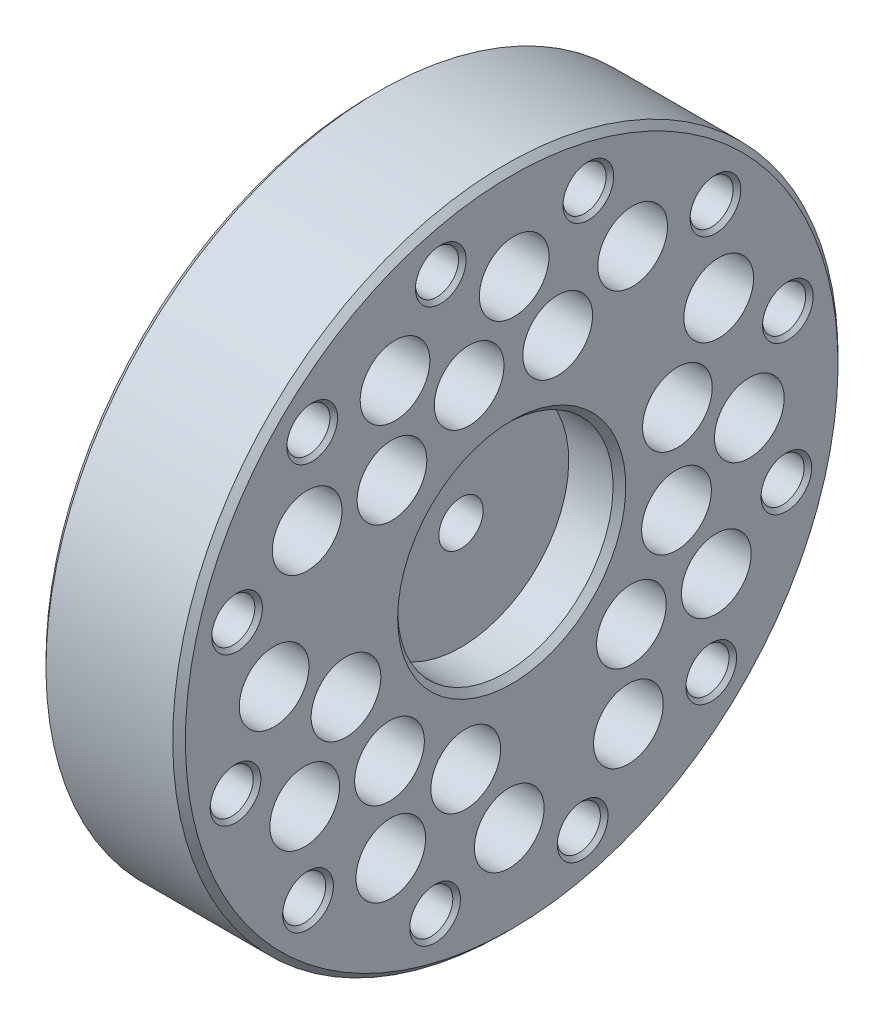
ISO-10303-21;
HEADER;
FILE_DESCRIPTION(('STEP AP214'),'2;1');
FILE_NAME('part.step','',(''),(''),'','','');
FILE_SCHEMA(('AUTOMOTIVE_DESIGN { 1 0 10303 214 1 1 1 1 }'));
ENDSEC;
DATA;
#1=APPLICATION_CONTEXT('core data for automotive mechanical design processes');
#2=APPLICATION_PROTOCOL_DEFINITION('international standard','automotive_design',2000,#1);
#3=PRODUCT_CONTEXT('',#1,'mechanical');
#4=PRODUCT('Part','Part','',(#3));
#5=PRODUCT_RELATED_PRODUCT_CATEGORY('part','',(#4));
#6=PRODUCT_DEFINITION_FORMATION('','',#4);
#7=PRODUCT_DEFINITION_CONTEXT('part definition',#1,'design');
#8=PRODUCT_DEFINITION('design','',#6,#7);
#9=PRODUCT_DEFINITION_SHAPE('','',#8);
#10=(LENGTH_UNIT() NAMED_UNIT(*) SI_UNIT(.MILLI.,.METRE.));
#11=(NAMED_UNIT(*) PLANE_ANGLE_UNIT() SI_UNIT($,.RADIAN.));
#12=(NAMED_UNIT(*) SI_UNIT($,.STERADIAN.) SOLID_ANGLE_UNIT());
#13=UNCERTAINTY_MEASURE_WITH_UNIT(LENGTH_MEASURE(1.E-05),#10,'distance_accuracy_value','');
#14=(GEOMETRIC_REPRESENTATION_CONTEXT(3) GLOBAL_UNCERTAINTY_ASSIGNED_CONTEXT((#13)) GLOBAL_UNIT_ASSIGNED_CONTEXT((#10,
#11,#12)) REPRESENTATION_CONTEXT('',''));
#15=CARTESIAN_POINT('',(0.,0.,0.));
#16=DIRECTION('',(0.,0.,1.));
#17=DIRECTION('',(1.,0.,0.));
#18=AXIS2_PLACEMENT_3D('',#15,#16,#17);
#19=CARTESIAN_POINT('',(-16.7500000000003,15.4111731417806,-4.30066766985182));
#20=DIRECTION('',(-1.,0.,0.));
#21=DIRECTION('',(0.,0.963198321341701,-0.268791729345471));
#22=AXIS2_PLACEMENT_3D('',#19,#20,#21);
#23=PLANE('',#22);
#24=CARTESIAN_POINT('',(-16.7500000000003,1.11022302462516E-13,0.));
#25=DIRECTION('',(-1.,0.,0.));
#26=DIRECTION('',(0.,0.714379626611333,0.699758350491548));
#27=AXIS2_PLACEMENT_3D('',#24,#25,#26);
#28=CIRCLE('',#27,51.5000000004);
#29=CARTESIAN_POINT('',(-16.7500000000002,36.7905507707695,36.0375550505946));
#30=VERTEX_POINT('',#29);
#31=EDGE_CURVE('E668',#30,#30,#28,.T.);
#32=ORIENTED_EDGE('',*,*,#31,.T.);
#33=EDGE_LOOP('',(#32));
#34=FACE_BOUND('',#33,.T.);
#35=CARTESIAN_POINT('',(-16.7500000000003,1.11022302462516E-13,0.));
#36=DIRECTION('',(-1.,0.,0.));
#37=DIRECTION('',(0.,0.714379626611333,0.699758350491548));
#38=AXIS2_PLACEMENT_3D('',#35,#36,#37);
#39=CIRCLE('',#38,47.9999999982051);
#40=CARTESIAN_POINT('',(-16.7500000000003,34.2902220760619,33.5884008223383));
#41=VERTEX_POINT('',#40);
#42=EDGE_CURVE('E664',#41,#41,#39,.F.);
#43=ORIENTED_EDGE('',*,*,#42,.T.);
#44=EDGE_LOOP('',(#43));
#45=FACE_BOUND('',#44,.T.);
#46=ADVANCED_FACE('F17',(#34,#45),#23,.T.);
#47=CARTESIAN_POINT('',(2.24999999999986,1.11022302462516E-13,0.));
#48=DIRECTION('',(-1.,0.,0.));
#49=DIRECTION('',(0.,-0.714379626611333,-0.699758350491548));
#50=AXIS2_PLACEMENT_3D('',#47,#48,#49);
#51=CYLINDRICAL_SURFACE('',#50,52.5);
#52=CARTESIAN_POINT('',(4.24999999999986,1.11022302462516E-13,0.));
#53=DIRECTION('',(-1.,0.,0.));
#54=DIRECTION('',(0.,0.714379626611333,0.699758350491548));
#55=AXIS2_PLACEMENT_3D('',#52,#53,#54);
#56=CIRCLE('',#55,52.5);
#57=CARTESIAN_POINT('',(4.24999999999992,37.5049303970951,36.7373134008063));
#58=VERTEX_POINT('',#57);
#59=EDGE_CURVE('E127',#58,#58,#56,.T.);
#60=ORIENTED_EDGE('',*,*,#59,.T.);
#61=EDGE_LOOP('',(#60));
#62=FACE_BOUND('',#61,.T.);
#63=CARTESIAN_POINT('',(-15.75,1.11022302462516E-13,0.));
#64=DIRECTION('',(1.,0.,0.));
#65=DIRECTION('',(0.,0.714379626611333,0.699758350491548));
#66=AXIS2_PLACEMENT_3D('',#63,#64,#65);
#67=CIRCLE('',#66,52.5);
#68=CARTESIAN_POINT('',(-15.7499999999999,37.5049303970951,36.7373134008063));
#69=VERTEX_POINT('',#68);
#70=EDGE_CURVE('E669',#69,#69,#67,.T.);
#71=ORIENTED_EDGE('',*,*,#70,.T.);
#72=EDGE_LOOP('',(#71));
#73=FACE_BOUND('',#72,.T.);
#74=ADVANCED_FACE('F784',(#62,#73),#51,.T.);
#75=CARTESIAN_POINT('',(-12.7500000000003,15.4111731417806,-4.30066766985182));
#76=DIRECTION('',(-1.,0.,0.));
#77=DIRECTION('',(0.,0.963198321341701,-0.268791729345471));
#78=AXIS2_PLACEMENT_3D('',#75,#76,#77);
#79=PLANE('',#78);
#80=CARTESIAN_POINT('',(-12.7500000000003,1.11022302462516E-13,0.));
#81=DIRECTION('',(-1.,0.,0.));
#82=DIRECTION('',(0.,0.714379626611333,0.699758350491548));
#83=AXIS2_PLACEMENT_3D('',#80,#81,#82);
#84=CIRCLE('',#83,3.5);
#85=CARTESIAN_POINT('',(-12.7500000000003,2.50032869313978,2.44915422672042));
#86=VERTEX_POINT('',#85);
#87=EDGE_CURVE('E11',#86,#86,#84,.T.);
#88=ORIENTED_EDGE('',*,*,#87,.F.);
#89=EDGE_LOOP('',(#88));
#90=FACE_BOUND('',#89,.T.);
#91=CARTESIAN_POINT('',(-12.7500000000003,1.11022302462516E-13,0.));
#92=DIRECTION('',(-1.,0.,0.));
#93=DIRECTION('',(0.,0.714379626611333,0.699758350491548));
#94=AXIS2_PLACEMENT_3D('',#91,#92,#93);
#95=CIRCLE('',#94,47.);
#96=CARTESIAN_POINT('',(-12.7500000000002,33.5758424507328,32.8886424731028));
#97=VERTEX_POINT('',#96);
#98=EDGE_CURVE('E119',#97,#97,#95,.T.);
#99=ORIENTED_EDGE('',*,*,#98,.T.);
#100=EDGE_LOOP('',(#99));
#101=FACE_BOUND('',#100,.T.);
#102=CARTESIAN_POINT('',(-12.7500000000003,-16.3931538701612,21.7374030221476));
#103=CARTESIAN_POINT('',(-12.7500000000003,-16.6496860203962,21.999295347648));
#104=CARTESIAN_POINT('',(-12.7500000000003,-16.9405071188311,22.2275998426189));
#105=CARTESIAN_POINT('',(-12.7500000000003,-17.259782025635,22.4163347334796));
#106=CARTESIAN_POINT('',(-12.7500000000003,-17.9402346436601,22.7057936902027));
#107=CARTESIAN_POINT('',(-12.7500000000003,-18.6722690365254,22.8103166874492));
#108=CARTESIAN_POINT('',(-12.7500000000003,-19.0431371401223,22.8140823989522));
#109=CARTESIAN_POINT('',(-12.7500000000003,-19.7771447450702,22.7244437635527));
#110=CARTESIAN_POINT('',(-12.7500000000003,-20.463332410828,22.4488609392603));
#111=CARTESIAN_POINT('',(-12.7500000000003,-20.7863738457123,22.2666479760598));
#112=CARTESIAN_POINT('',(-12.7500000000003,-21.3771685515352,21.8219414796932));
#113=CARTESIAN_POINT('',(-12.7500000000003,-21.8335608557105,21.2401292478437));
#114=CARTESIAN_POINT('',(-12.7500000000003,-22.0221768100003,20.9207840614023));
#115=CARTESIAN_POINT('',(-12.7500000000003,-22.3113822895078,20.2402236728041));
#116=CARTESIAN_POINT('',(-12.7500000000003,-22.415632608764,19.5081503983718));
#117=CARTESIAN_POINT('',(-12.7500000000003,-22.419260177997,19.1372809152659));
#118=CARTESIAN_POINT('',(-12.7500000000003,-22.3294120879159,18.4038287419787));
#119=CARTESIAN_POINT('',(-12.7500000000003,-22.0539019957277,17.7181976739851));
#120=CARTESIAN_POINT('',(-12.7500000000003,-21.8719543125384,17.3956265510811));
#121=CARTESIAN_POINT('',(-12.7500000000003,-21.6499785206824,17.1006143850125));
#122=CARTESIAN_POINT('',(-12.7500000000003,-21.3938112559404,16.8390945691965));
#123=B_SPLINE_CURVE_WITH_KNOTS('',5,(#102,#103,#104,#105,#106,#107,#108,#109,#110,#111,#112,
#113,#114,#115,#116,#117,#118,#119,#120,#121,#122),.UNSPECIFIED.,.F.,.F.,(6,3,3,3,3,3,6),(0.,
0.166706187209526,0.333412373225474,0.500118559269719,0.666824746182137,0.833530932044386,1.),.UNSPECIFIED.);
#124=CARTESIAN_POINT('',(-12.7500000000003,-16.3931538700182,21.7374030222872));
#125=VERTEX_POINT('',#124);
#126=CARTESIAN_POINT('',(-12.7500000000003,-21.3938112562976,16.8390945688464));
#127=VERTEX_POINT('',#126);
#128=EDGE_CURVE('E112',#125,#127,#123,.T.);
#129=ORIENTED_EDGE('',*,*,#128,.T.);
#130=CARTESIAN_POINT('',(-12.7500000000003,-21.3938112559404,16.8390945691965));
#131=CARTESIAN_POINT('',(-12.7500000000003,-21.1372791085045,16.5772022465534));
#132=CARTESIAN_POINT('',(-12.7500000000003,-20.846458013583,16.3488977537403));
#133=CARTESIAN_POINT('',(-12.7500000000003,-20.5271830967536,16.1601628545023));
#134=CARTESIAN_POINT('',(-12.7500000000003,-19.8467304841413,15.8707039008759));
#135=CARTESIAN_POINT('',(-12.7500000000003,-19.114696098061,15.7661809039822));
#136=CARTESIAN_POINT('',(-12.7500000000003,-18.7438279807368,15.7624151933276));
#137=CARTESIAN_POINT('',(-12.7500000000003,-18.0098203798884,15.8520538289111));
#138=CARTESIAN_POINT('',(-12.7500000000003,-17.3236327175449,16.1276366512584));
#139=CARTESIAN_POINT('',(-12.7500000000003,-17.0005912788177,16.3098496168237));
#140=CARTESIAN_POINT('',(-12.7500000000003,-16.4097965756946,16.7545561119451));
#141=CARTESIAN_POINT('',(-12.7500000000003,-15.9534042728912,17.3363683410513));
#142=CARTESIAN_POINT('',(-12.7500000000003,-15.7647883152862,17.6557135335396));
#143=CARTESIAN_POINT('',(-12.7500000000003,-15.4755828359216,18.3362739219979));
#144=CARTESIAN_POINT('',(-12.7500000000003,-15.3713325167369,19.0683471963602));
#145=CARTESIAN_POINT('',(-12.7500000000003,-15.3677049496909,19.4392166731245));
#146=CARTESIAN_POINT('',(-12.7500000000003,-15.4575530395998,20.1726688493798));
#147=CARTESIAN_POINT('',(-12.7500000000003,-15.7330631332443,20.8582999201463));
#148=CARTESIAN_POINT('',(-12.7500000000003,-15.915010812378,21.1808710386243));
#149=CARTESIAN_POINT('',(-12.7500000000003,-16.1369866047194,21.475883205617));
#150=CARTESIAN_POINT('',(-12.7500000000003,-16.3931538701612,21.7374030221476));
#151=B_SPLINE_CURVE_WITH_KNOTS('',5,(#130,#131,#132,#133,#134,#135,#136,#137,#138,#139,#140,
#141,#142,#143,#144,#145,#146,#147,#148,#149,#150),.UNSPECIFIED.,.F.,.F.,(6,3,3,3,3,3,6),(0.,
0.166706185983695,0.333412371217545,0.50011855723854,0.666824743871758,0.83353093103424,1.),.UNSPECIFIED.);
#152=EDGE_CURVE('E108',#127,#125,#151,.T.);
#153=ORIENTED_EDGE('',*,*,#152,.T.);
#154=EDGE_LOOP('',(#129,#153));
#155=FACE_BOUND('',#154,.T.);
#156=CARTESIAN_POINT('',(-12.7500000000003,-4.75704732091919,-23.5571997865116));
#157=CARTESIAN_POINT('',(-12.7500000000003,-5.01357946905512,-23.2953074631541));
#158=CARTESIAN_POINT('',(-12.7500000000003,-5.30440056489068,-23.0670029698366));
#159=CARTESIAN_POINT('',(-12.7500000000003,-5.6236754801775,-22.8782680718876));
#160=CARTESIAN_POINT('',(-12.7500000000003,-6.304128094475,-22.5888091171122));
#161=CARTESIAN_POINT('',(-12.7500000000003,-7.03616248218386,-22.4842861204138));
#162=CARTESIAN_POINT('',(-12.7500000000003,-7.40703059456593,-22.4805204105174));
#163=CARTESIAN_POINT('',(-12.7500000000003,-8.14103819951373,-22.5701590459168));
#164=CARTESIAN_POINT('',(-12.7500000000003,-8.82722586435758,-22.8457418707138));
#165=CARTESIAN_POINT('',(-12.7500000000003,-9.15026729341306,-23.0279548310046));
#166=CARTESIAN_POINT('',(-12.7500000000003,-9.74106199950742,-23.4726613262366));
#167=CARTESIAN_POINT('',(-12.7500000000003,-10.1974543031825,-24.0544735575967));
#168=CARTESIAN_POINT('',(-12.7500000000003,-10.3860702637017,-24.3738187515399));
#169=CARTESIAN_POINT('',(-12.7500000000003,-10.6752757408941,-25.0543791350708));
#170=CARTESIAN_POINT('',(-12.7500000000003,-10.7795260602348,-25.7864524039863));
#171=CARTESIAN_POINT('',(-12.7500000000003,-10.7831536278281,-26.1573218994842));
#172=CARTESIAN_POINT('',(-12.7500000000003,-10.6933055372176,-26.8907740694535));
#173=CARTESIAN_POINT('',(-12.7500000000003,-10.4177954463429,-27.5764051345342));
#174=CARTESIAN_POINT('',(-12.7500000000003,-10.2358477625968,-27.8989762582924));
#175=CARTESIAN_POINT('',(-12.7500000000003,-10.0138719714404,-28.1939884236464));
#176=CARTESIAN_POINT('',(-12.7500000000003,-9.75770470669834,-28.4555082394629));
#177=B_SPLINE_CURVE_WITH_KNOTS('',5,(#156,#157,#158,#159,#160,#161,#162,#163,#164,#165,#166,
#167,#168,#169,#170,#171,#172,#173,#174,#175,#176),.UNSPECIFIED.,.F.,.F.,(6,3,3,3,3,3,6),(0.,
0.166706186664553,0.333412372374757,0.500118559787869,0.666824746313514,0.833530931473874,1.),.UNSPECIFIED.);
#178=CARTESIAN_POINT('',(-12.7500000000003,-4.75704732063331,-23.5571997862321));
#179=VERTEX_POINT('',#178);
#180=CARTESIAN_POINT('',(-12.7500000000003,-9.75770470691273,-28.4555082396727));
#181=VERTEX_POINT('',#180);
#182=EDGE_CURVE('E115',#179,#181,#177,.T.);
#183=ORIENTED_EDGE('',*,*,#182,.T.);
#184=CARTESIAN_POINT('',(-12.7500000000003,-9.75770470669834,-28.4555082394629));
#185=CARTESIAN_POINT('',(-12.7500000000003,-9.50117255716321,-28.7174005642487));
#186=CARTESIAN_POINT('',(-12.7500000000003,-9.21035146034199,-28.9457050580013));
#187=CARTESIAN_POINT('',(-12.7500000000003,-8.89107655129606,-29.134439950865));
#188=CARTESIAN_POINT('',(-12.7500000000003,-8.21062393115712,-29.4238989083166));
#189=CARTESIAN_POINT('',(-12.7500000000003,-7.47858953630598,-29.5284219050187));
#190=CARTESIAN_POINT('',(-12.7500000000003,-7.10772144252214,-29.5321876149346));
#191=CARTESIAN_POINT('',(-12.7500000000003,-6.37371383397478,-29.4425489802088));
#192=CARTESIAN_POINT('',(-12.7500000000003,-5.68752616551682,-29.1669661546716));
#193=CARTESIAN_POINT('',(-12.7500000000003,-5.36448473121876,-28.9847531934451));
#194=CARTESIAN_POINT('',(-12.7500000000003,-4.7736900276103,-28.5400466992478));
#195=CARTESIAN_POINT('',(-12.7500000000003,-4.31729772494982,-27.9582344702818));
#196=CARTESIAN_POINT('',(-12.7500000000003,-4.1286817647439,-27.6388892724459));
#197=CARTESIAN_POINT('',(-12.7500000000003,-3.83947628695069,-26.9583288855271));
#198=CARTESIAN_POINT('',(-12.7500000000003,-3.73522596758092,-26.2262556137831));
#199=CARTESIAN_POINT('',(-12.7500000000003,-3.73159840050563,-25.8553861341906));
#200=CARTESIAN_POINT('',(-12.7500000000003,-3.82144649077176,-25.1219339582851));
#201=CARTESIAN_POINT('',(-12.7500000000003,-4.09695658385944,-24.4363028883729));
#202=CARTESIAN_POINT('',(-12.7500000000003,-4.27890426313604,-24.1137317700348));
#203=CARTESIAN_POINT('',(-12.7500000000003,-4.50088005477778,-23.8187196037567));
#204=CARTESIAN_POINT('',(-12.7500000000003,-4.75704732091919,-23.5571997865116));
#205=B_SPLINE_CURVE_WITH_KNOTS('',5,(#184,#185,#186,#187,#188,#189,#190,#191,#192,#193,#194,
#195,#196,#197,#198,#199,#200,#201,#202,#203,#204),.UNSPECIFIED.,.F.,.F.,(6,3,3,3,3,3,6),(0.,
0.166706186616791,0.333412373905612,0.500118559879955,0.666824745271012,0.833530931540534,1.),.UNSPECIFIED.);
#206=EDGE_CURVE('E146',#181,#179,#205,.T.);
#207=ORIENTED_EDGE('',*,*,#206,.T.);
#208=EDGE_LOOP('',(#183,#207));
#209=FACE_BOUND('',#208,.T.);
#210=CARTESIAN_POINT('',(-12.7500000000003,28.6511806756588,9.1672628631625));
#211=CARTESIAN_POINT('',(-12.7500000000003,28.3946485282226,9.42915518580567));
#212=CARTESIAN_POINT('',(-12.7500000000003,28.1038274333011,9.65745967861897));
#213=CARTESIAN_POINT('',(-12.7500000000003,27.7845525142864,9.84619457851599));
#214=CARTESIAN_POINT('',(-12.7500000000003,27.1040999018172,10.1356535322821));
#215=CARTESIAN_POINT('',(-12.7500000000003,26.3720655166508,10.2401765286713));
#216=CARTESIAN_POINT('',(-12.7500000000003,26.0011974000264,10.2439422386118));
#217=CARTESIAN_POINT('',(-12.7500000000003,25.267189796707,10.1543036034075));
#218=CARTESIAN_POINT('',(-12.7500000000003,24.5810021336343,9.87872077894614));
#219=CARTESIAN_POINT('',(-12.7500000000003,24.2579607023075,9.69650781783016));
#220=CARTESIAN_POINT('',(-12.7500000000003,23.6671659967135,9.25180132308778));
#221=CARTESIAN_POINT('',(-12.7500000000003,23.2107736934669,8.66998909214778));
#222=CARTESIAN_POINT('',(-12.7500000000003,23.0221577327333,8.35064389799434));
#223=CARTESIAN_POINT('',(-12.7500000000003,22.7329522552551,7.67008351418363));
#224=CARTESIAN_POINT('',(-12.7500000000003,22.6287019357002,6.93801024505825));
#225=CARTESIAN_POINT('',(-12.7500000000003,22.6250743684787,6.56714075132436));
#226=CARTESIAN_POINT('',(-12.7500000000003,22.714922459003,5.83368857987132));
#227=CARTESIAN_POINT('',(-12.7500000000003,22.9904325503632,5.14805751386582));
#228=CARTESIAN_POINT('',(-12.7500000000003,23.1723802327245,4.82548639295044));
#229=CARTESIAN_POINT('',(-12.7500000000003,23.3943560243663,4.5304742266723));
#230=CARTESIAN_POINT('',(-12.7500000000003,23.650523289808,4.26895441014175));
#231=B_SPLINE_CURVE_WITH_KNOTS('',5,(#210,#211,#212,#213,#214,#215,#216,#217,#218,#219,#220,
#221,#222,#223,#224,#225,#226,#227,#228,#229,#230),.UNSPECIFIED.,.F.,.F.,(6,3,3,3,3,3,6),(0.,
0.166706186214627,0.333412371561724,0.500118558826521,0.666824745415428,0.833530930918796,1.),.UNSPECIFIED.);
#232=CARTESIAN_POINT('',(-12.7500000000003,28.6511806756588,9.1672628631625));
#233=VERTEX_POINT('',#232);
#234=CARTESIAN_POINT('',(-12.7500000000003,23.6505232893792,4.26895440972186));
#235=VERTEX_POINT('',#234);
#236=EDGE_CURVE('E154',#233,#235,#231,.T.);
#237=ORIENTED_EDGE('',*,*,#236,.T.);
#238=CARTESIAN_POINT('',(-12.7500000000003,23.650523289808,4.26895441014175));
#239=CARTESIAN_POINT('',(-12.7500000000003,23.9070554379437,4.00706208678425));
#240=CARTESIAN_POINT('',(-12.7500000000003,24.1978765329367,3.77875759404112));
#241=CARTESIAN_POINT('',(-12.7500000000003,24.5171514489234,3.59002269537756));
#242=CARTESIAN_POINT('',(-12.7500000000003,25.1976040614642,3.30056374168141));
#243=CARTESIAN_POINT('',(-12.7500000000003,25.9296384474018,3.19604074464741));
#244=CARTESIAN_POINT('',(-12.7500000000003,26.3005065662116,3.19227503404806));
#245=CARTESIAN_POINT('',(-12.7500000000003,27.0345141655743,3.28191366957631));
#246=CARTESIAN_POINT('',(-12.7500000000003,27.7207018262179,3.55749649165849));
#247=CARTESIAN_POINT('',(-12.7500000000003,28.0437432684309,3.73970945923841));
#248=CARTESIAN_POINT('',(-12.7500000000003,28.634537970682,4.18441595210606));
#249=CARTESIAN_POINT('',(-12.7500000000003,29.0909302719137,4.76622817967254));
#250=CARTESIAN_POINT('',(-12.7500000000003,29.2795462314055,5.08557337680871));
#251=CARTESIAN_POINT('',(-12.7500000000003,29.5687517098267,5.76613376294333));
#252=CARTESIAN_POINT('',(-12.7500000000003,29.673002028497,6.49820703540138));
#253=CARTESIAN_POINT('',(-12.7500000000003,29.6766295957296,6.869076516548));
#254=CARTESIAN_POINT('',(-12.7500000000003,29.5867815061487,7.60252869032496));
#255=CARTESIAN_POINT('',(-12.7500000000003,29.311271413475,8.28815975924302));
#256=CARTESIAN_POINT('',(-12.7500000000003,29.1293237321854,8.61073088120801));
#257=CARTESIAN_POINT('',(-12.7500000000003,28.9073479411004,8.90574304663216));
#258=CARTESIAN_POINT('',(-12.7500000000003,28.6511806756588,9.1672628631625));
#259=B_SPLINE_CURVE_WITH_KNOTS('',5,(#238,#239,#240,#241,#242,#243,#244,#245,#246,#247,#248,
#249,#250,#251,#252,#253,#254,#255,#256,#257,#258),.UNSPECIFIED.,.F.,.F.,(6,3,3,3,3,3,6),(0.,
0.166706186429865,0.333412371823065,0.500118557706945,0.666824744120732,0.833530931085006,1.),.UNSPECIFIED.);
#260=EDGE_CURVE('E163',#235,#233,#259,.T.);
#261=ORIENTED_EDGE('',*,*,#260,.T.);
#262=EDGE_LOOP('',(#237,#261));
#263=FACE_BOUND('',#262,.T.);
#264=CARTESIAN_POINT('',(-12.7500000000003,-6.71810475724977,26.1508521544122));
#265=DIRECTION('',(-1.,0.,0.));
#266=DIRECTION('',(0.,0.714379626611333,0.699758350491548));
#267=AXIS2_PLACEMENT_3D('',#264,#265,#266);
#268=CIRCLE('',#267,3.49999999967);
#269=CARTESIAN_POINT('',(-12.7500000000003,-4.21777606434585,28.6000063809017));
#270=VERTEX_POINT('',#269);
#271=EDGE_CURVE('E171',#270,#270,#268,.T.);
#272=ORIENTED_EDGE('',*,*,#271,.F.);
#273=EDGE_LOOP('',(#272));
#274=FACE_BOUND('',#273,.T.);
#275=CARTESIAN_POINT('',(-12.7500000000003,19.2882499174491,18.8934754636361));
#276=DIRECTION('',(-1.,0.,0.));
#277=DIRECTION('',(0.,0.714379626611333,0.699758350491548));
#278=AXIS2_PLACEMENT_3D('',#275,#276,#277);
#279=CIRCLE('',#278,3.49999999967);
#280=CARTESIAN_POINT('',(-12.7500000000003,21.7885786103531,21.3426296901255));
#281=VERTEX_POINT('',#280);
#282=EDGE_CURVE('E177',#281,#281,#279,.T.);
#283=ORIENTED_EDGE('',*,*,#282,.F.);
#284=EDGE_LOOP('',(#283));
#285=FACE_BOUND('',#284,.T.);
#286=CARTESIAN_POINT('',(-12.7500000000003,26.0063546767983,-7.25737669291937));
#287=DIRECTION('',(-1.,0.,0.));
#288=DIRECTION('',(0.,0.714379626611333,0.699758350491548));
#289=AXIS2_PLACEMENT_3D('',#286,#287,#288);
#290=CIRCLE('',#289,3.49999999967);
#291=CARTESIAN_POINT('',(-12.7500000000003,28.5066833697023,-4.80822246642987));
#292=VERTEX_POINT('',#291);
#293=EDGE_CURVE('E182',#292,#292,#290,.T.);
#294=ORIENTED_EDGE('',*,*,#293,.F.);
#295=EDGE_LOOP('',(#294));
#296=FACE_BOUND('',#295,.T.);
#297=CARTESIAN_POINT('',(-12.7500000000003,6.71810475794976,-26.150852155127));
#298=DIRECTION('',(-1.,0.,0.));
#299=DIRECTION('',(0.,0.714379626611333,0.699758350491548));
#300=AXIS2_PLACEMENT_3D('',#297,#298,#299);
#301=CIRCLE('',#300,3.49999999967);
#302=CARTESIAN_POINT('',(-12.7500000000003,9.21843345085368,-23.7016979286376));
#303=VERTEX_POINT('',#302);
#304=EDGE_CURVE('E186',#303,#303,#301,.T.);
#305=ORIENTED_EDGE('',*,*,#304,.F.);
#306=EDGE_LOOP('',(#305));
#307=FACE_BOUND('',#306,.T.);
#308=CARTESIAN_POINT('',(-12.7500000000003,-19.2882499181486,-18.8934754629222));
#309=DIRECTION('',(-1.,0.,0.));
#310=DIRECTION('',(0.,0.714379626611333,0.699758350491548));
#311=AXIS2_PLACEMENT_3D('',#308,#309,#310);
#312=CIRCLE('',#311,3.49999999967);
#313=CARTESIAN_POINT('',(-12.7500000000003,-16.7879212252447,-16.4443212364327));
#314=VERTEX_POINT('',#313);
#315=EDGE_CURVE('E190',#314,#314,#312,.T.);
#316=ORIENTED_EDGE('',*,*,#315,.F.);
#317=EDGE_LOOP('',(#316));
#318=FACE_BOUND('',#317,.T.);
#319=CARTESIAN_POINT('',(-12.7500000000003,0.3877051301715,37.4979957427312));
#320=DIRECTION('',(-1.,0.,0.));
#321=DIRECTION('',(0.,0.714379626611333,0.699758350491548));
#322=AXIS2_PLACEMENT_3D('',#319,#320,#321);
#323=CIRCLE('',#322,3.49999999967);
#324=CARTESIAN_POINT('',(-12.7500000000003,2.88803382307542,39.9471499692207));
#325=VERTEX_POINT('',#324);
#326=EDGE_CURVE('E195',#325,#325,#323,.T.);
#327=ORIENTED_EDGE('',*,*,#326,.F.);
#328=EDGE_LOOP('',(#327));
#329=FACE_BOUND('',#328,.T.);
#330=CARTESIAN_POINT('',(-12.7500000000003,19.0847603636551,32.2803643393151));
#331=DIRECTION('',(-1.,0.,0.));
#332=DIRECTION('',(0.,0.714379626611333,0.699758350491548));
#333=AXIS2_PLACEMENT_3D('',#330,#331,#332);
#334=CIRCLE('',#333,3.50000000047);
#335=CARTESIAN_POINT('',(-12.7500000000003,21.5850890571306,34.7295185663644));
#336=VERTEX_POINT('',#335);
#337=EDGE_CURVE('E199',#336,#336,#334,.T.);
#338=ORIENTED_EDGE('',*,*,#337,.F.);
#339=EDGE_LOOP('',(#338));
#340=FACE_BOUND('',#339,.T.);
#341=CARTESIAN_POINT('',(-12.7500000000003,32.6680694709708,18.4132353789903));
#342=DIRECTION('',(-1.,0.,0.));
#343=DIRECTION('',(0.,0.714379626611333,0.699758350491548));
#344=AXIS2_PLACEMENT_3D('',#341,#342,#343);
#345=CIRCLE('',#344,3.49999999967);
#346=CARTESIAN_POINT('',(-12.7500000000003,35.1683981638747,20.8623896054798));
#347=VERTEX_POINT('',#346);
#348=EDGE_CURVE('E204',#347,#347,#345,.T.);
#349=ORIENTED_EDGE('',*,*,#348,.F.);
#350=EDGE_LOOP('',(#349));
#351=FACE_BOUND('',#350,.T.);
#352=CARTESIAN_POINT('',(-12.7500000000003,37.4979957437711,-0.387705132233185));
#353=DIRECTION('',(-1.,0.,0.));
#354=DIRECTION('',(0.,0.714379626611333,0.699758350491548));
#355=AXIS2_PLACEMENT_3D('',#352,#353,#354);
#356=CIRCLE('',#355,3.50000000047);
#357=CARTESIAN_POINT('',(-12.7500000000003,39.9983244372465,2.06144909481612));
#358=VERTEX_POINT('',#357);
#359=EDGE_CURVE('E209',#358,#358,#356,.T.);
#360=ORIENTED_EDGE('',*,*,#359,.F.);
#361=EDGE_LOOP('',(#360));
#362=FACE_BOUND('',#361,.T.);
#363=CARTESIAN_POINT('',(-12.7500000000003,32.2803643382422,-19.0847603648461));
#364=DIRECTION('',(-1.,0.,0.));
#365=DIRECTION('',(0.,0.714379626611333,0.699758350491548));
#366=AXIS2_PLACEMENT_3D('',#363,#364,#365);
#367=CIRCLE('',#366,3.49999999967);
#368=CARTESIAN_POINT('',(-12.7500000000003,34.7806930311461,-16.6356061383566));
#369=VERTEX_POINT('',#368);
#370=EDGE_CURVE('E214',#369,#369,#367,.T.);
#371=ORIENTED_EDGE('',*,*,#370,.F.);
#372=EDGE_LOOP('',(#371));
#373=FACE_BOUND('',#372,.T.);
#374=CARTESIAN_POINT('',(-12.7500000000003,18.4132353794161,-32.6680694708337));
#375=DIRECTION('',(-1.,0.,0.));
#376=DIRECTION('',(0.,0.714379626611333,0.699758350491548));
#377=AXIS2_PLACEMENT_3D('',#374,#375,#376);
#378=CIRCLE('',#377,3.49999999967);
#379=CARTESIAN_POINT('',(-12.7500000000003,20.91356407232,-30.2189152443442));
#380=VERTEX_POINT('',#379);
#381=EDGE_CURVE('E218',#380,#380,#378,.T.);
#382=ORIENTED_EDGE('',*,*,#381,.F.);
#383=EDGE_LOOP('',(#382));
#384=FACE_BOUND('',#383,.T.);
#385=CARTESIAN_POINT('',(-12.7500000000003,-0.387705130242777,-37.4979957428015));
#386=DIRECTION('',(-1.,0.,0.));
#387=DIRECTION('',(0.,0.714379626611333,0.699758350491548));
#388=AXIS2_PLACEMENT_3D('',#385,#386,#387);
#389=CIRCLE('',#388,3.50000000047);
#390=CARTESIAN_POINT('',(-12.7500000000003,2.11262356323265,-35.0488415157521));
#391=VERTEX_POINT('',#390);
#392=EDGE_CURVE('E223',#391,#391,#389,.T.);
#393=ORIENTED_EDGE('',*,*,#392,.F.);
#394=EDGE_LOOP('',(#393));
#395=FACE_BOUND('',#394,.T.);
#396=CARTESIAN_POINT('',(-12.7500000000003,-19.0847603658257,-32.2803643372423));
#397=DIRECTION('',(-1.,0.,0.));
#398=DIRECTION('',(0.,0.714379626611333,0.699758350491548));
#399=AXIS2_PLACEMENT_3D('',#396,#397,#398);
#400=CIRCLE('',#399,3.49999999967);
#401=CARTESIAN_POINT('',(-12.7500000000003,-16.5844316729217,-29.8312101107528));
#402=VERTEX_POINT('',#401);
#403=EDGE_CURVE('E227',#402,#402,#400,.T.);
#404=ORIENTED_EDGE('',*,*,#403,.F.);
#405=EDGE_LOOP('',(#404));
#406=FACE_BOUND('',#405,.T.);
#407=CARTESIAN_POINT('',(-12.7500000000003,-32.6680694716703,-18.413235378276));
#408=DIRECTION('',(-1.,0.,0.));
#409=DIRECTION('',(0.,0.714379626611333,0.699758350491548));
#410=AXIS2_PLACEMENT_3D('',#407,#408,#409);
#411=CIRCLE('',#410,3.49999999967);
#412=CARTESIAN_POINT('',(-12.7500000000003,-30.1677407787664,-15.9640811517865));
#413=VERTEX_POINT('',#412);
#414=EDGE_CURVE('E231',#413,#413,#411,.T.);
#415=ORIENTED_EDGE('',*,*,#414,.F.);
#416=EDGE_LOOP('',(#415));
#417=FACE_BOUND('',#416,.T.);
#418=CARTESIAN_POINT('',(-12.7500000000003,-37.4979957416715,0.387705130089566));
#419=DIRECTION('',(-1.,0.,0.));
#420=DIRECTION('',(0.,0.714379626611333,0.699758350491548));
#421=AXIS2_PLACEMENT_3D('',#418,#419,#420);
#422=CIRCLE('',#421,3.50000000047);
#423=CARTESIAN_POINT('',(-12.7500000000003,-34.997667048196,2.83685935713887));
#424=VERTEX_POINT('',#423);
#425=EDGE_CURVE('E236',#424,#424,#422,.T.);
#426=ORIENTED_EDGE('',*,*,#425,.F.);
#427=EDGE_LOOP('',(#426));
#428=FACE_BOUND('',#427,.T.);
#429=CARTESIAN_POINT('',(-12.7500000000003,-32.280364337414,19.0847603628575));
#430=DIRECTION('',(-1.,0.,0.));
#431=DIRECTION('',(0.,0.714379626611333,0.699758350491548));
#432=AXIS2_PLACEMENT_3D('',#429,#430,#431);
#433=CIRCLE('',#432,3.50000000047);
#434=CARTESIAN_POINT('',(-12.7500000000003,-29.7800356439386,21.5339145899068));
#435=VERTEX_POINT('',#434);
#436=EDGE_CURVE('E241',#435,#435,#433,.T.);
#437=ORIENTED_EDGE('',*,*,#436,.F.);
#438=EDGE_LOOP('',(#437));
#439=FACE_BOUND('',#438,.T.);
#440=CARTESIAN_POINT('',(-12.7500000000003,-26.0063546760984,7.25737669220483));
#441=DIRECTION('',(-1.,0.,0.));
#442=DIRECTION('',(0.,0.714379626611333,0.699758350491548));
#443=AXIS2_PLACEMENT_3D('',#440,#441,#442);
#444=CIRCLE('',#443,3.49999999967);
#445=CARTESIAN_POINT('',(-12.7500000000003,-23.5060259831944,9.70653091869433));
#446=VERTEX_POINT('',#445);
#447=EDGE_CURVE('E245',#446,#446,#444,.T.);
#448=ORIENTED_EDGE('',*,*,#447,.F.);
#449=EDGE_LOOP('',(#448));
#450=FACE_BOUND('',#449,.T.);
#451=CARTESIAN_POINT('',(-12.7500000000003,-18.4132353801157,32.668069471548));
#452=DIRECTION('',(-1.,0.,0.));
#453=DIRECTION('',(0.,0.714379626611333,0.699758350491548));
#454=AXIS2_PLACEMENT_3D('',#451,#452,#453);
#455=CIRCLE('',#454,3.49999999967);
#456=CARTESIAN_POINT('',(-12.7500000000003,-15.9129066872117,35.1172236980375));
#457=VERTEX_POINT('',#456);
#458=EDGE_CURVE('E249',#457,#457,#455,.T.);
#459=ORIENTED_EDGE('',*,*,#458,.F.);
#460=EDGE_LOOP('',(#459));
#461=FACE_BOUND('',#460,.T.);
#462=ADVANCED_FACE('F110',(#90,#101,#155,#209,#263,#274,#285,#296,#307,#318,#329,#340,#351,#362,
#373,#384,#395,#406,#417,#428,#439,#450,#461),#79,.T.);
#463=CARTESIAN_POINT('',(2.24999999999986,-6.71810475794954,26.1508521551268));
#464=DIRECTION('',(-1.,0.,0.));
#465=DIRECTION('',(0.,-0.714379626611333,-0.699758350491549));
#466=AXIS2_PLACEMENT_3D('',#463,#464,#465);
#467=CYLINDRICAL_SURFACE('',#466,3.5);
#468=CARTESIAN_POINT('',(-2.75,-6.71810475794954,26.1508521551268));
#469=DIRECTION('',(-1.,0.,0.));
#470=DIRECTION('',(0.,0.714379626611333,0.699758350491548));
#471=AXIS2_PLACEMENT_3D('',#468,#469,#470);
#472=CIRCLE('',#471,3.5);
#473=CARTESIAN_POINT('',(-2.75,-4.21777606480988,28.6000063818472));
#474=VERTEX_POINT('',#473);
#475=EDGE_CURVE('E254',#474,#474,#472,.T.);
#476=ORIENTED_EDGE('',*,*,#475,.F.);
#477=EDGE_LOOP('',(#476));
#478=FACE_BOUND('',#477,.T.);
#479=ORIENTED_EDGE('',*,*,#271,.T.);
#480=EDGE_LOOP('',(#479));
#481=FACE_BOUND('',#480,.T.);
#482=ADVANCED_FACE('F797',(#478,#481),#467,.F.);
#483=CARTESIAN_POINT('',(2.24999999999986,19.2882499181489,18.893475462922));
#484=DIRECTION('',(-1.,0.,0.));
#485=DIRECTION('',(0.,-0.714379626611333,-0.699758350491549));
#486=AXIS2_PLACEMENT_3D('',#483,#484,#485);
#487=CYLINDRICAL_SURFACE('',#486,3.5);
#488=CARTESIAN_POINT('',(-2.75,19.2882499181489,18.893475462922));
#489=DIRECTION('',(1.,0.,0.));
#490=DIRECTION('',(0.,0.714379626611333,0.699758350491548));
#491=AXIS2_PLACEMENT_3D('',#488,#489,#490);
#492=CIRCLE('',#491,3.5);
#493=CARTESIAN_POINT('',(-2.75,21.7885786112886,21.3426296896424));
#494=VERTEX_POINT('',#493);
#495=EDGE_CURVE('E181',#494,#494,#492,.T.);
#496=ORIENTED_EDGE('',*,*,#495,.T.);
#497=EDGE_LOOP('',(#496));
#498=FACE_BOUND('',#497,.T.);
#499=ORIENTED_EDGE('',*,*,#282,.T.);
#500=EDGE_LOOP('',(#499));
#501=FACE_BOUND('',#500,.T.);
#502=ADVANCED_FACE('F801',(#498,#501),#487,.F.);
#503=CARTESIAN_POINT('',(2.24999999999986,26.0063546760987,-7.25737669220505));
#504=DIRECTION('',(-1.,0.,0.));
#505=DIRECTION('',(0.,-0.714379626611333,-0.699758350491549));
#506=AXIS2_PLACEMENT_3D('',#503,#504,#505);
#507=CYLINDRICAL_SURFACE('',#506,3.5);
#508=CARTESIAN_POINT('',(-2.75,26.0063546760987,-7.25737669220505));
#509=DIRECTION('',(-1.,0.,0.));
#510=DIRECTION('',(0.,0.714379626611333,0.699758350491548));
#511=AXIS2_PLACEMENT_3D('',#508,#509,#510);
#512=CIRCLE('',#511,3.5);
#513=CARTESIAN_POINT('',(-2.75,28.5066833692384,-4.80822246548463));
#514=VERTEX_POINT('',#513);
#515=EDGE_CURVE('E263',#514,#514,#512,.T.);
#516=ORIENTED_EDGE('',*,*,#515,.F.);
#517=EDGE_LOOP('',(#516));
#518=FACE_BOUND('',#517,.T.);
#519=ORIENTED_EDGE('',*,*,#293,.T.);
#520=EDGE_LOOP('',(#519));
#521=FACE_BOUND('',#520,.T.);
#522=ADVANCED_FACE('F805',(#518,#521),#507,.F.);
#523=CARTESIAN_POINT('',(2.24999999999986,6.71810475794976,-26.150852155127));
#524=DIRECTION('',(-1.,0.,0.));
#525=DIRECTION('',(0.,-0.714379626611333,-0.699758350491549));
#526=AXIS2_PLACEMENT_3D('',#523,#524,#525);
#527=CYLINDRICAL_SURFACE('',#526,3.5);
#528=CARTESIAN_POINT('',(-2.75,6.71810475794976,-26.150852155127));
#529=DIRECTION('',(-1.,0.,0.));
#530=DIRECTION('',(0.,0.714379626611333,0.699758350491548));
#531=AXIS2_PLACEMENT_3D('',#528,#529,#530);
#532=CIRCLE('',#531,3.5);
#533=CARTESIAN_POINT('',(-2.75,9.21843345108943,-23.7016979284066));
#534=VERTEX_POINT('',#533);
#535=EDGE_CURVE('E268',#534,#534,#532,.T.);
#536=ORIENTED_EDGE('',*,*,#535,.F.);
#537=EDGE_LOOP('',(#536));
#538=FACE_BOUND('',#537,.T.);
#539=ORIENTED_EDGE('',*,*,#304,.T.);
#540=EDGE_LOOP('',(#539));
#541=FACE_BOUND('',#540,.T.);
#542=ADVANCED_FACE('F809',(#538,#541),#527,.F.);
#543=CARTESIAN_POINT('',(2.24999999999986,-19.2882499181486,-18.8934754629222));
#544=DIRECTION('',(-1.,0.,0.));
#545=DIRECTION('',(0.,-0.714379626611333,-0.699758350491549));
#546=AXIS2_PLACEMENT_3D('',#543,#544,#545);
#547=CYLINDRICAL_SURFACE('',#546,3.5);
#548=CARTESIAN_POINT('',(-2.75,-19.2882499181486,-18.8934754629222));
#549=DIRECTION('',(1.,0.,0.));
#550=DIRECTION('',(0.,0.714379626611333,0.699758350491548));
#551=AXIS2_PLACEMENT_3D('',#548,#549,#550);
#552=CIRCLE('',#551,3.5);
#553=CARTESIAN_POINT('',(-2.75,-16.7879212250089,-16.4443212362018));
#554=VERTEX_POINT('',#553);
#555=EDGE_CURVE('E194',#554,#554,#552,.T.);
#556=ORIENTED_EDGE('',*,*,#555,.T.);
#557=EDGE_LOOP('',(#556));
#558=FACE_BOUND('',#557,.T.);
#559=ORIENTED_EDGE('',*,*,#315,.T.);
#560=EDGE_LOOP('',(#559));
#561=FACE_BOUND('',#560,.T.);
#562=ADVANCED_FACE('F813',(#558,#561),#547,.F.);
#563=CARTESIAN_POINT('',(2.24999999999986,0.3877051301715,37.4979957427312));
#564=DIRECTION('',(-1.,0.,0.));
#565=DIRECTION('',(0.,-0.714379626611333,-0.699758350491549));
#566=AXIS2_PLACEMENT_3D('',#563,#564,#565);
#567=CYLINDRICAL_SURFACE('',#566,3.5);
#568=CARTESIAN_POINT('',(-2.75,0.3877051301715,37.4979957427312));
#569=DIRECTION('',(-1.,0.,0.));
#570=DIRECTION('',(0.,0.714379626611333,0.699758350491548));
#571=AXIS2_PLACEMENT_3D('',#568,#569,#570);
#572=CIRCLE('',#571,3.5);
#573=CARTESIAN_POINT('',(-2.75,2.88803382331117,39.9471499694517));
#574=VERTEX_POINT('',#573);
#575=EDGE_CURVE('E276',#574,#574,#572,.T.);
#576=ORIENTED_EDGE('',*,*,#575,.F.);
#577=EDGE_LOOP('',(#576));
#578=FACE_BOUND('',#577,.T.);
#579=ORIENTED_EDGE('',*,*,#326,.T.);
#580=EDGE_LOOP('',(#579));
#581=FACE_BOUND('',#580,.T.);
#582=ADVANCED_FACE('F817',(#578,#581),#567,.F.);
#583=CARTESIAN_POINT('',(2.24999999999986,19.0847603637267,32.280364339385));
#584=DIRECTION('',(-1.,0.,0.));
#585=DIRECTION('',(0.,-0.714379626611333,-0.699758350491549));
#586=AXIS2_PLACEMENT_3D('',#583,#584,#585);
#587=CYLINDRICAL_SURFACE('',#586,3.5);
#588=CARTESIAN_POINT('',(-2.75,19.0847603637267,32.280364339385));
#589=DIRECTION('',(1.,0.,0.));
#590=DIRECTION('',(0.,0.714379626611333,0.699758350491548));
#591=AXIS2_PLACEMENT_3D('',#588,#589,#590);
#592=CIRCLE('',#591,3.5);
#593=CARTESIAN_POINT('',(-2.75,21.5850890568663,34.7295185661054));
#594=VERTEX_POINT('',#593);
#595=EDGE_CURVE('E203',#594,#594,#592,.T.);
#596=ORIENTED_EDGE('',*,*,#595,.T.);
#597=EDGE_LOOP('',(#596));
#598=FACE_BOUND('',#597,.T.);
#599=ORIENTED_EDGE('',*,*,#337,.T.);
#600=EDGE_LOOP('',(#599));
#601=FACE_BOUND('',#600,.T.);
#602=ADVANCED_FACE('F821',(#598,#601),#587,.F.);
#603=CARTESIAN_POINT('',(2.24999999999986,32.6680694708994,18.4132353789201));
#604=DIRECTION('',(-1.,0.,0.));
#605=DIRECTION('',(0.,-0.714379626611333,-0.699758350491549));
#606=AXIS2_PLACEMENT_3D('',#603,#604,#605);
#607=CYLINDRICAL_SURFACE('',#606,3.5);
#608=CARTESIAN_POINT('',(-2.75,32.6680694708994,18.4132353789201));
#609=DIRECTION('',(1.,0.,0.));
#610=DIRECTION('',(0.,0.714379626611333,0.699758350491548));
#611=AXIS2_PLACEMENT_3D('',#608,#609,#610);
#612=CIRCLE('',#611,3.5);
#613=CARTESIAN_POINT('',(-2.75,35.1683981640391,20.8623896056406));
#614=VERTEX_POINT('',#613);
#615=EDGE_CURVE('E208',#614,#614,#612,.T.);
#616=ORIENTED_EDGE('',*,*,#615,.T.);
#617=EDGE_LOOP('',(#616));
#618=FACE_BOUND('',#617,.T.);
#619=ORIENTED_EDGE('',*,*,#348,.T.);
#620=EDGE_LOOP('',(#619));
#621=FACE_BOUND('',#620,.T.);
#622=ADVANCED_FACE('F825',(#618,#621),#607,.F.);
#623=CARTESIAN_POINT('',(2.24999999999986,37.4979957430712,-0.387705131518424));
#624=DIRECTION('',(-1.,0.,0.));
#625=DIRECTION('',(0.,-0.714379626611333,-0.699758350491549));
#626=AXIS2_PLACEMENT_3D('',#623,#624,#625);
#627=CYLINDRICAL_SURFACE('',#626,3.5);
#628=CARTESIAN_POINT('',(-2.75,37.4979957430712,-0.387705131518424));
#629=DIRECTION('',(1.,0.,0.));
#630=DIRECTION('',(0.,0.714379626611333,0.699758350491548));
#631=AXIS2_PLACEMENT_3D('',#628,#629,#630);
#632=CIRCLE('',#631,3.5);
#633=CARTESIAN_POINT('',(-2.75,39.9983244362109,2.06144909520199));
#634=VERTEX_POINT('',#633);
#635=EDGE_CURVE('E213',#634,#634,#632,.T.);
#636=ORIENTED_EDGE('',*,*,#635,.T.);
#637=EDGE_LOOP('',(#636));
#638=FACE_BOUND('',#637,.T.);
#639=ORIENTED_EDGE('',*,*,#359,.T.);
#640=EDGE_LOOP('',(#639));
#641=FACE_BOUND('',#640,.T.);
#642=ADVANCED_FACE('F829',(#638,#641),#627,.F.);
#643=CARTESIAN_POINT('',(2.24999999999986,32.2803643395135,-19.0847603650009));
#644=DIRECTION('',(-1.,0.,0.));
#645=DIRECTION('',(0.,-0.714379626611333,-0.699758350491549));
#646=AXIS2_PLACEMENT_3D('',#643,#644,#645);
#647=CYLINDRICAL_SURFACE('',#646,3.5);
#648=CARTESIAN_POINT('',(-2.75,32.2803643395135,-19.0847603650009));
#649=DIRECTION('',(-1.,0.,0.));
#650=DIRECTION('',(0.,0.714379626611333,0.699758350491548));
#651=AXIS2_PLACEMENT_3D('',#648,#649,#650);
#652=CIRCLE('',#651,3.5);
#653=CARTESIAN_POINT('',(-2.75,34.7806930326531,-16.6356061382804));
#654=VERTEX_POINT('',#653);
#655=EDGE_CURVE('E290',#654,#654,#652,.T.);
#656=ORIENTED_EDGE('',*,*,#655,.F.);
#657=EDGE_LOOP('',(#656));
#658=FACE_BOUND('',#657,.T.);
#659=ORIENTED_EDGE('',*,*,#370,.T.);
#660=EDGE_LOOP('',(#659));
#661=FACE_BOUND('',#660,.T.);
#662=ADVANCED_FACE('F833',(#658,#661),#647,.F.);
#663=CARTESIAN_POINT('',(2.24999999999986,18.4132353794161,-32.6680694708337));
#664=DIRECTION('',(-1.,0.,0.));
#665=DIRECTION('',(0.,-0.714379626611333,-0.699758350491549));
#666=AXIS2_PLACEMENT_3D('',#663,#664,#665);
#667=CYLINDRICAL_SURFACE('',#666,3.5);
#668=CARTESIAN_POINT('',(-2.75,18.4132353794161,-32.6680694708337));
#669=DIRECTION('',(-1.,0.,0.));
#670=DIRECTION('',(0.,0.714379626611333,0.699758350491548));
#671=AXIS2_PLACEMENT_3D('',#668,#669,#670);
#672=CIRCLE('',#671,3.5);
#673=CARTESIAN_POINT('',(-2.75,20.9135640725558,-30.2189152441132));
#674=VERTEX_POINT('',#673);
#675=EDGE_CURVE('E295',#674,#674,#672,.T.);
#676=ORIENTED_EDGE('',*,*,#675,.F.);
#677=EDGE_LOOP('',(#676));
#678=FACE_BOUND('',#677,.T.);
#679=ORIENTED_EDGE('',*,*,#381,.T.);
#680=EDGE_LOOP('',(#679));
#681=FACE_BOUND('',#680,.T.);
#682=ADVANCED_FACE('F837',(#678,#681),#667,.F.);
#683=CARTESIAN_POINT('',(2.24999999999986,-0.387705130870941,-37.4979957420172));
#684=DIRECTION('',(-1.,0.,0.));
#685=DIRECTION('',(0.,-0.714379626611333,-0.699758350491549));
#686=AXIS2_PLACEMENT_3D('',#683,#684,#685);
#687=CYLINDRICAL_SURFACE('',#686,3.5);
#688=CARTESIAN_POINT('',(-2.75,-0.387705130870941,-37.4979957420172));
#689=DIRECTION('',(1.,0.,0.));
#690=DIRECTION('',(0.,0.714379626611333,0.699758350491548));
#691=AXIS2_PLACEMENT_3D('',#688,#689,#690);
#692=CIRCLE('',#691,3.5);
#693=CARTESIAN_POINT('',(-2.75,2.11262356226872,-35.0488415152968));
#694=VERTEX_POINT('',#693);
#695=EDGE_CURVE('E222',#694,#694,#692,.T.);
#696=ORIENTED_EDGE('',*,*,#695,.T.);
#697=EDGE_LOOP('',(#696));
#698=FACE_BOUND('',#697,.T.);
#699=ORIENTED_EDGE('',*,*,#392,.T.);
#700=EDGE_LOOP('',(#699));
#701=FACE_BOUND('',#700,.T.);
#702=ADVANCED_FACE('F841',(#698,#701),#687,.F.);
#703=CARTESIAN_POINT('',(2.24999999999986,-19.0847603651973,-32.2803643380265));
#704=DIRECTION('',(-1.,0.,0.));
#705=DIRECTION('',(0.,-0.714379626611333,-0.699758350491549));
#706=AXIS2_PLACEMENT_3D('',#703,#704,#705);
#707=CYLINDRICAL_SURFACE('',#706,3.5);
#708=CARTESIAN_POINT('',(-2.75,-19.0847603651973,-32.2803643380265));
#709=DIRECTION('',(-1.,0.,0.));
#710=DIRECTION('',(0.,0.714379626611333,0.699758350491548));
#711=AXIS2_PLACEMENT_3D('',#708,#709,#710);
#712=CIRCLE('',#711,3.5);
#713=CARTESIAN_POINT('',(-2.75,-16.5844316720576,-29.8312101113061));
#714=VERTEX_POINT('',#713);
#715=EDGE_CURVE('E303',#714,#714,#712,.T.);
#716=ORIENTED_EDGE('',*,*,#715,.F.);
#717=EDGE_LOOP('',(#716));
#718=FACE_BOUND('',#717,.T.);
#719=ORIENTED_EDGE('',*,*,#403,.T.);
#720=EDGE_LOOP('',(#719));
#721=FACE_BOUND('',#720,.T.);
#722=ADVANCED_FACE('F845',(#718,#721),#707,.F.);
#723=CARTESIAN_POINT('',(2.24999999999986,-32.6680694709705,-18.4132353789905));
#724=DIRECTION('',(-1.,0.,0.));
#725=DIRECTION('',(0.,-0.714379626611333,-0.699758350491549));
#726=AXIS2_PLACEMENT_3D('',#723,#724,#725);
#727=CYLINDRICAL_SURFACE('',#726,3.5);
#728=CARTESIAN_POINT('',(-2.75,-32.6680694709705,-18.4132353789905));
#729=DIRECTION('',(1.,0.,0.));
#730=DIRECTION('',(0.,0.714379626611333,0.699758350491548));
#731=AXIS2_PLACEMENT_3D('',#728,#729,#730);
#732=CIRCLE('',#731,3.5);
#733=CARTESIAN_POINT('',(-2.75,-30.1677407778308,-15.9640811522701));
#734=VERTEX_POINT('',#733);
#735=EDGE_CURVE('E235',#734,#734,#732,.T.);
#736=ORIENTED_EDGE('',*,*,#735,.T.);
#737=EDGE_LOOP('',(#736));
#738=FACE_BOUND('',#737,.T.);
#739=ORIENTED_EDGE('',*,*,#414,.T.);
#740=EDGE_LOOP('',(#739));
#741=FACE_BOUND('',#740,.T.);
#742=ADVANCED_FACE('F849',(#738,#741),#727,.F.);
#743=CARTESIAN_POINT('',(2.24999999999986,-37.4979957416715,0.387705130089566));
#744=DIRECTION('',(-1.,0.,0.));
#745=DIRECTION('',(0.,-0.714379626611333,-0.699758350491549));
#746=AXIS2_PLACEMENT_3D('',#743,#744,#745);
#747=CYLINDRICAL_SURFACE('',#746,3.5);
#748=CARTESIAN_POINT('',(-2.75,-37.4979957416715,0.387705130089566));
#749=DIRECTION('',(-1.,0.,0.));
#750=DIRECTION('',(0.,0.714379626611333,0.699758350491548));
#751=AXIS2_PLACEMENT_3D('',#748,#749,#750);
#752=CIRCLE('',#751,3.5);
#753=CARTESIAN_POINT('',(-2.75,-34.9976670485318,2.83685935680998));
#754=VERTEX_POINT('',#753);
#755=EDGE_CURVE('E311',#754,#754,#752,.T.);
#756=ORIENTED_EDGE('',*,*,#755,.F.);
#757=EDGE_LOOP('',(#756));
#758=FACE_BOUND('',#757,.T.);
#759=ORIENTED_EDGE('',*,*,#425,.T.);
#760=EDGE_LOOP('',(#759));
#761=FACE_BOUND('',#760,.T.);
#762=ADVANCED_FACE('F853',(#758,#761),#747,.F.);
#763=CARTESIAN_POINT('',(2.24999999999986,-32.2803643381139,19.084760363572));
#764=DIRECTION('',(-1.,0.,0.));
#765=DIRECTION('',(0.,-0.714379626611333,-0.699758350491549));
#766=AXIS2_PLACEMENT_3D('',#763,#764,#765);
#767=CYLINDRICAL_SURFACE('',#766,3.5);
#768=CARTESIAN_POINT('',(-2.75,-32.2803643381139,19.084760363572));
#769=DIRECTION('',(1.,0.,0.));
#770=DIRECTION('',(0.,0.714379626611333,0.699758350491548));
#771=AXIS2_PLACEMENT_3D('',#768,#769,#770);
#772=CIRCLE('',#771,3.5);
#773=CARTESIAN_POINT('',(-2.75,-29.7800356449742,21.5339145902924));
#774=VERTEX_POINT('',#773);
#775=EDGE_CURVE('E240',#774,#774,#772,.T.);
#776=ORIENTED_EDGE('',*,*,#775,.T.);
#777=EDGE_LOOP('',(#776));
#778=FACE_BOUND('',#777,.T.);
#779=ORIENTED_EDGE('',*,*,#436,.T.);
#780=EDGE_LOOP('',(#779));
#781=FACE_BOUND('',#780,.T.);
#782=ADVANCED_FACE('F857',(#778,#781),#767,.F.);
#783=CARTESIAN_POINT('',(2.24999999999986,-26.0063546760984,7.25737669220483));
#784=DIRECTION('',(-1.,0.,0.));
#785=DIRECTION('',(0.,-0.714379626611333,-0.699758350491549));
#786=AXIS2_PLACEMENT_3D('',#783,#784,#785);
#787=CYLINDRICAL_SURFACE('',#786,3.5);
#788=CARTESIAN_POINT('',(-2.75,-26.0063546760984,7.25737669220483));
#789=DIRECTION('',(-1.,0.,0.));
#790=DIRECTION('',(0.,0.714379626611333,0.699758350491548));
#791=AXIS2_PLACEMENT_3D('',#788,#789,#790);
#792=CIRCLE('',#791,3.5);
#793=CARTESIAN_POINT('',(-2.75,-23.5060259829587,9.70653091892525));
#794=VERTEX_POINT('',#793);
#795=EDGE_CURVE('E319',#794,#794,#792,.T.);
#796=ORIENTED_EDGE('',*,*,#795,.F.);
#797=EDGE_LOOP('',(#796));
#798=FACE_BOUND('',#797,.T.);
#799=ORIENTED_EDGE('',*,*,#447,.T.);
#800=EDGE_LOOP('',(#799));
#801=FACE_BOUND('',#800,.T.);
#802=ADVANCED_FACE('F861',(#798,#801),#787,.F.);
#803=CARTESIAN_POINT('',(2.24999999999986,-18.4132353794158,32.6680694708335));
#804=DIRECTION('',(-1.,0.,0.));
#805=DIRECTION('',(0.,-0.714379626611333,-0.699758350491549));
#806=AXIS2_PLACEMENT_3D('',#803,#804,#805);
#807=CYLINDRICAL_SURFACE('',#806,3.5);
#808=CARTESIAN_POINT('',(-2.75,-18.4132353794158,32.6680694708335));
#809=DIRECTION('',(-1.,0.,0.));
#810=DIRECTION('',(0.,0.714379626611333,0.699758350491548));
#811=AXIS2_PLACEMENT_3D('',#808,#809,#810);
#812=CIRCLE('',#811,3.5);
#813=CARTESIAN_POINT('',(-2.75,-15.9129066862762,35.1172236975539));
#814=VERTEX_POINT('',#813);
#815=EDGE_CURVE('E324',#814,#814,#812,.T.);
#816=ORIENTED_EDGE('',*,*,#815,.F.);
#817=EDGE_LOOP('',(#816));
#818=FACE_BOUND('',#817,.T.);
#819=ORIENTED_EDGE('',*,*,#458,.T.);
#820=EDGE_LOOP('',(#819));
#821=FACE_BOUND('',#820,.T.);
#822=ADVANCED_FACE('F865',(#818,#821),#807,.F.);
#823=CARTESIAN_POINT('',(-9.75000000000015,31.4891257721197,-32.1470831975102));
#824=DIRECTION('',(1.,0.,0.));
#825=DIRECTION('',(0.,0.714379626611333,0.699758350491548));
#826=AXIS2_PLACEMENT_3D('',#823,#824,#825);
#827=CONICAL_SURFACE('',#826,3.4,1.0297442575);
#828=CARTESIAN_POINT('',(-11.7929261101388,31.4891257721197,-32.1470831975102));
#829=VERTEX_POINT('',#828);
#830=VERTEX_LOOP('',#829);
#831=FACE_BOUND('',#830,.T.);
#832=CARTESIAN_POINT('',(-9.75000000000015,31.4891257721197,-32.1470831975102));
#833=DIRECTION('',(1.,0.,0.));
#834=DIRECTION('',(0.,0.714379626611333,0.699758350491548));
#835=AXIS2_PLACEMENT_3D('',#832,#833,#834);
#836=CIRCLE('',#835,3.4);
#837=CARTESIAN_POINT('',(-9.75000000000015,33.9180165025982,-29.7679048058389));
#838=VERTEX_POINT('',#837);
#839=EDGE_CURVE('E253',#838,#838,#836,.T.);
#840=ORIENTED_EDGE('',*,*,#839,.T.);
#841=EDGE_LOOP('',(#840));
#842=FACE_BOUND('',#841,.T.);
#843=ADVANCED_FACE('F869',(#831,#842),#827,.F.);
#844=CARTESIAN_POINT('',(-9.75000000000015,11.1968412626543,-43.5847535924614));
#845=DIRECTION('',(1.,0.,0.));
#846=DIRECTION('',(0.,0.714379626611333,0.699758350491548));
#847=AXIS2_PLACEMENT_3D('',#844,#845,#846);
#848=CONICAL_SURFACE('',#847,3.4,1.0297442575);
#849=CARTESIAN_POINT('',(-11.7929261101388,11.1968412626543,-43.5847535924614));
#850=VERTEX_POINT('',#849);
#851=VERTEX_LOOP('',#850);
#852=FACE_BOUND('',#851,.T.);
#853=CARTESIAN_POINT('',(-9.75000000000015,11.1968412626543,-43.5847535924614));
#854=DIRECTION('',(1.,0.,0.));
#855=DIRECTION('',(0.,0.714379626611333,0.699758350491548));
#856=AXIS2_PLACEMENT_3D('',#853,#854,#855);
#857=CIRCLE('',#856,3.4);
#858=CARTESIAN_POINT('',(-9.75000000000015,13.6257319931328,-41.2055752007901));
#859=VERTEX_POINT('',#858);
#860=EDGE_CURVE('E680',#859,#859,#857,.T.);
#861=ORIENTED_EDGE('',*,*,#860,.T.);
#862=EDGE_LOOP('',(#861));
#863=FACE_BOUND('',#862,.T.);
#864=ADVANCED_FACE('F19',(#852,#863),#848,.F.);
#865=CARTESIAN_POINT('',(-9.75000000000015,-12.0956278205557,-43.3439244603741));
#866=DIRECTION('',(1.,0.,0.));
#867=DIRECTION('',(0.,0.714379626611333,0.699758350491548));
#868=AXIS2_PLACEMENT_3D('',#865,#866,#867);
#869=CONICAL_SURFACE('',#868,3.4,1.0297442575);
#870=CARTESIAN_POINT('',(-11.7929261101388,-12.0956278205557,-43.3439244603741));
#871=VERTEX_POINT('',#870);
#872=VERTEX_LOOP('',#871);
#873=FACE_BOUND('',#872,.T.);
#874=CARTESIAN_POINT('',(-9.75000000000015,-12.0956278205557,-43.3439244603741));
#875=DIRECTION('',(1.,0.,0.));
#876=DIRECTION('',(0.,0.714379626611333,0.699758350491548));
#877=AXIS2_PLACEMENT_3D('',#874,#875,#876);
#878=CIRCLE('',#877,3.4);
#879=CARTESIAN_POINT('',(-9.75000000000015,-9.66673709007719,-40.9647460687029));
#880=VERTEX_POINT('',#879);
#881=EDGE_CURVE('E676',#880,#880,#878,.T.);
#882=ORIENTED_EDGE('',*,*,#881,.T.);
#883=EDGE_LOOP('',(#882));
#884=FACE_BOUND('',#883,.T.);
#885=ADVANCED_FACE('F1040',(#873,#884),#869,.F.);
#886=CARTESIAN_POINT('',(-9.75000000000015,-32.14708319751,-31.4891257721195));
#887=DIRECTION('',(1.,0.,0.));
#888=DIRECTION('',(0.,0.714379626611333,0.699758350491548));
#889=AXIS2_PLACEMENT_3D('',#886,#887,#888);
#890=CONICAL_SURFACE('',#889,3.4,1.0297442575);
#891=CARTESIAN_POINT('',(-11.7929261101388,-32.14708319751,-31.4891257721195));
#892=VERTEX_POINT('',#891);
#893=VERTEX_LOOP('',#892);
#894=FACE_BOUND('',#893,.T.);
#895=CARTESIAN_POINT('',(-9.75000000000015,-32.14708319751,-31.4891257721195));
#896=DIRECTION('',(1.,0.,0.));
#897=DIRECTION('',(0.,0.714379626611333,0.699758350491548));
#898=AXIS2_PLACEMENT_3D('',#895,#896,#897);
#899=CIRCLE('',#898,3.4);
#900=CARTESIAN_POINT('',(-9.75000000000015,-29.7181924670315,-29.1099473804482));
#901=VERTEX_POINT('',#900);
#902=EDGE_CURVE('E21',#901,#901,#899,.T.);
#903=ORIENTED_EDGE('',*,*,#902,.T.);
#904=EDGE_LOOP('',(#903));
#905=FACE_BOUND('',#904,.T.);
#906=ADVANCED_FACE('F724',(#894,#905),#890,.F.);
#907=CARTESIAN_POINT('',(-9.75000000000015,-43.5847535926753,-11.1968412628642));
#908=DIRECTION('',(1.,0.,0.));
#909=DIRECTION('',(0.,0.714379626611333,0.699758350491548));
#910=AXIS2_PLACEMENT_3D('',#907,#908,#909);
#911=CONICAL_SURFACE('',#910,3.4,1.0297442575);
#912=CARTESIAN_POINT('',(-11.7929261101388,-43.5847535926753,-11.1968412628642));
#913=VERTEX_POINT('',#912);
#914=VERTEX_LOOP('',#913);
#915=FACE_BOUND('',#914,.T.);
#916=CARTESIAN_POINT('',(-9.75000000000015,-43.5847535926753,-11.1968412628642));
#917=DIRECTION('',(1.,0.,0.));
#918=DIRECTION('',(0.,0.714379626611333,0.699758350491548));
#919=AXIS2_PLACEMENT_3D('',#916,#917,#918);
#920=CIRCLE('',#919,3.4);
#921=CARTESIAN_POINT('',(-9.75000000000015,-41.1558628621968,-8.81766287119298));
#922=VERTEX_POINT('',#921);
#923=EDGE_CURVE('E713',#922,#922,#920,.T.);
#924=ORIENTED_EDGE('',*,*,#923,.T.);
#925=EDGE_LOOP('',(#924));
#926=FACE_BOUND('',#925,.T.);
#927=ADVANCED_FACE('F1046',(#915,#926),#911,.F.);
#928=CARTESIAN_POINT('',(-9.75000000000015,-43.343924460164,12.0956278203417));
#929=DIRECTION('',(1.,0.,0.));
#930=DIRECTION('',(0.,0.714379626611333,0.699758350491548));
#931=AXIS2_PLACEMENT_3D('',#928,#929,#930);
#932=CONICAL_SURFACE('',#931,3.4,1.0297442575);
#933=CARTESIAN_POINT('',(-11.7929261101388,-43.343924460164,12.0956278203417));
#934=VERTEX_POINT('',#933);
#935=VERTEX_LOOP('',#934);
#936=FACE_BOUND('',#935,.T.);
#937=CARTESIAN_POINT('',(-9.75000000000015,-43.343924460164,12.0956278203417));
#938=DIRECTION('',(1.,0.,0.));
#939=DIRECTION('',(0.,0.714379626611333,0.699758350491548));
#940=AXIS2_PLACEMENT_3D('',#937,#938,#939);
#941=CIRCLE('',#940,3.4);
#942=CARTESIAN_POINT('',(-9.75000000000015,-40.9150337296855,14.4748062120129));
#943=VERTEX_POINT('',#942);
#944=EDGE_CURVE('E710',#943,#943,#941,.T.);
#945=ORIENTED_EDGE('',*,*,#944,.T.);
#946=EDGE_LOOP('',(#945));
#947=FACE_BOUND('',#946,.T.);
#948=ADVANCED_FACE('F1049',(#936,#947),#932,.F.);
#949=CARTESIAN_POINT('',(-9.75000000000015,-31.4891257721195,32.1470831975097));
#950=DIRECTION('',(1.,0.,0.));
#951=DIRECTION('',(0.,0.714379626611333,0.699758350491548));
#952=AXIS2_PLACEMENT_3D('',#949,#950,#951);
#953=CONICAL_SURFACE('',#952,3.4,1.0297442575);
#954=CARTESIAN_POINT('',(-11.7929261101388,-31.4891257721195,32.1470831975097));
#955=VERTEX_POINT('',#954);
#956=VERTEX_LOOP('',#955);
#957=FACE_BOUND('',#956,.T.);
#958=CARTESIAN_POINT('',(-9.75000000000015,-31.4891257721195,32.1470831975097));
#959=DIRECTION('',(1.,0.,0.));
#960=DIRECTION('',(0.,0.714379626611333,0.699758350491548));
#961=AXIS2_PLACEMENT_3D('',#958,#959,#960);
#962=CIRCLE('',#961,3.4);
#963=CARTESIAN_POINT('',(-9.75000000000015,-29.060235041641,34.526261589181));
#964=VERTEX_POINT('',#963);
#965=EDGE_CURVE('E706',#964,#964,#962,.T.);
#966=ORIENTED_EDGE('',*,*,#965,.T.);
#967=EDGE_LOOP('',(#966));
#968=FACE_BOUND('',#967,.T.);
#969=ADVANCED_FACE('F1052',(#957,#968),#953,.F.);
#970=CARTESIAN_POINT('',(-9.75000000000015,-11.1968412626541,43.5847535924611));
#971=DIRECTION('',(1.,0.,0.));
#972=DIRECTION('',(0.,0.714379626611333,0.699758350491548));
#973=AXIS2_PLACEMENT_3D('',#970,#971,#972);
#974=CONICAL_SURFACE('',#973,3.4,1.0297442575);
#975=CARTESIAN_POINT('',(-11.7929261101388,-11.1968412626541,43.5847535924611));
#976=VERTEX_POINT('',#975);
#977=VERTEX_LOOP('',#976);
#978=FACE_BOUND('',#977,.T.);
#979=CARTESIAN_POINT('',(-9.75000000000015,-11.1968412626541,43.5847535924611));
#980=DIRECTION('',(1.,0.,0.));
#981=DIRECTION('',(0.,0.714379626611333,0.699758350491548));
#982=AXIS2_PLACEMENT_3D('',#979,#980,#981);
#983=CIRCLE('',#982,3.4);
#984=CARTESIAN_POINT('',(-9.75000000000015,-8.76795053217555,45.9639319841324));
#985=VERTEX_POINT('',#984);
#986=EDGE_CURVE('E702',#985,#985,#983,.T.);
#987=ORIENTED_EDGE('',*,*,#986,.T.);
#988=EDGE_LOOP('',(#987));
#989=FACE_BOUND('',#988,.T.);
#990=ADVANCED_FACE('F1056',(#978,#989),#974,.F.);
#991=CARTESIAN_POINT('',(-9.75000000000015,12.0956278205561,43.3439244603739));
#992=DIRECTION('',(1.,0.,0.));
#993=DIRECTION('',(0.,0.714379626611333,0.699758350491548));
#994=AXIS2_PLACEMENT_3D('',#991,#992,#993);
#995=CONICAL_SURFACE('',#994,3.4,1.0297442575);
#996=CARTESIAN_POINT('',(-11.7929261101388,12.0956278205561,43.3439244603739));
#997=VERTEX_POINT('',#996);
#998=VERTEX_LOOP('',#997);
#999=FACE_BOUND('',#998,.T.);
#1000=CARTESIAN_POINT('',(-9.75000000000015,12.0956278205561,43.3439244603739));
#1001=DIRECTION('',(1.,0.,0.));
#1002=DIRECTION('',(0.,0.714379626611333,0.699758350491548));
#1003=AXIS2_PLACEMENT_3D('',#1000,#1001,#1002);
#1004=CIRCLE('',#1003,3.4);
#1005=CARTESIAN_POINT('',(-9.75000000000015,14.5245185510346,45.7231028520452));
#1006=VERTEX_POINT('',#1005);
#1007=EDGE_CURVE('E698',#1006,#1006,#1004,.T.);
#1008=ORIENTED_EDGE('',*,*,#1007,.T.);
#1009=EDGE_LOOP('',(#1008));
#1010=FACE_BOUND('',#1009,.T.);
#1011=ADVANCED_FACE('F1060',(#999,#1010),#995,.F.);
#1012=CARTESIAN_POINT('',(-9.75000000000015,32.1470831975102,31.4891257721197));
#1013=DIRECTION('',(1.,0.,0.));
#1014=DIRECTION('',(0.,0.714379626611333,0.699758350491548));
#1015=AXIS2_PLACEMENT_3D('',#1012,#1013,#1014);
#1016=CONICAL_SURFACE('',#1015,3.4,1.0297442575);
#1017=CARTESIAN_POINT('',(-11.7929261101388,32.1470831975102,31.4891257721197));
#1018=VERTEX_POINT('',#1017);
#1019=VERTEX_LOOP('',#1018);
#1020=FACE_BOUND('',#1019,.T.);
#1021=CARTESIAN_POINT('',(-9.75000000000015,32.1470831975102,31.4891257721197));
#1022=DIRECTION('',(1.,0.,0.));
#1023=DIRECTION('',(0.,0.714379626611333,0.699758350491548));
#1024=AXIS2_PLACEMENT_3D('',#1021,#1022,#1023);
#1025=CIRCLE('',#1024,3.4);
#1026=CARTESIAN_POINT('',(-9.75000000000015,34.5759739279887,33.868304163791));
#1027=VERTEX_POINT('',#1026);
#1028=EDGE_CURVE('E694',#1027,#1027,#1025,.T.);
#1029=ORIENTED_EDGE('',*,*,#1028,.T.);
#1030=EDGE_LOOP('',(#1029));
#1031=FACE_BOUND('',#1030,.T.);
#1032=ADVANCED_FACE('F1064',(#1020,#1031),#1016,.F.);
#1033=CARTESIAN_POINT('',(-9.75000000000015,43.5847535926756,11.196841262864));
#1034=DIRECTION('',(1.,0.,0.));
#1035=DIRECTION('',(0.,0.714379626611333,0.699758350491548));
#1036=AXIS2_PLACEMENT_3D('',#1033,#1034,#1035);
#1037=CONICAL_SURFACE('',#1036,3.4,1.0297442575);
#1038=CARTESIAN_POINT('',(-11.7929261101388,43.5847535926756,11.196841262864));
#1039=VERTEX_POINT('',#1038);
#1040=VERTEX_LOOP('',#1039);
#1041=FACE_BOUND('',#1040,.T.);
#1042=CARTESIAN_POINT('',(-9.75000000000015,43.5847535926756,11.196841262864));
#1043=DIRECTION('',(1.,0.,0.));
#1044=DIRECTION('',(0.,0.714379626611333,0.699758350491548));
#1045=AXIS2_PLACEMENT_3D('',#1042,#1043,#1044);
#1046=CIRCLE('',#1045,3.4);
#1047=CARTESIAN_POINT('',(-9.75000000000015,46.0136443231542,13.5760196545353));
#1048=VERTEX_POINT('',#1047);
#1049=EDGE_CURVE('E690',#1048,#1048,#1046,.T.);
#1050=ORIENTED_EDGE('',*,*,#1049,.T.);
#1051=EDGE_LOOP('',(#1050));
#1052=FACE_BOUND('',#1051,.T.);
#1053=ADVANCED_FACE('F1068',(#1041,#1052),#1037,.F.);
#1054=CARTESIAN_POINT('',(-9.75000000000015,43.3439244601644,-12.0956278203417));
#1055=DIRECTION('',(1.,0.,0.));
#1056=DIRECTION('',(0.,0.714379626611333,0.699758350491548));
#1057=AXIS2_PLACEMENT_3D('',#1054,#1055,#1056);
#1058=CONICAL_SURFACE('',#1057,3.4,1.0297442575);
#1059=CARTESIAN_POINT('',(-11.7929261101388,43.3439244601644,-12.0956278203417));
#1060=VERTEX_POINT('',#1059);
#1061=VERTEX_LOOP('',#1060);
#1062=FACE_BOUND('',#1061,.T.);
#1063=CARTESIAN_POINT('',(-9.75000000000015,43.3439244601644,-12.0956278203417));
#1064=DIRECTION('',(1.,0.,0.));
#1065=DIRECTION('',(0.,0.714379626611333,0.699758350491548));
#1066=AXIS2_PLACEMENT_3D('',#1063,#1064,#1065);
#1067=CIRCLE('',#1066,3.4);
#1068=CARTESIAN_POINT('',(-9.75000000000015,45.7728151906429,-9.71644942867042));
#1069=VERTEX_POINT('',#1068);
#1070=EDGE_CURVE('E332',#1069,#1069,#1067,.T.);
#1071=ORIENTED_EDGE('',*,*,#1070,.T.);
#1072=EDGE_LOOP('',(#1071));
#1073=FACE_BOUND('',#1072,.T.);
#1074=ADVANCED_FACE('F875',(#1062,#1073),#1058,.F.);
#1075=CARTESIAN_POINT('',(-2.75,1.11022302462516E-13,0.));
#1076=DIRECTION('',(1.,0.,0.));
#1077=DIRECTION('',(0.,0.714379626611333,0.699758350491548));
#1078=AXIS2_PLACEMENT_3D('',#1075,#1076,#1077);
#1079=PLANE('',#1078);
#1080=CARTESIAN_POINT('',(-2.75,-6.71810475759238,26.1508521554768));
#1081=DIRECTION('',(1.,0.,0.));
#1082=DIRECTION('',(0.,0.714379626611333,0.699758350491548));
#1083=AXIS2_PLACEMENT_3D('',#1080,#1081,#1082);
#1084=CIRCLE('',#1083,5.5);
#1085=CARTESIAN_POINT('',(-2.75,-2.78901681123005,29.9995230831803));
#1086=VERTEX_POINT('',#1085);
#1087=EDGE_CURVE('E258',#1086,#1086,#1084,.T.);
#1088=ORIENTED_EDGE('',*,*,#1087,.T.);
#1089=EDGE_LOOP('',(#1088));
#1090=FACE_BOUND('',#1089,.T.);
#1091=ORIENTED_EDGE('',*,*,#475,.T.);
#1092=EDGE_LOOP('',(#1091));
#1093=FACE_BOUND('',#1092,.T.);
#1094=ADVANCED_FACE('F871',(#1090,#1093),#1079,.T.);
#1095=CARTESIAN_POINT('',(-2.75,1.11022302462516E-13,0.));
#1096=DIRECTION('',(1.,0.,0.));
#1097=DIRECTION('',(0.,0.714379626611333,0.699758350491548));
#1098=AXIS2_PLACEMENT_3D('',#1095,#1096,#1097);
#1099=PLANE('',#1098);
#1100=CARTESIAN_POINT('',(-2.75,26.0063546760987,-7.25737669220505));
#1101=DIRECTION('',(1.,0.,0.));
#1102=DIRECTION('',(0.,0.714379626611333,0.699758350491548));
#1103=AXIS2_PLACEMENT_3D('',#1100,#1101,#1102);
#1104=CIRCLE('',#1103,5.5);
#1105=CARTESIAN_POINT('',(-2.75,29.935442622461,-3.40870576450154));
#1106=VERTEX_POINT('',#1105);
#1107=EDGE_CURVE('E259',#1106,#1106,#1104,.T.);
#1108=ORIENTED_EDGE('',*,*,#1107,.T.);
#1109=EDGE_LOOP('',(#1108));
#1110=FACE_BOUND('',#1109,.T.);
#1111=ORIENTED_EDGE('',*,*,#515,.T.);
#1112=EDGE_LOOP('',(#1111));
#1113=FACE_BOUND('',#1112,.T.);
#1114=ADVANCED_FACE('F874',(#1110,#1113),#1099,.T.);
#1115=CARTESIAN_POINT('',(-2.75,1.11022302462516E-13,0.));
#1116=DIRECTION('',(1.,0.,0.));
#1117=DIRECTION('',(0.,0.714379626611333,0.699758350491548));
#1118=AXIS2_PLACEMENT_3D('',#1115,#1116,#1117);
#1119=PLANE('',#1118);
#1120=CARTESIAN_POINT('',(-2.75,6.7181047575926,-26.1508521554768));
#1121=DIRECTION('',(1.,0.,0.));
#1122=DIRECTION('',(0.,0.714379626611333,0.699758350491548));
#1123=AXIS2_PLACEMENT_3D('',#1120,#1121,#1122);
#1124=CIRCLE('',#1123,5.5);
#1125=CARTESIAN_POINT('',(-2.75,10.6471927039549,-22.3021812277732));
#1126=VERTEX_POINT('',#1125);
#1127=EDGE_CURVE('E267',#1126,#1126,#1124,.T.);
#1128=ORIENTED_EDGE('',*,*,#1127,.T.);
#1129=EDGE_LOOP('',(#1128));
#1130=FACE_BOUND('',#1129,.T.);
#1131=ORIENTED_EDGE('',*,*,#535,.T.);
#1132=EDGE_LOOP('',(#1131));
#1133=FACE_BOUND('',#1132,.T.);
#1134=ADVANCED_FACE('F879',(#1130,#1133),#1119,.T.);
#1135=CARTESIAN_POINT('',(-2.75,1.11022302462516E-13,0.));
#1136=DIRECTION('',(1.,0.,0.));
#1137=DIRECTION('',(0.,0.714379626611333,0.699758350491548));
#1138=AXIS2_PLACEMENT_3D('',#1135,#1136,#1137);
#1139=PLANE('',#1138);
#1140=CARTESIAN_POINT('',(-2.75,0.387705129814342,37.4979957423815));
#1141=DIRECTION('',(1.,0.,0.));
#1142=DIRECTION('',(0.,0.714379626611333,0.699758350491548));
#1143=AXIS2_PLACEMENT_3D('',#1140,#1141,#1142);
#1144=CIRCLE('',#1143,5.5);
#1145=CARTESIAN_POINT('',(-2.75,4.31679307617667,41.3466666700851));
#1146=VERTEX_POINT('',#1145);
#1147=EDGE_CURVE('E272',#1146,#1146,#1144,.T.);
#1148=ORIENTED_EDGE('',*,*,#1147,.T.);
#1149=EDGE_LOOP('',(#1148));
#1150=FACE_BOUND('',#1149,.T.);
#1151=ORIENTED_EDGE('',*,*,#575,.T.);
#1152=EDGE_LOOP('',(#1151));
#1153=FACE_BOUND('',#1152,.T.);
#1154=ADVANCED_FACE('F883',(#1150,#1153),#1139,.T.);
#1155=CARTESIAN_POINT('',(-2.75,1.11022302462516E-13,0.));
#1156=DIRECTION('',(1.,0.,0.));
#1157=DIRECTION('',(0.,0.714379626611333,0.699758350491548));
#1158=AXIS2_PLACEMENT_3D('',#1155,#1156,#1157);
#1159=PLANE('',#1158);
#1160=CARTESIAN_POINT('',(-2.75,32.280364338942,-19.0847603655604));
#1161=DIRECTION('',(1.,0.,0.));
#1162=DIRECTION('',(0.,0.714379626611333,0.699758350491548));
#1163=AXIS2_PLACEMENT_3D('',#1160,#1161,#1162);
#1164=CIRCLE('',#1163,5.5);
#1165=CARTESIAN_POINT('',(-2.75,36.2094522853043,-15.2360894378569));
#1166=VERTEX_POINT('',#1165);
#1167=EDGE_CURVE('E280',#1166,#1166,#1164,.T.);
#1168=ORIENTED_EDGE('',*,*,#1167,.T.);
#1169=EDGE_LOOP('',(#1168));
#1170=FACE_BOUND('',#1169,.T.);
#1171=ORIENTED_EDGE('',*,*,#655,.T.);
#1172=EDGE_LOOP('',(#1171));
#1173=FACE_BOUND('',#1172,.T.);
#1174=ADVANCED_FACE('F887',(#1170,#1173),#1159,.T.);
#1175=CARTESIAN_POINT('',(-2.75,1.11022302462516E-13,0.));
#1176=DIRECTION('',(1.,0.,0.));
#1177=DIRECTION('',(0.,0.714379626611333,0.699758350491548));
#1178=AXIS2_PLACEMENT_3D('',#1175,#1176,#1177);
#1179=PLANE('',#1178);
#1180=CARTESIAN_POINT('',(-2.75,18.4132353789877,-32.6680694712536));
#1181=DIRECTION('',(1.,0.,0.));
#1182=DIRECTION('',(0.,0.714379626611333,0.699758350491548));
#1183=AXIS2_PLACEMENT_3D('',#1180,#1181,#1182);
#1184=CIRCLE('',#1183,5.5);
#1185=CARTESIAN_POINT('',(-2.75,22.34232332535,-28.81939854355));
#1186=VERTEX_POINT('',#1185);
#1187=EDGE_CURVE('E294',#1186,#1186,#1184,.T.);
#1188=ORIENTED_EDGE('',*,*,#1187,.T.);
#1189=EDGE_LOOP('',(#1188));
#1190=FACE_BOUND('',#1189,.T.);
#1191=ORIENTED_EDGE('',*,*,#675,.T.);
#1192=EDGE_LOOP('',(#1191));
#1193=FACE_BOUND('',#1192,.T.);
#1194=ADVANCED_FACE('F891',(#1190,#1193),#1179,.T.);
#1195=CARTESIAN_POINT('',(-2.75,1.11022302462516E-13,0.));
#1196=DIRECTION('',(1.,0.,0.));
#1197=DIRECTION('',(0.,0.714379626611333,0.699758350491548));
#1198=AXIS2_PLACEMENT_3D('',#1195,#1196,#1197);
#1199=PLANE('',#1198);
#1200=CARTESIAN_POINT('',(-2.75,-19.0847603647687,-32.2803643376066));
#1201=DIRECTION('',(1.,0.,0.));
#1202=DIRECTION('',(0.,0.714379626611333,0.699758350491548));
#1203=AXIS2_PLACEMENT_3D('',#1200,#1201,#1202);
#1204=CIRCLE('',#1203,5.5);
#1205=CARTESIAN_POINT('',(-2.75,-15.1556724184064,-28.4316934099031));
#1206=VERTEX_POINT('',#1205);
#1207=EDGE_CURVE('E299',#1206,#1206,#1204,.T.);
#1208=ORIENTED_EDGE('',*,*,#1207,.T.);
#1209=EDGE_LOOP('',(#1208));
#1210=FACE_BOUND('',#1209,.T.);
#1211=ORIENTED_EDGE('',*,*,#715,.T.);
#1212=EDGE_LOOP('',(#1211));
#1213=FACE_BOUND('',#1212,.T.);
#1214=ADVANCED_FACE('F895',(#1210,#1213),#1199,.T.);
#1215=CARTESIAN_POINT('',(-2.75,1.11022302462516E-13,0.));
#1216=DIRECTION('',(1.,0.,0.));
#1217=DIRECTION('',(0.,0.714379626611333,0.699758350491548));
#1218=AXIS2_PLACEMENT_3D('',#1215,#1216,#1217);
#1219=PLANE('',#1218);
#1220=CARTESIAN_POINT('',(-2.75,-37.4979957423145,0.38770512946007));
#1221=DIRECTION('',(1.,0.,0.));
#1222=DIRECTION('',(0.,0.714379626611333,0.699758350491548));
#1223=AXIS2_PLACEMENT_3D('',#1220,#1221,#1222);
#1224=CIRCLE('',#1223,5.5);
#1225=CARTESIAN_POINT('',(-2.75,-33.5689077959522,4.23637605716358));
#1226=VERTEX_POINT('',#1225);
#1227=EDGE_CURVE('E307',#1226,#1226,#1224,.T.);
#1228=ORIENTED_EDGE('',*,*,#1227,.T.);
#1229=EDGE_LOOP('',(#1228));
#1230=FACE_BOUND('',#1229,.T.);
#1231=ORIENTED_EDGE('',*,*,#755,.T.);
#1232=EDGE_LOOP('',(#1231));
#1233=FACE_BOUND('',#1232,.T.);
#1234=ADVANCED_FACE('F899',(#1230,#1233),#1219,.T.);
#1235=CARTESIAN_POINT('',(-2.75,1.11022302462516E-13,0.));
#1236=DIRECTION('',(1.,0.,0.));
#1237=DIRECTION('',(0.,0.714379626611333,0.699758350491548));
#1238=AXIS2_PLACEMENT_3D('',#1235,#1236,#1237);
#1239=PLANE('',#1238);
#1240=CARTESIAN_POINT('',(-2.75,-26.0063546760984,7.25737669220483));
#1241=DIRECTION('',(1.,0.,0.));
#1242=DIRECTION('',(0.,0.714379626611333,0.699758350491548));
#1243=AXIS2_PLACEMENT_3D('',#1240,#1241,#1242);
#1244=CIRCLE('',#1243,5.5);
#1245=CARTESIAN_POINT('',(-2.75,-22.077266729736,11.1060476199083));
#1246=VERTEX_POINT('',#1245);
#1247=EDGE_CURVE('E315',#1246,#1246,#1244,.T.);
#1248=ORIENTED_EDGE('',*,*,#1247,.T.);
#1249=EDGE_LOOP('',(#1248));
#1250=FACE_BOUND('',#1249,.T.);
#1251=ORIENTED_EDGE('',*,*,#795,.T.);
#1252=EDGE_LOOP('',(#1251));
#1253=FACE_BOUND('',#1252,.T.);
#1254=ADVANCED_FACE('F903',(#1250,#1253),#1239,.T.);
#1255=CARTESIAN_POINT('',(-2.75,1.11022302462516E-13,0.));
#1256=DIRECTION('',(1.,0.,0.));
#1257=DIRECTION('',(0.,0.714379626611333,0.699758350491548));
#1258=AXIS2_PLACEMENT_3D('',#1255,#1256,#1257);
#1259=PLANE('',#1258);
#1260=CARTESIAN_POINT('',(-2.75,-18.4132353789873,32.6680694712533));
#1261=DIRECTION('',(1.,0.,0.));
#1262=DIRECTION('',(0.,0.714379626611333,0.699758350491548));
#1263=AXIS2_PLACEMENT_3D('',#1260,#1261,#1262);
#1264=CIRCLE('',#1263,5.5);
#1265=CARTESIAN_POINT('',(-2.75,-14.484147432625,36.5167403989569));
#1266=VERTEX_POINT('',#1265);
#1267=EDGE_CURVE('E323',#1266,#1266,#1264,.T.);
#1268=ORIENTED_EDGE('',*,*,#1267,.T.);
#1269=EDGE_LOOP('',(#1268));
#1270=FACE_BOUND('',#1269,.T.);
#1271=ORIENTED_EDGE('',*,*,#815,.T.);
#1272=EDGE_LOOP('',(#1271));
#1273=FACE_BOUND('',#1272,.T.);
#1274=ADVANCED_FACE('F746',(#1270,#1273),#1259,.T.);
#1275=CARTESIAN_POINT('',(5.25,15.4111731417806,-4.30066766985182));
#1276=DIRECTION('',(-1.,0.,0.));
#1277=DIRECTION('',(0.,0.963198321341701,-0.268791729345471));
#1278=AXIS2_PLACEMENT_3D('',#1275,#1276,#1277);
#1279=PLANE('',#1278);
#1280=CARTESIAN_POINT('',(5.25,1.11022302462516E-13,0.));
#1281=DIRECTION('',(-1.,0.,0.));
#1282=DIRECTION('',(0.,0.714379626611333,0.699758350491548));
#1283=AXIS2_PLACEMENT_3D('',#1280,#1281,#1282);
#1284=CIRCLE('',#1283,51.5);
#1285=CARTESIAN_POINT('',(5.25,36.7905507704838,36.0375550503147));
#1286=VERTEX_POINT('',#1285);
#1287=EDGE_CURVE('E328',#1286,#1286,#1284,.F.);
#1288=ORIENTED_EDGE('',*,*,#1287,.T.);
#1289=EDGE_LOOP('',(#1288));
#1290=FACE_BOUND('',#1289,.T.);
#1291=CARTESIAN_POINT('',(5.25,-18.4132353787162,32.6680694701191));
#1292=DIRECTION('',(-1.,0.,0.));
#1293=DIRECTION('',(0.,0.714379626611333,0.699758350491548));
#1294=AXIS2_PLACEMENT_3D('',#1291,#1292,#1293);
#1295=CIRCLE('',#1294,5.50000000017);
#1296=CARTESIAN_POINT('',(5.25000000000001,-14.4841474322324,36.5167403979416));
#1297=VERTEX_POINT('',#1296);
#1298=EDGE_CURVE('E360',#1297,#1297,#1295,.T.);
#1299=ORIENTED_EDGE('',*,*,#1298,.T.);
#1300=EDGE_LOOP('',(#1299));
#1301=FACE_BOUND('',#1300,.T.);
#1302=CARTESIAN_POINT('',(5.25,-26.0063546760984,7.25737669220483));
#1303=DIRECTION('',(-1.,0.,0.));
#1304=DIRECTION('',(0.,0.714379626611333,0.699758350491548));
#1305=AXIS2_PLACEMENT_3D('',#1302,#1303,#1304);
#1306=CIRCLE('',#1305,5.50000000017);
#1307=CARTESIAN_POINT('',(5.25000000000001,-22.0772667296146,11.1060476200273));
#1308=VERTEX_POINT('',#1307);
#1309=EDGE_CURVE('E364',#1308,#1308,#1306,.T.);
#1310=ORIENTED_EDGE('',*,*,#1309,.T.);
#1311=EDGE_LOOP('',(#1310));
#1312=FACE_BOUND('',#1311,.T.);
#1313=CARTESIAN_POINT('',(5.25,-32.280364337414,19.0847603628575));
#1314=DIRECTION('',(-1.,0.,0.));
#1315=DIRECTION('',(0.,0.714379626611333,0.699758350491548));
#1316=AXIS2_PLACEMENT_3D('',#1313,#1314,#1315);
#1317=CIRCLE('',#1316,5.49999999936);
#1318=CARTESIAN_POINT('',(5.25000000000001,-28.3512763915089,22.9334312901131));
#1319=VERTEX_POINT('',#1318);
#1320=EDGE_CURVE('E368',#1319,#1319,#1317,.T.);
#1321=ORIENTED_EDGE('',*,*,#1320,.T.);
#1322=EDGE_LOOP('',(#1321));
#1323=FACE_BOUND('',#1322,.T.);
#1324=CARTESIAN_POINT('',(5.25,-37.4979957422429,0.387705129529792));
#1325=DIRECTION('',(-1.,0.,0.));
#1326=DIRECTION('',(0.,0.714379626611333,0.699758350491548));
#1327=AXIS2_PLACEMENT_3D('',#1324,#1325,#1326);
#1328=CIRCLE('',#1327,5.50000000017);
#1329=CARTESIAN_POINT('',(5.25000000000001,-33.5689077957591,4.23637605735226));
#1330=VERTEX_POINT('',#1329);
#1331=EDGE_CURVE('E372',#1330,#1330,#1328,.T.);
#1332=ORIENTED_EDGE('',*,*,#1331,.T.);
#1333=EDGE_LOOP('',(#1332));
#1334=FACE_BOUND('',#1333,.T.);
#1335=CARTESIAN_POINT('',(5.25,-32.6680694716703,-18.413235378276));
#1336=DIRECTION('',(-1.,0.,0.));
#1337=DIRECTION('',(0.,0.714379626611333,0.699758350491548));
#1338=AXIS2_PLACEMENT_3D('',#1335,#1336,#1337);
#1339=CIRCLE('',#1338,5.50000000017);
#1340=CARTESIAN_POINT('',(5.25000000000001,-28.7389815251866,-14.5645644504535));
#1341=VERTEX_POINT('',#1340);
#1342=EDGE_CURVE('E376',#1341,#1341,#1339,.T.);
#1343=ORIENTED_EDGE('',*,*,#1342,.T.);
#1344=EDGE_LOOP('',(#1343));
#1345=FACE_BOUND('',#1344,.T.);
#1346=CARTESIAN_POINT('',(5.25,-19.0847603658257,-32.2803643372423));
#1347=DIRECTION('',(-1.,0.,0.));
#1348=DIRECTION('',(0.,0.714379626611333,0.699758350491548));
#1349=AXIS2_PLACEMENT_3D('',#1346,#1347,#1348);
#1350=CIRCLE('',#1349,5.50000000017);
#1351=CARTESIAN_POINT('',(5.25000000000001,-15.1556724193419,-28.4316934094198));
#1352=VERTEX_POINT('',#1351);
#1353=EDGE_CURVE('E380',#1352,#1352,#1350,.T.);
#1354=ORIENTED_EDGE('',*,*,#1353,.T.);
#1355=EDGE_LOOP('',(#1354));
#1356=FACE_BOUND('',#1355,.T.);
#1357=CARTESIAN_POINT('',(5.25,-0.387705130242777,-37.4979957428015));
#1358=DIRECTION('',(-1.,0.,0.));
#1359=DIRECTION('',(0.,0.714379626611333,0.699758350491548));
#1360=AXIS2_PLACEMENT_3D('',#1357,#1358,#1359);
#1361=CIRCLE('',#1360,5.49999999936);
#1362=CARTESIAN_POINT('',(5.25000000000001,3.54138281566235,-33.6493248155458));
#1363=VERTEX_POINT('',#1362);
#1364=EDGE_CURVE('E384',#1363,#1363,#1361,.T.);
#1365=ORIENTED_EDGE('',*,*,#1364,.T.);
#1366=EDGE_LOOP('',(#1365));
#1367=FACE_BOUND('',#1366,.T.);
#1368=CARTESIAN_POINT('',(5.25,18.4132353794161,-32.6680694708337));
#1369=DIRECTION('',(-1.,0.,0.));
#1370=DIRECTION('',(0.,0.714379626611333,0.699758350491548));
#1371=AXIS2_PLACEMENT_3D('',#1368,#1369,#1370);
#1372=CIRCLE('',#1371,5.50000000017);
#1373=CARTESIAN_POINT('',(5.25000000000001,22.3423233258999,-28.8193985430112));
#1374=VERTEX_POINT('',#1373);
#1375=EDGE_CURVE('E388',#1374,#1374,#1372,.T.);
#1376=ORIENTED_EDGE('',*,*,#1375,.T.);
#1377=EDGE_LOOP('',(#1376));
#1378=FACE_BOUND('',#1377,.T.);
#1379=CARTESIAN_POINT('',(5.25,32.2803643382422,-19.0847603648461));
#1380=DIRECTION('',(-1.,0.,0.));
#1381=DIRECTION('',(0.,0.714379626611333,0.699758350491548));
#1382=AXIS2_PLACEMENT_3D('',#1379,#1380,#1381);
#1383=CIRCLE('',#1382,5.50000000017);
#1384=CARTESIAN_POINT('',(5.25000000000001,36.209452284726,-15.2360894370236));
#1385=VERTEX_POINT('',#1384);
#1386=EDGE_CURVE('E392',#1385,#1385,#1383,.T.);
#1387=ORIENTED_EDGE('',*,*,#1386,.T.);
#1388=EDGE_LOOP('',(#1387));
#1389=FACE_BOUND('',#1388,.T.);
#1390=CARTESIAN_POINT('',(5.25,37.4979957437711,-0.387705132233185));
#1391=DIRECTION('',(-1.,0.,0.));
#1392=DIRECTION('',(0.,0.714379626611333,0.699758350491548));
#1393=AXIS2_PLACEMENT_3D('',#1390,#1391,#1392);
#1394=CIRCLE('',#1393,5.49999999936);
#1395=CARTESIAN_POINT('',(5.25000000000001,41.4270836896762,3.46096579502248));
#1396=VERTEX_POINT('',#1395);
#1397=EDGE_CURVE('E396',#1396,#1396,#1394,.T.);
#1398=ORIENTED_EDGE('',*,*,#1397,.T.);
#1399=EDGE_LOOP('',(#1398));
#1400=FACE_BOUND('',#1399,.T.);
#1401=CARTESIAN_POINT('',(5.25,32.6680694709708,18.4132353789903));
#1402=DIRECTION('',(-1.,0.,0.));
#1403=DIRECTION('',(0.,0.714379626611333,0.699758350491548));
#1404=AXIS2_PLACEMENT_3D('',#1401,#1402,#1403);
#1405=CIRCLE('',#1404,5.50000000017);
#1406=CARTESIAN_POINT('',(5.25000000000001,36.5971574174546,22.2619063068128));
#1407=VERTEX_POINT('',#1406);
#1408=EDGE_CURVE('E400',#1407,#1407,#1405,.T.);
#1409=ORIENTED_EDGE('',*,*,#1408,.T.);
#1410=EDGE_LOOP('',(#1409));
#1411=FACE_BOUND('',#1410,.T.);
#1412=CARTESIAN_POINT('',(5.25,19.0847603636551,32.2803643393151));
#1413=DIRECTION('',(-1.,0.,0.));
#1414=DIRECTION('',(0.,0.714379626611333,0.699758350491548));
#1415=AXIS2_PLACEMENT_3D('',#1412,#1413,#1414);
#1416=CIRCLE('',#1415,5.49999999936);
#1417=CARTESIAN_POINT('',(5.25000000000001,23.0138483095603,36.1290352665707));
#1418=VERTEX_POINT('',#1417);
#1419=EDGE_CURVE('E404',#1418,#1418,#1416,.T.);
#1420=ORIENTED_EDGE('',*,*,#1419,.T.);
#1421=EDGE_LOOP('',(#1420));
#1422=FACE_BOUND('',#1421,.T.);
#1423=CARTESIAN_POINT('',(5.25,0.3877051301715,37.4979957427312));
#1424=DIRECTION('',(-1.,0.,0.));
#1425=DIRECTION('',(0.,0.714379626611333,0.699758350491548));
#1426=AXIS2_PLACEMENT_3D('',#1423,#1424,#1425);
#1427=CIRCLE('',#1426,5.50000000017);
#1428=CARTESIAN_POINT('',(5.25000000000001,4.31679307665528,41.3466666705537));
#1429=VERTEX_POINT('',#1428);
#1430=EDGE_CURVE('E408',#1429,#1429,#1427,.T.);
#1431=ORIENTED_EDGE('',*,*,#1430,.T.);
#1432=EDGE_LOOP('',(#1431));
#1433=FACE_BOUND('',#1432,.T.);
#1434=CARTESIAN_POINT('',(5.25,-19.2882499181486,-18.8934754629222));
#1435=DIRECTION('',(-1.,0.,0.));
#1436=DIRECTION('',(0.,0.714379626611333,0.699758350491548));
#1437=AXIS2_PLACEMENT_3D('',#1434,#1435,#1436);
#1438=CIRCLE('',#1437,5.50000000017);
#1439=CARTESIAN_POINT('',(5.25000000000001,-15.3591619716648,-15.0448045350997));
#1440=VERTEX_POINT('',#1439);
#1441=EDGE_CURVE('E412',#1440,#1440,#1438,.T.);
#1442=ORIENTED_EDGE('',*,*,#1441,.T.);
#1443=EDGE_LOOP('',(#1442));
#1444=FACE_BOUND('',#1443,.T.);
#1445=CARTESIAN_POINT('',(5.25,6.71810475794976,-26.150852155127));
#1446=DIRECTION('',(-1.,0.,0.));
#1447=DIRECTION('',(0.,0.714379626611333,0.699758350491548));
#1448=AXIS2_PLACEMENT_3D('',#1445,#1446,#1447);
#1449=CIRCLE('',#1448,5.50000000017);
#1450=CARTESIAN_POINT('',(5.25000000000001,10.6471927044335,-22.3021812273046));
#1451=VERTEX_POINT('',#1450);
#1452=EDGE_CURVE('E416',#1451,#1451,#1449,.T.);
#1453=ORIENTED_EDGE('',*,*,#1452,.T.);
#1454=EDGE_LOOP('',(#1453));
#1455=FACE_BOUND('',#1454,.T.);
#1456=CARTESIAN_POINT('',(5.25,26.0063546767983,-7.25737669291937));
#1457=DIRECTION('',(-1.,0.,0.));
#1458=DIRECTION('',(0.,0.714379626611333,0.699758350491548));
#1459=AXIS2_PLACEMENT_3D('',#1456,#1457,#1458);
#1460=CIRCLE('',#1459,5.50000000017);
#1461=CARTESIAN_POINT('',(5.25000000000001,29.9354426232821,-3.4087057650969));
#1462=VERTEX_POINT('',#1461);
#1463=EDGE_CURVE('E420',#1462,#1462,#1460,.T.);
#1464=ORIENTED_EDGE('',*,*,#1463,.T.);
#1465=EDGE_LOOP('',(#1464));
#1466=FACE_BOUND('',#1465,.T.);
#1467=CARTESIAN_POINT('',(5.25,19.2882499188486,18.8934754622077));
#1468=DIRECTION('',(-1.,0.,0.));
#1469=DIRECTION('',(0.,0.714379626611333,0.699758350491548));
#1470=AXIS2_PLACEMENT_3D('',#1467,#1468,#1469);
#1471=CIRCLE('',#1470,5.50000000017);
#1472=CARTESIAN_POINT('',(5.25000000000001,23.2173378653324,22.7421463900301));
#1473=VERTEX_POINT('',#1472);
#1474=EDGE_CURVE('E424',#1473,#1473,#1471,.T.);
#1475=ORIENTED_EDGE('',*,*,#1474,.T.);
#1476=EDGE_LOOP('',(#1475));
#1477=FACE_BOUND('',#1476,.T.);
#1478=CARTESIAN_POINT('',(5.25,-6.71810475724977,26.1508521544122));
#1479=DIRECTION('',(-1.,0.,0.));
#1480=DIRECTION('',(0.,0.714379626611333,0.699758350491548));
#1481=AXIS2_PLACEMENT_3D('',#1478,#1479,#1480);
#1482=CIRCLE('',#1481,5.50000000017);
#1483=CARTESIAN_POINT('',(5.25000000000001,-2.78901681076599,29.9995230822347));
#1484=VERTEX_POINT('',#1483);
#1485=EDGE_CURVE('E428',#1484,#1484,#1482,.T.);
#1486=ORIENTED_EDGE('',*,*,#1485,.T.);
#1487=EDGE_LOOP('',(#1486));
#1488=FACE_BOUND('',#1487,.T.);
#1489=CARTESIAN_POINT('',(5.25,22.221764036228,2.86943770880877));
#1490=CARTESIAN_POINT('',(5.25,22.6237391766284,2.45906339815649));
#1491=CARTESIAN_POINT('',(5.25,23.0792910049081,2.10116989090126));
#1492=CARTESIAN_POINT('',(5.25,23.5793275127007,1.80507756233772));
#1493=CARTESIAN_POINT('',(5.25,24.6450063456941,1.35033150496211));
#1494=CARTESIAN_POINT('',(5.25,25.7917132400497,1.18442725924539));
#1495=CARTESIAN_POINT('',(5.25,26.3727944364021,1.17722838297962));
#1496=CARTESIAN_POINT('',(5.25,27.5232612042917,1.31467497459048));
#1497=CARTESIAN_POINT('',(5.25,28.5998764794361,1.74288108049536));
#1498=CARTESIAN_POINT('',(5.25,29.1070948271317,2.02649476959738));
#1499=CARTESIAN_POINT('',(5.25,30.0356523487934,2.71949281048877));
#1500=CARTESIAN_POINT('',(5.25,30.7551665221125,3.62765594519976));
#1501=CARTESIAN_POINT('',(5.25,31.053305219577,4.12647504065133));
#1502=CARTESIAN_POINT('',(5.25,31.5124139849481,5.19028164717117));
#1503=CARTESIAN_POINT('',(5.25,31.6830153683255,6.33629913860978));
#1504=CARTESIAN_POINT('',(5.25,31.6925951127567,6.91734595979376));
#1505=CARTESIAN_POINT('',(5.25,31.5598636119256,8.06836624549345));
#1506=CARTESIAN_POINT('',(5.25,31.1360724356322,9.14672702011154));
#1507=CARTESIAN_POINT('',(5.25,30.8545394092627,9.65510319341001));
#1508=CARTESIAN_POINT('',(5.25,30.5045382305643,10.1281055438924));
#1509=CARTESIAN_POINT('',(5.25,30.0988238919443,10.5474218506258));
#1510=CARTESIAN_POINT('',(5.25,30.0925424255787,10.5538873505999));
#1511=CARTESIAN_POINT('',(5.25,30.0862477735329,10.5603399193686));
#1512=CARTESIAN_POINT('',(5.25,30.0799399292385,10.5667795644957));
#1513=B_SPLINE_CURVE_WITH_KNOTS('',5,(#1489,#1490,#1491,#1492,#1493,#1494,#1495,#1496,#1497,
#1498,#1499,#1500,#1501,#1502,#1503,#1504,#1505,#1506,#1507,#1508,#1509,#1510,#1511,#1512),
.UNSPECIFIED.,.F.,.F.,(6,3,3,3,3,3,3,6),(0.,0.166231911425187,0.332463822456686,
0.498695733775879,0.664927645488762,0.83115955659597,0.99739146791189,1.),.UNSPECIFIED.);
#1514=CARTESIAN_POINT('',(5.25,22.2217640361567,2.86943770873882));
#1515=VERTEX_POINT('',#1514);
#1516=CARTESIAN_POINT('',(5.25,30.0799399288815,10.5667795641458));
#1517=VERTEX_POINT('',#1516);
#1518=EDGE_CURVE('E433',#1515,#1517,#1513,.T.);
#1519=ORIENTED_EDGE('',*,*,#1518,.F.);
#1520=CARTESIAN_POINT('',(5.25,30.0799399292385,10.5667795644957));
#1521=CARTESIAN_POINT('',(5.25,29.6779647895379,10.9771538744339));
#1522=CARTESIAN_POINT('',(5.25,29.2224129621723,11.3350473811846));
#1523=CARTESIAN_POINT('',(5.25,28.7223764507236,11.6311397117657));
#1524=CARTESIAN_POINT('',(5.25,27.6566976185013,12.0858857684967));
#1525=CARTESIAN_POINT('',(5.25,26.5099907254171,12.2517900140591));
#1526=CARTESIAN_POINT('',(5.25,25.9289095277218,12.2589888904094));
#1527=CARTESIAN_POINT('',(5.25,24.7784427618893,12.1215422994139));
#1528=CARTESIAN_POINT('',(5.25,23.7018274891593,11.693336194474));
#1529=CARTESIAN_POINT('',(5.25,23.1946091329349,11.4097225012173));
#1530=CARTESIAN_POINT('',(5.25,22.2660516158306,10.7167244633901));
#1531=CARTESIAN_POINT('',(5.25,21.5465374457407,9.80856133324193));
#1532=CARTESIAN_POINT('',(5.25,21.2483987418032,9.30974222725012));
#1533=CARTESIAN_POINT('',(5.25,20.789289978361,8.24593562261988));
#1534=CARTESIAN_POINT('',(5.25,20.6186885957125,7.09991813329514));
#1535=CARTESIAN_POINT('',(5.25,20.6091088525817,6.51887131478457));
#1536=CARTESIAN_POINT('',(5.25,20.7418403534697,5.36785102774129));
#1537=CARTESIAN_POINT('',(5.25,21.1656315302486,4.2894902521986));
#1538=CARTESIAN_POINT('',(5.25,21.4471645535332,3.78111408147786));
#1539=CARTESIAN_POINT('',(5.25,21.7971657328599,3.30811173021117));
#1540=CARTESIAN_POINT('',(5.25,22.2028800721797,2.88879542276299));
#1541=CARTESIAN_POINT('',(5.25,22.2091615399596,2.88232992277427));
#1542=CARTESIAN_POINT('',(5.25,22.2154561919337,2.87587735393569));
#1543=CARTESIAN_POINT('',(5.25,22.221764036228,2.86943770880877));
#1544=B_SPLINE_CURVE_WITH_KNOTS('',5,(#1520,#1521,#1522,#1523,#1524,#1525,#1526,#1527,#1528,
#1529,#1530,#1531,#1532,#1533,#1534,#1535,#1536,#1537,#1538,#1539,#1540,#1541,#1542,#1543),
.UNSPECIFIED.,.F.,.F.,(6,3,3,3,3,3,3,6),(0.,0.166231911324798,0.332463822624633,
0.498695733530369,0.664927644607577,0.831159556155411,0.997391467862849,1.),.UNSPECIFIED.);
#1545=EDGE_CURVE('E440',#1517,#1515,#1544,.T.);
#1546=ORIENTED_EDGE('',*,*,#1545,.F.);
#1547=EDGE_LOOP('',(#1519,#1546));
#1548=FACE_BOUND('',#1547,.T.);
#1549=CARTESIAN_POINT('',(5.25,-11.1864639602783,-29.8550249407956));
#1550=CARTESIAN_POINT('',(5.25,-10.7844888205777,-30.2653992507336));
#1551=CARTESIAN_POINT('',(5.25,-10.328936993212,-30.6232927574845));
#1552=CARTESIAN_POINT('',(5.25,-9.82890048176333,-30.9193850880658));
#1553=CARTESIAN_POINT('',(5.25,-8.76322165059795,-31.3741311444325));
#1554=CARTESIAN_POINT('',(5.25,-7.6165147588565,-31.5400353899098));
#1555=CARTESIAN_POINT('',(5.25,-7.03543355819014,-31.5472342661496));
#1556=CARTESIAN_POINT('',(5.25,-5.88496678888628,-31.4097876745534));
#1557=CARTESIAN_POINT('',(5.25,-4.8083515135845,-30.9815815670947));
#1558=CARTESIAN_POINT('',(5.25,-4.30113317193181,-30.6979678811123));
#1559=CARTESIAN_POINT('',(5.25,-3.37257564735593,-30.0049698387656));
#1560=CARTESIAN_POINT('',(5.25,-2.65306147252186,-29.096806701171));
#1561=CARTESIAN_POINT('',(5.25,-2.35492277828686,-28.5979876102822));
#1562=CARTESIAN_POINT('',(5.25,-1.89581401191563,-27.534181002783));
#1563=CARTESIAN_POINT('',(5.25,-1.72521262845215,-26.3881635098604));
#1564=CARTESIAN_POINT('',(5.25,-1.71563288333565,-25.8071166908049));
#1565=CARTESIAN_POINT('',(5.25,-1.84836438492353,-24.6560964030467));
#1566=CARTESIAN_POINT('',(5.25,-2.27215556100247,-23.5777356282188));
#1567=CARTESIAN_POINT('',(5.25,-2.55368858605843,-23.0693594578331));
#1568=CARTESIAN_POINT('',(5.25,-2.90368976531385,-22.5963571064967));
#1569=CARTESIAN_POINT('',(5.25,-3.30940410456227,-22.1770407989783));
#1570=CARTESIAN_POINT('',(5.25,-3.31568557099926,-22.1705752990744));
#1571=CARTESIAN_POINT('',(5.25,-3.32198022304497,-22.1641227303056));
#1572=CARTESIAN_POINT('',(5.25,-3.32828806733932,-22.1576830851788));
#1573=B_SPLINE_CURVE_WITH_KNOTS('',5,(#1549,#1550,#1551,#1552,#1553,#1554,#1555,#1556,#1557,
#1558,#1559,#1560,#1561,#1562,#1563,#1564,#1565,#1566,#1567,#1568,#1569,#1570,#1571,#1572),
.UNSPECIFIED.,.F.,.F.,(6,3,3,3,3,3,3,6),(0.,0.166231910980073,0.332463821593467,
0.498695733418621,0.664927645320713,0.831159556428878,0.997391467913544,1.),.UNSPECIFIED.);
#1574=CARTESIAN_POINT('',(5.25,-11.1864639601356,-29.8550249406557));
#1575=VERTEX_POINT('',#1574);
#1576=CARTESIAN_POINT('',(5.25,-3.32828806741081,-22.1576830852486));
#1577=VERTEX_POINT('',#1576);
#1578=EDGE_CURVE('E450',#1575,#1577,#1573,.T.);
#1579=ORIENTED_EDGE('',*,*,#1578,.F.);
#1580=CARTESIAN_POINT('',(5.25,-3.32828806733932,-22.1576830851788));
#1581=CARTESIAN_POINT('',(5.25,-3.73026320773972,-21.7473087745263));
#1582=CARTESIAN_POINT('',(5.25,-4.18581503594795,-21.389415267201));
#1583=CARTESIAN_POINT('',(5.25,-4.68585154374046,-21.0933229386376));
#1584=CARTESIAN_POINT('',(5.25,-5.75153037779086,-20.6385768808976));
#1585=CARTESIAN_POINT('',(5.25,-6.89823727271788,-20.4726726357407));
#1586=CARTESIAN_POINT('',(5.25,-7.47931846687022,-20.46547375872));
#1587=CARTESIAN_POINT('',(5.25,-8.62978523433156,-20.6029203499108));
#1588=CARTESIAN_POINT('',(5.25,-9.70640050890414,-21.0311264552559));
#1589=CARTESIAN_POINT('',(5.25,-10.2136188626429,-21.3147401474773));
#1590=CARTESIAN_POINT('',(5.25,-11.1421763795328,-22.0077381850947));
#1591=CARTESIAN_POINT('',(5.25,-11.8616905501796,-22.9159013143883));
#1592=CARTESIAN_POINT('',(5.25,-12.1598292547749,-23.4147204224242));
#1593=CARTESIAN_POINT('',(5.25,-12.6189380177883,-24.478527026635));
#1594=CARTESIAN_POINT('',(5.25,-12.7895394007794,-25.624544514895));
#1595=CARTESIAN_POINT('',(5.25,-12.7991191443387,-26.2055913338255));
#1596=CARTESIAN_POINT('',(5.25,-12.666387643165,-27.3566116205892));
#1597=CARTESIAN_POINT('',(5.25,-12.2425964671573,-28.4349723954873));
#1598=CARTESIAN_POINT('',(5.25,-11.9610634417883,-28.9433485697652));
#1599=CARTESIAN_POINT('',(5.25,-11.6110622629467,-29.4163509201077));
#1600=CARTESIAN_POINT('',(5.25,-11.2053479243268,-29.8356672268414));
#1601=CARTESIAN_POINT('',(5.25,-11.1990664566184,-29.8421327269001));
#1602=CARTESIAN_POINT('',(5.25,-11.1927718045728,-29.8485852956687));
#1603=CARTESIAN_POINT('',(5.25,-11.1864639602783,-29.8550249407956));
#1604=B_SPLINE_CURVE_WITH_KNOTS('',5,(#1580,#1581,#1582,#1583,#1584,#1585,#1586,#1587,#1588,
#1589,#1590,#1591,#1592,#1593,#1594,#1595,#1596,#1597,#1598,#1599,#1600,#1601,#1602,#1603),
.UNSPECIFIED.,.F.,.F.,(6,3,3,3,3,3,3,6),(0.,0.166231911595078,0.332463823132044,
0.498695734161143,0.664927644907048,0.83115955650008,0.997391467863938,1.),.UNSPECIFIED.);
#1605=EDGE_CURVE('E439',#1577,#1575,#1604,.T.);
#1606=ORIENTED_EDGE('',*,*,#1605,.F.);
#1607=EDGE_LOOP('',(#1579,#1606));
#1608=FACE_BOUND('',#1607,.T.);
#1609=CARTESIAN_POINT('',(5.25,-22.8225705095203,15.4395778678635));
#1610=CARTESIAN_POINT('',(5.25,-22.4205953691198,15.0292035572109));
#1611=CARTESIAN_POINT('',(5.25,-21.9650435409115,14.6713100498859));
#1612=CARTESIAN_POINT('',(5.25,-21.4650070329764,14.3752177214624));
#1613=CARTESIAN_POINT('',(5.25,-20.3993281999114,13.920471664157));
#1614=CARTESIAN_POINT('',(5.25,-19.2526213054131,13.7545674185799));
#1615=CARTESIAN_POINT('',(5.25,-18.6715401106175,13.7473685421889));
#1616=CARTESIAN_POINT('',(5.25,-17.5210733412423,13.8848151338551));
#1617=CARTESIAN_POINT('',(5.25,-16.4444580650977,14.3130212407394));
#1618=CARTESIAN_POINT('',(5.25,-15.9372397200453,14.5966349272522));
#1619=CARTESIAN_POINT('',(5.25,-15.0086821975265,15.2896329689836));
#1620=CARTESIAN_POINT('',(5.25,-14.2891680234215,16.1977961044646));
#1621=CARTESIAN_POINT('',(5.25,-13.9910293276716,16.6966151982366));
#1622=CARTESIAN_POINT('',(5.25,-13.5319205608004,17.7604218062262));
#1623=CARTESIAN_POINT('',(5.25,-13.361319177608,18.9064393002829));
#1624=CARTESIAN_POINT('',(5.25,-13.3517394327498,19.4874861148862));
#1625=CARTESIAN_POINT('',(5.25,-13.484470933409,20.6385064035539));
#1626=CARTESIAN_POINT('',(5.25,-13.9082621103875,21.7168671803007));
#1627=CARTESIAN_POINT('',(5.25,-14.1897951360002,22.2252433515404));
#1628=CARTESIAN_POINT('',(5.25,-14.5397963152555,22.6982457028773));
#1629=CARTESIAN_POINT('',(5.25,-14.9455106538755,23.1175620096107));
#1630=CARTESIAN_POINT('',(5.25,-14.9517921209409,23.1240275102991));
#1631=CARTESIAN_POINT('',(5.25,-14.9580867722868,23.1304800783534));
#1632=CARTESIAN_POINT('',(5.25,-14.9643946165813,23.1369197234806));
#1633=B_SPLINE_CURVE_WITH_KNOTS('',5,(#1609,#1610,#1611,#1612,#1613,#1614,#1615,#1616,#1617,
#1618,#1619,#1620,#1621,#1622,#1623,#1624,#1625,#1626,#1627,#1628,#1629,#1630,#1631,#1632),
.UNSPECIFIED.,.F.,.F.,(6,3,3,3,3,3,3,6),(0.,0.16623191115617,0.332463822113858,
0.498695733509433,0.664927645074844,0.831159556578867,0.997391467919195,1.),.UNSPECIFIED.);
#1634=CARTESIAN_POINT('',(5.25,-22.8225705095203,15.4395778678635));
#1635=VERTEX_POINT('',#1634);
#1636=CARTESIAN_POINT('',(5.25,-14.9643946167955,23.1369197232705));
#1637=VERTEX_POINT('',#1636);
#1638=EDGE_CURVE('E468',#1635,#1637,#1633,.T.);
#1639=ORIENTED_EDGE('',*,*,#1638,.F.);
#1640=CARTESIAN_POINT('',(5.25,-14.9643946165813,23.1369197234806));
#1641=CARTESIAN_POINT('',(5.25,-15.3663697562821,23.5472940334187));
#1642=CARTESIAN_POINT('',(5.25,-15.8219215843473,23.9051875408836));
#1643=CARTESIAN_POINT('',(5.25,-16.3219580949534,24.2012798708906));
#1644=CARTESIAN_POINT('',(5.25,-17.3876369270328,24.6560259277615));
#1645=CARTESIAN_POINT('',(5.25,-18.5343438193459,24.8219301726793));
#1646=CARTESIAN_POINT('',(5.25,-19.1154250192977,24.8291290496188));
#1647=CARTESIAN_POINT('',(5.25,-20.2658917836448,24.6916824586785));
#1648=CARTESIAN_POINT('',(5.25,-21.3425070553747,24.2634763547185));
#1649=CARTESIAN_POINT('',(5.25,-21.849725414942,23.979862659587));
#1650=CARTESIAN_POINT('',(5.25,-22.7782829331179,23.2868646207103));
#1651=CARTESIAN_POINT('',(5.25,-23.4977971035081,22.3787014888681));
#1652=CARTESIAN_POINT('',(5.25,-23.7959358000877,21.8798823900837));
#1653=CARTESIAN_POINT('',(5.25,-24.2550445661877,20.8160757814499));
#1654=CARTESIAN_POINT('',(5.25,-24.4256459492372,19.6700582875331));
#1655=CARTESIAN_POINT('',(5.25,-24.4352256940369,19.0890114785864));
#1656=CARTESIAN_POINT('',(5.25,-24.3024941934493,17.9379911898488));
#1657=CARTESIAN_POINT('',(5.25,-23.8787030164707,16.8596304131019));
#1658=CARTESIAN_POINT('',(5.25,-23.5971699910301,16.3512542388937));
#1659=CARTESIAN_POINT('',(5.25,-23.2471688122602,15.8782518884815));
#1660=CARTESIAN_POINT('',(5.25,-22.8414544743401,15.4589355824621));
#1661=CARTESIAN_POINT('',(5.25,-22.8351730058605,15.4524700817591));
#1662=CARTESIAN_POINT('',(5.25,-22.8288783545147,15.446017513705));
#1663=CARTESIAN_POINT('',(5.25,-22.8225705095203,15.4395778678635));
#1664=B_SPLINE_CURVE_WITH_KNOTS('',5,(#1640,#1641,#1642,#1643,#1644,#1645,#1646,#1647,#1648,
#1649,#1650,#1651,#1652,#1653,#1654,#1655,#1656,#1657,#1658,#1659,#1660,#1661,#1662,#1663),
.UNSPECIFIED.,.F.,.F.,(6,3,3,3,3,3,3,6),(0.,0.166231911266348,0.332463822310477,
0.498695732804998,0.664927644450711,0.831159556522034,0.997391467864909,1.),.UNSPECIFIED.);
#1665=EDGE_CURVE('E459',#1637,#1635,#1664,.T.);
#1666=ORIENTED_EDGE('',*,*,#1665,.F.);
#1667=EDGE_LOOP('',(#1639,#1666));
#1668=FACE_BOUND('',#1667,.T.);
#1669=CARTESIAN_POINT('',(5.25,1.11022302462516E-13,0.));
#1670=DIRECTION('',(-1.,0.,0.));
#1671=DIRECTION('',(0.,0.714379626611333,0.699758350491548));
#1672=AXIS2_PLACEMENT_3D('',#1669,#1670,#1671);
#1673=CIRCLE('',#1672,17.9999999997);
#1674=CARTESIAN_POINT('',(5.25000000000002,12.8588332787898,12.5956503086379));
#1675=VERTEX_POINT('',#1674);
#1676=EDGE_CURVE('E432',#1675,#1675,#1673,.T.);
#1677=ORIENTED_EDGE('',*,*,#1676,.T.);
#1678=EDGE_LOOP('',(#1677));
#1679=FACE_BOUND('',#1678,.T.);
#1680=CARTESIAN_POINT('',(5.25,31.4891257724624,-32.1470831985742));
#1681=DIRECTION('',(-1.,0.,0.));
#1682=DIRECTION('',(0.,0.714379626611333,0.699758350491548));
#1683=AXIS2_PLACEMENT_3D('',#1680,#1681,#1682);
#1684=CIRCLE('',#1683,3.99999999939);
#1685=CARTESIAN_POINT('',(5.25,34.3466442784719,-29.3480497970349));
#1686=VERTEX_POINT('',#1685);
#1687=EDGE_CURVE('E491',#1686,#1686,#1684,.T.);
#1688=ORIENTED_EDGE('',*,*,#1687,.T.);
#1689=EDGE_LOOP('',(#1688));
#1690=FACE_BOUND('',#1689,.T.);
#1691=CARTESIAN_POINT('',(5.25,11.1968412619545,-43.5847535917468));
#1692=DIRECTION('',(-1.,0.,0.));
#1693=DIRECTION('',(0.,0.714379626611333,0.699758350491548));
#1694=AXIS2_PLACEMENT_3D('',#1691,#1692,#1693);
#1695=CIRCLE('',#1694,4.00000000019);
#1696=CARTESIAN_POINT('',(5.25,14.0543597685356,-40.7857201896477));
#1697=VERTEX_POINT('',#1696);
#1698=EDGE_CURVE('E495',#1697,#1697,#1695,.T.);
#1699=ORIENTED_EDGE('',*,*,#1698,.T.);
#1700=EDGE_LOOP('',(#1699));
#1701=FACE_BOUND('',#1700,.T.);
#1702=CARTESIAN_POINT('',(5.25,-12.0956278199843,-43.3439244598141));
#1703=DIRECTION('',(-1.,0.,0.));
#1704=DIRECTION('',(0.,0.714379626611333,0.699758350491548));
#1705=AXIS2_PLACEMENT_3D('',#1702,#1703,#1704);
#1706=CIRCLE('',#1705,4.00000000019);
#1707=CARTESIAN_POINT('',(5.25,-9.23810931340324,-40.544891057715));
#1708=VERTEX_POINT('',#1707);
#1709=EDGE_CURVE('E499',#1708,#1708,#1706,.T.);
#1710=ORIENTED_EDGE('',*,*,#1709,.T.);
#1711=EDGE_LOOP('',(#1710));
#1712=FACE_BOUND('',#1711,.T.);
#1713=CARTESIAN_POINT('',(5.25,-32.1470831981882,-31.4891257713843));
#1714=DIRECTION('',(-1.,0.,0.));
#1715=DIRECTION('',(0.,0.714379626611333,0.699758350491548));
#1716=AXIS2_PLACEMENT_3D('',#1713,#1714,#1715);
#1717=CIRCLE('',#1716,4.00000000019);
#1718=CARTESIAN_POINT('',(5.25,-29.2895646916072,-28.6900923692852));
#1719=VERTEX_POINT('',#1718);
#1720=EDGE_CURVE('E503',#1719,#1719,#1717,.T.);
#1721=ORIENTED_EDGE('',*,*,#1720,.T.);
#1722=EDGE_LOOP('',(#1721));
#1723=FACE_BOUND('',#1722,.T.);
#1724=CARTESIAN_POINT('',(5.25,-43.5847535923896,-11.1968412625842));
#1725=DIRECTION('',(-1.,0.,0.));
#1726=DIRECTION('',(0.,0.714379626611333,0.699758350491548));
#1727=AXIS2_PLACEMENT_3D('',#1724,#1725,#1726);
#1728=CIRCLE('',#1727,4.00000000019);
#1729=CARTESIAN_POINT('',(5.25,-40.7272350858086,-8.39780786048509));
#1730=VERTEX_POINT('',#1729);
#1731=EDGE_CURVE('E507',#1730,#1730,#1728,.T.);
#1732=ORIENTED_EDGE('',*,*,#1731,.T.);
#1733=EDGE_LOOP('',(#1732));
#1734=FACE_BOUND('',#1733,.T.);
#1735=CARTESIAN_POINT('',(5.25,-43.3439244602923,12.0956278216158));
#1736=DIRECTION('',(-1.,0.,0.));
#1737=DIRECTION('',(0.,0.714379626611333,0.699758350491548));
#1738=AXIS2_PLACEMENT_3D('',#1735,#1736,#1737);
#1739=CIRCLE('',#1738,4.00000000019);
#1740=CARTESIAN_POINT('',(5.25,-40.4864059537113,14.8946612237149));
#1741=VERTEX_POINT('',#1740);
#1742=EDGE_CURVE('E511',#1741,#1741,#1739,.T.);
#1743=ORIENTED_EDGE('',*,*,#1742,.T.);
#1744=EDGE_LOOP('',(#1743));
#1745=FACE_BOUND('',#1744,.T.);
#1746=CARTESIAN_POINT('',(5.25,-31.4891257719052,32.14708319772));
#1747=DIRECTION('',(-1.,0.,0.));
#1748=DIRECTION('',(0.,0.714379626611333,0.699758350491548));
#1749=AXIS2_PLACEMENT_3D('',#1746,#1747,#1748);
#1750=CIRCLE('',#1749,4.00000000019);
#1751=CARTESIAN_POINT('',(5.25,-28.6316072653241,34.9461165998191));
#1752=VERTEX_POINT('',#1751);
#1753=EDGE_CURVE('E515',#1752,#1752,#1750,.T.);
#1754=ORIENTED_EDGE('',*,*,#1753,.T.);
#1755=EDGE_LOOP('',(#1754));
#1756=FACE_BOUND('',#1755,.T.);
#1757=CARTESIAN_POINT('',(5.25,-11.1968412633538,43.5847535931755));
#1758=DIRECTION('',(-1.,0.,0.));
#1759=DIRECTION('',(0.,0.714379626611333,0.699758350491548));
#1760=AXIS2_PLACEMENT_3D('',#1757,#1758,#1759);
#1761=CIRCLE('',#1760,4.00000000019);
#1762=CARTESIAN_POINT('',(5.25,-8.33932275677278,46.3837869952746));
#1763=VERTEX_POINT('',#1762);
#1764=EDGE_CURVE('E519',#1763,#1763,#1761,.T.);
#1765=ORIENTED_EDGE('',*,*,#1764,.T.);
#1766=EDGE_LOOP('',(#1765));
#1767=FACE_BOUND('',#1766,.T.);
#1768=CARTESIAN_POINT('',(5.25,12.0956278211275,43.3439244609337));
#1769=DIRECTION('',(-1.,0.,0.));
#1770=DIRECTION('',(0.,0.714379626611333,0.699758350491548));
#1771=AXIS2_PLACEMENT_3D('',#1768,#1769,#1770);
#1772=CIRCLE('',#1771,4.00000000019);
#1773=CARTESIAN_POINT('',(5.25,14.9531463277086,46.1429578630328));
#1774=VERTEX_POINT('',#1773);
#1775=EDGE_CURVE('E523',#1774,#1774,#1772,.T.);
#1776=ORIENTED_EDGE('',*,*,#1775,.T.);
#1777=EDGE_LOOP('',(#1776));
#1778=FACE_BOUND('',#1777,.T.);
#1779=CARTESIAN_POINT('',(5.25,32.1470831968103,31.4891257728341));
#1780=DIRECTION('',(-1.,0.,0.));
#1781=DIRECTION('',(0.,0.714379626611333,0.699758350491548));
#1782=AXIS2_PLACEMENT_3D('',#1779,#1780,#1781);
#1783=CIRCLE('',#1782,4.00000000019);
#1784=CARTESIAN_POINT('',(5.25,35.0046017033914,34.2881591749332));
#1785=VERTEX_POINT('',#1784);
#1786=EDGE_CURVE('E527',#1785,#1785,#1783,.T.);
#1787=ORIENTED_EDGE('',*,*,#1786,.T.);
#1788=EDGE_LOOP('',(#1787));
#1789=FACE_BOUND('',#1788,.T.);
#1790=CARTESIAN_POINT('',(5.25,43.5847535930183,11.1968412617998));
#1791=DIRECTION('',(-1.,0.,0.));
#1792=DIRECTION('',(0.,0.714379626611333,0.699758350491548));
#1793=AXIS2_PLACEMENT_3D('',#1790,#1791,#1792);
#1794=CIRCLE('',#1793,3.99999999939);
#1795=CARTESIAN_POINT('',(5.25,46.4422720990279,13.9958746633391));
#1796=VERTEX_POINT('',#1795);
#1797=EDGE_CURVE('E531',#1796,#1796,#1794,.T.);
#1798=ORIENTED_EDGE('',*,*,#1797,.T.);
#1799=EDGE_LOOP('',(#1798));
#1800=FACE_BOUND('',#1799,.T.);
#1801=CARTESIAN_POINT('',(5.25,43.343924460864,-12.0956278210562));
#1802=DIRECTION('',(-1.,0.,0.));
#1803=DIRECTION('',(0.,0.714379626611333,0.699758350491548));
#1804=AXIS2_PLACEMENT_3D('',#1801,#1802,#1803);
#1805=CIRCLE('',#1804,3.99999999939);
#1806=CARTESIAN_POINT('',(5.25,46.2014429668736,-9.29659441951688));
#1807=VERTEX_POINT('',#1806);
#1808=EDGE_CURVE('E449',#1807,#1807,#1805,.T.);
#1809=ORIENTED_EDGE('',*,*,#1808,.T.);
#1810=EDGE_LOOP('',(#1809));
#1811=FACE_BOUND('',#1810,.T.);
#1812=ADVANCED_FACE('F742',(#1290,#1301,#1312,#1323,#1334,#1345,#1356,#1367,#1378,#1389,#1400,
#1411,#1422,#1433,#1444,#1455,#1466,#1477,#1488,#1548,#1608,#1668,#1679,#1690,#1701,#1712,#1723,
#1734,#1745,#1756,#1767,#1778,#1789,#1800,#1811),#1279,.F.);
#1813=CARTESIAN_POINT('',(25.25,26.1508519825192,6.71810863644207));
#1814=DIRECTION('',(-1.,0.,0.));
#1815=DIRECTION('',(0.,-0.714379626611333,-0.699758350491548));
#1816=AXIS2_PLACEMENT_3D('',#1813,#1814,#1815);
#1817=CYLINDRICAL_SURFACE('',#1816,5.5);
#1818=ORIENTED_EDGE('',*,*,#1545,.T.);
#1819=ORIENTED_EDGE('',*,*,#1518,.T.);
#1820=EDGE_LOOP('',(#1818,#1819));
#1821=FACE_BOUND('',#1820,.T.);
#1822=CARTESIAN_POINT('',(-2.75,26.1508519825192,6.71810863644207));
#1823=DIRECTION('',(-1.,0.,0.));
#1824=DIRECTION('',(0.,0.714379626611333,0.699758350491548));
#1825=AXIS2_PLACEMENT_3D('',#1822,#1823,#1824);
#1826=CIRCLE('',#1825,5.5);
#1827=CARTESIAN_POINT('',(-2.75,30.0799399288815,10.5667795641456));
#1828=VERTEX_POINT('',#1827);
#1829=EDGE_CURVE('E438',#1828,#1828,#1826,.T.);
#1830=ORIENTED_EDGE('',*,*,#1829,.T.);
#1831=EDGE_LOOP('',(#1830));
#1832=FACE_BOUND('',#1831,.T.);
#1833=ADVANCED_FACE('F745',(#1821,#1832),#1817,.F.);
#1834=CARTESIAN_POINT('',(25.25,-7.25737601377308,-26.0063540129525));
#1835=DIRECTION('',(-1.,0.,0.));
#1836=DIRECTION('',(0.,-0.714379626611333,-0.699758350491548));
#1837=AXIS2_PLACEMENT_3D('',#1834,#1835,#1836);
#1838=CYLINDRICAL_SURFACE('',#1837,5.5);
#1839=ORIENTED_EDGE('',*,*,#1605,.T.);
#1840=ORIENTED_EDGE('',*,*,#1578,.T.);
#1841=EDGE_LOOP('',(#1839,#1840));
#1842=FACE_BOUND('',#1841,.T.);
#1843=CARTESIAN_POINT('',(-2.75,-7.25737601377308,-26.0063540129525));
#1844=DIRECTION('',(-1.,0.,0.));
#1845=DIRECTION('',(0.,0.714379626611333,0.699758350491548));
#1846=AXIS2_PLACEMENT_3D('',#1843,#1844,#1845);
#1847=CIRCLE('',#1846,5.5);
#1848=CARTESIAN_POINT('',(-2.75,-3.32828806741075,-22.157683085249));
#1849=VERTEX_POINT('',#1848);
#1850=EDGE_CURVE('E458',#1849,#1849,#1847,.T.);
#1851=ORIENTED_EDGE('',*,*,#1850,.T.);
#1852=EDGE_LOOP('',(#1851));
#1853=FACE_BOUND('',#1852,.T.);
#1854=ADVANCED_FACE('F913',(#1842,#1853),#1838,.F.);
#1855=CARTESIAN_POINT('',(25.25,-18.8934825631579,19.2882487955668));
#1856=DIRECTION('',(-1.,0.,0.));
#1857=DIRECTION('',(0.,-0.714379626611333,-0.699758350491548));
#1858=AXIS2_PLACEMENT_3D('',#1855,#1856,#1857);
#1859=CYLINDRICAL_SURFACE('',#1858,5.5);
#1860=ORIENTED_EDGE('',*,*,#1665,.T.);
#1861=ORIENTED_EDGE('',*,*,#1638,.T.);
#1862=EDGE_LOOP('',(#1860,#1861));
#1863=FACE_BOUND('',#1862,.T.);
#1864=CARTESIAN_POINT('',(-2.75,-18.8934825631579,19.2882487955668));
#1865=DIRECTION('',(1.,0.,0.));
#1866=DIRECTION('',(0.,0.714379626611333,0.699758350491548));
#1867=AXIS2_PLACEMENT_3D('',#1864,#1865,#1866);
#1868=CIRCLE('',#1867,5.5);
#1869=CARTESIAN_POINT('',(-2.75,-14.9643946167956,23.1369197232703));
#1870=VERTEX_POINT('',#1869);
#1871=EDGE_CURVE('E476',#1870,#1870,#1868,.T.);
#1872=ORIENTED_EDGE('',*,*,#1871,.F.);
#1873=EDGE_LOOP('',(#1872));
#1874=FACE_BOUND('',#1873,.T.);
#1875=ADVANCED_FACE('F917',(#1863,#1874),#1859,.F.);
#1876=CARTESIAN_POINT('',(-2.75,1.11022302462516E-13,0.));
#1877=DIRECTION('',(1.,0.,0.));
#1878=DIRECTION('',(0.,0.714379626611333,0.699758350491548));
#1879=AXIS2_PLACEMENT_3D('',#1876,#1877,#1878);
#1880=PLANE('',#1879);
#1881=ORIENTED_EDGE('',*,*,#1871,.T.);
#1882=EDGE_LOOP('',(#1881));
#1883=FACE_BOUND('',#1882,.T.);
#1884=CARTESIAN_POINT('',(-2.75,-21.3938112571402,16.839094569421));
#1885=CARTESIAN_POINT('',(-2.75,-21.6503434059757,17.1009868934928));
#1886=CARTESIAN_POINT('',(-2.75,-21.8725859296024,17.396466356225));
#1887=CARTESIAN_POINT('',(-2.75,-22.0546789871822,17.7195753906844));
#1888=CARTESIAN_POINT('',(-2.75,-22.3300066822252,18.4058675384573));
#1889=CARTESIAN_POINT('',(-2.75,-22.4193714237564,19.1399066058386));
#1890=CARTESIAN_POINT('',(-2.75,-22.4154680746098,19.51077328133));
#1891=CARTESIAN_POINT('',(-2.75,-22.3106718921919,20.2427705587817));
#1892=CARTESIAN_POINT('',(-2.75,-22.0209600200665,20.923113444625));
#1893=CARTESIAN_POINT('',(-2.75,-21.8321066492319,21.2423182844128));
#1894=CARTESIAN_POINT('',(-2.75,-21.3752796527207,21.8237917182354));
#1895=CARTESIAN_POINT('',(-2.75,-20.7841552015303,22.2680566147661));
#1896=CARTESIAN_POINT('',(-2.75,-20.4609783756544,22.4500293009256));
#1897=CARTESIAN_POINT('',(-2.75,-19.7745837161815,22.7251013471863));
#1898=CARTESIAN_POINT('',(-2.75,-19.0405114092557,22.8141926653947));
#1899=CARTESIAN_POINT('',(-2.75,-18.6696462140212,22.8101511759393));
#1900=CARTESIAN_POINT('',(-2.75,-17.9382085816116,22.7051570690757));
#1901=CARTESIAN_POINT('',(-2.75,-17.2584206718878,22.4155294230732));
#1902=CARTESIAN_POINT('',(-2.75,-16.9396805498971,22.2269509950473));
#1903=CARTESIAN_POINT('',(-2.75,-16.6493211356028,21.9989228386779));
#1904=CARTESIAN_POINT('',(-2.75,-16.3931538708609,21.7374030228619));
#1905=B_SPLINE_CURVE_WITH_KNOTS('',5,(#1884,#1885,#1886,#1887,#1888,#1889,#1890,#1891,#1892,
#1893,#1894,#1895,#1896,#1897,#1898,#1899,#1900,#1901,#1902,#1903,#1904),.UNSPECIFIED.,.F.,.F.,
(6,3,3,3,3,3,6),(0.,0.166706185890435,0.333412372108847,0.500118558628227,0.666824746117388,
0.833530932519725,1.),.UNSPECIFIED.);
#1906=CARTESIAN_POINT('',(-2.75,-21.3938112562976,16.8390945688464));
#1907=VERTEX_POINT('',#1906);
#1908=CARTESIAN_POINT('',(-2.75,-16.3931538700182,21.7374030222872));
#1909=VERTEX_POINT('',#1908);
#1910=EDGE_CURVE('E547',#1907,#1909,#1905,.T.);
#1911=ORIENTED_EDGE('',*,*,#1910,.T.);
#1912=CARTESIAN_POINT('',(-2.75,-16.3931538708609,21.7374030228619));
#1913=CARTESIAN_POINT('',(-2.75,-16.136621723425,21.4755107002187));
#1914=CARTESIAN_POINT('',(-2.75,-15.9143792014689,21.1800312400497));
#1915=CARTESIAN_POINT('',(-2.75,-15.7322861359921,20.8569221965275));
#1916=CARTESIAN_POINT('',(-2.75,-15.4569584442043,20.1706300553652));
#1917=CARTESIAN_POINT('',(-2.75,-15.3675937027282,19.4365909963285));
#1918=CARTESIAN_POINT('',(-2.75,-15.3714970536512,19.0657242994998));
#1919=CARTESIAN_POINT('',(-2.75,-15.476293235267,18.3337270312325));
#1920=CARTESIAN_POINT('',(-2.75,-15.7660051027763,17.6533841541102));
#1921=CARTESIAN_POINT('',(-2.75,-15.9548584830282,17.3341792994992));
#1922=CARTESIAN_POINT('',(-2.75,-16.4116854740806,16.752705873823));
#1923=CARTESIAN_POINT('',(-2.75,-17.0028099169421,16.308440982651));
#1924=CARTESIAN_POINT('',(-2.75,-17.3259867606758,16.1264682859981));
#1925=CARTESIAN_POINT('',(-2.75,-18.0123814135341,15.8513962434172));
#1926=CARTESIAN_POINT('',(-2.75,-18.7464537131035,15.7623049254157));
#1927=CARTESIAN_POINT('',(-2.75,-19.117318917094,15.7663464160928));
#1928=CARTESIAN_POINT('',(-2.75,-19.8487565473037,15.8713405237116));
#1929=CARTESIAN_POINT('',(-2.75,-20.5285444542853,16.1609681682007));
#1930=CARTESIAN_POINT('',(-2.75,-20.8472845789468,16.3495465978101));
#1931=CARTESIAN_POINT('',(-2.75,-21.137643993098,16.5775747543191));
#1932=CARTESIAN_POINT('',(-2.75,-21.3938112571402,16.839094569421));
#1933=B_SPLINE_CURVE_WITH_KNOTS('',5,(#1912,#1913,#1914,#1915,#1916,#1917,#1918,#1919,#1920,
#1921,#1922,#1923,#1924,#1925,#1926,#1927,#1928,#1929,#1930,#1931,#1932),.UNSPECIFIED.,.F.,.F.,
(6,3,3,3,3,3,6),(0.,0.166706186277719,0.33341237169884,0.500118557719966,0.66682474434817,
0.833530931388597,1.),.UNSPECIFIED.);
#1934=EDGE_CURVE('E553',#1909,#1907,#1933,.T.);
#1935=ORIENTED_EDGE('',*,*,#1934,.T.);
#1936=EDGE_LOOP('',(#1911,#1935));
#1937=FACE_BOUND('',#1936,.T.);
#1938=ADVANCED_FACE('F921',(#1883,#1937),#1880,.T.);
#1939=CARTESIAN_POINT('',(-2.75,1.11022302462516E-13,0.));
#1940=DIRECTION('',(-1.,0.,0.));
#1941=DIRECTION('',(0.,-0.714379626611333,-0.699758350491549));
#1942=AXIS2_PLACEMENT_3D('',#1939,#1940,#1941);
#1943=CYLINDRICAL_SURFACE('',#1942,3.5);
#1944=CARTESIAN_POINT('',(-2.75,1.11022302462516E-13,0.));
#1945=DIRECTION('',(1.,0.,0.));
#1946=DIRECTION('',(0.,-0.714379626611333,-0.699758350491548));
#1947=AXIS2_PLACEMENT_3D('',#1944,#1945,#1946);
#1948=CIRCLE('',#1947,3.5);
#1949=CARTESIAN_POINT('',(-2.75,-2.50032869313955,-2.44915422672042));
#1950=VERTEX_POINT('',#1949);
#1951=EDGE_CURVE('E27',#1950,#1950,#1948,.T.);
#1952=ORIENTED_EDGE('',*,*,#1951,.T.);
#1953=EDGE_LOOP('',(#1952));
#1954=FACE_BOUND('',#1953,.T.);
#1955=ORIENTED_EDGE('',*,*,#87,.T.);
#1956=EDGE_LOOP('',(#1955));
#1957=FACE_BOUND('',#1956,.T.);
#1958=ADVANCED_FACE('F925',(#1954,#1957),#1943,.F.);
#1959=CARTESIAN_POINT('',(5.25,1.11022302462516E-13,0.));
#1960=DIRECTION('',(-1.,0.,0.));
#1961=DIRECTION('',(0.,-0.714379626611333,-0.699758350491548));
#1962=AXIS2_PLACEMENT_3D('',#1959,#1960,#1961);
#1963=CYLINDRICAL_SURFACE('',#1962,17.0000000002);
#1964=CARTESIAN_POINT('',(-2.75,1.11022302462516E-13,0.));
#1965=DIRECTION('',(1.,0.,0.));
#1966=DIRECTION('',(0.,0.714379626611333,0.699758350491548));
#1967=AXIS2_PLACEMENT_3D('',#1964,#1965,#1966);
#1968=CIRCLE('',#1967,17.0000000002);
#1969=CARTESIAN_POINT('',(-2.75,12.1444536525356,11.8958919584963));
#1970=VERTEX_POINT('',#1969);
#1971=EDGE_CURVE('E562',#1970,#1970,#1968,.T.);
#1972=ORIENTED_EDGE('',*,*,#1971,.F.);
#1973=EDGE_LOOP('',(#1972));
#1974=FACE_BOUND('',#1973,.T.);
#1975=CARTESIAN_POINT('',(4.24999999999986,1.11022302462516E-13,0.));
#1976=DIRECTION('',(1.,0.,0.));
#1977=DIRECTION('',(0.,0.714379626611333,0.699758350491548));
#1978=AXIS2_PLACEMENT_3D('',#1975,#1976,#1977);
#1979=CIRCLE('',#1978,17.0000000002);
#1980=CARTESIAN_POINT('',(4.24999999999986,12.1444536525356,11.8958919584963));
#1981=VERTEX_POINT('',#1980);
#1982=EDGE_CURVE('E561',#1981,#1981,#1979,.T.);
#1983=ORIENTED_EDGE('',*,*,#1982,.T.);
#1984=EDGE_LOOP('',(#1983));
#1985=FACE_BOUND('',#1984,.T.);
#1986=ADVANCED_FACE('F927',(#1974,#1985),#1963,.F.);
#1987=CARTESIAN_POINT('',(-2.75,1.11022302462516E-13,0.));
#1988=DIRECTION('',(1.,0.,0.));
#1989=DIRECTION('',(0.,0.714379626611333,0.699758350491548));
#1990=AXIS2_PLACEMENT_3D('',#1987,#1988,#1989);
#1991=PLANE('',#1990);
#1992=ORIENTED_EDGE('',*,*,#1951,.F.);
#1993=EDGE_LOOP('',(#1992));
#1994=FACE_BOUND('',#1993,.T.);
#1995=ORIENTED_EDGE('',*,*,#1971,.T.);
#1996=EDGE_LOOP('',(#1995));
#1997=FACE_BOUND('',#1996,.T.);
#1998=ADVANCED_FACE('F930',(#1994,#1997),#1991,.T.);
#1999=CARTESIAN_POINT('',(-2.75,1.11022302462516E-13,0.));
#2000=DIRECTION('',(1.,0.,0.));
#2001=DIRECTION('',(0.,0.714379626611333,0.699758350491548));
#2002=AXIS2_PLACEMENT_3D('',#1999,#2000,#2001);
#2003=PLANE('',#2002);
#2004=ORIENTED_EDGE('',*,*,#1850,.F.);
#2005=EDGE_LOOP('',(#2004));
#2006=FACE_BOUND('',#2005,.T.);
#2007=CARTESIAN_POINT('',(-2.75,-7.25737601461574,-26.0063540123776));
#2008=DIRECTION('',(1.,0.,0.));
#2009=DIRECTION('',(0.,0.714379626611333,0.699758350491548));
#2010=AXIS2_PLACEMENT_3D('',#2007,#2008,#2009);
#2011=CIRCLE('',#2010,3.5);
#2012=CARTESIAN_POINT('',(-2.75,-4.75704732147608,-23.5571997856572));
#2013=VERTEX_POINT('',#2012);
#2014=EDGE_CURVE('E573',#2013,#2013,#2011,.T.);
#2015=ORIENTED_EDGE('',*,*,#2014,.F.);
#2016=EDGE_LOOP('',(#2015));
#2017=FACE_BOUND('',#2016,.T.);
#2018=ADVANCED_FACE('F779',(#2006,#2017),#2003,.T.);
#2019=CARTESIAN_POINT('',(-2.75,1.11022302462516E-13,0.));
#2020=DIRECTION('',(1.,0.,0.));
#2021=DIRECTION('',(0.,0.714379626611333,0.699758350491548));
#2022=AXIS2_PLACEMENT_3D('',#2019,#2020,#2021);
#2023=PLANE('',#2022);
#2024=ORIENTED_EDGE('',*,*,#1829,.F.);
#2025=EDGE_LOOP('',(#2024));
#2026=FACE_BOUND('',#2025,.T.);
#2027=CARTESIAN_POINT('',(-2.75,26.1508519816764,6.71810863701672));
#2028=DIRECTION('',(1.,0.,0.));
#2029=DIRECTION('',(0.,0.714379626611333,0.699758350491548));
#2030=AXIS2_PLACEMENT_3D('',#2027,#2028,#2029);
#2031=CIRCLE('',#2030,3.5);
#2032=CARTESIAN_POINT('',(-2.75,28.651180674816,9.16726286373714));
#2033=VERTEX_POINT('',#2032);
#2034=EDGE_CURVE('E577',#2033,#2033,#2031,.T.);
#2035=ORIENTED_EDGE('',*,*,#2034,.F.);
#2036=EDGE_LOOP('',(#2035));
#2037=FACE_BOUND('',#2036,.T.);
#2038=ADVANCED_FACE('F768',(#2026,#2037),#2023,.T.);
#2039=CARTESIAN_POINT('',(5.25,43.3439244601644,-12.0956278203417));
#2040=DIRECTION('',(1.,0.,0.));
#2041=DIRECTION('',(0.,0.714379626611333,0.699758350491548));
#2042=AXIS2_PLACEMENT_3D('',#2039,#2040,#2041);
#2043=CONICAL_SURFACE('',#2042,4.,0.7853981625);
#2044=CARTESIAN_POINT('',(4.64999999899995,43.3439244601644,-12.0956278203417));
#2045=DIRECTION('',(1.,0.,0.));
#2046=DIRECTION('',(0.,-0.714379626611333,-0.699758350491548));
#2047=AXIS2_PLACEMENT_3D('',#2044,#2045,#2046);
#2048=CIRCLE('',#2047,3.40000000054);
#2049=CARTESIAN_POINT('',(4.64999999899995,40.9150337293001,-14.4748062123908));
#2050=VERTEX_POINT('',#2049);
#2051=EDGE_CURVE('E583',#2050,#2050,#2048,.T.);
#2052=ORIENTED_EDGE('',*,*,#2051,.F.);
#2053=EDGE_LOOP('',(#2052));
#2054=FACE_BOUND('',#2053,.T.);
#2055=ORIENTED_EDGE('',*,*,#1808,.F.);
#2056=EDGE_LOOP('',(#2055));
#2057=FACE_BOUND('',#2056,.T.);
#2058=ADVANCED_FACE('F765',(#2054,#2057),#2043,.F.);
#2059=CARTESIAN_POINT('',(5.25,43.5847535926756,11.196841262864));
#2060=DIRECTION('',(1.,0.,0.));
#2061=DIRECTION('',(0.,0.714379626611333,0.699758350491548));
#2062=AXIS2_PLACEMENT_3D('',#2059,#2060,#2061);
#2063=CONICAL_SURFACE('',#2062,4.,0.7853981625);
#2064=CARTESIAN_POINT('',(4.64999999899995,43.5847535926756,11.196841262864));
#2065=DIRECTION('',(1.,0.,0.));
#2066=DIRECTION('',(0.,0.714379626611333,0.699758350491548));
#2067=AXIS2_PLACEMENT_3D('',#2064,#2065,#2066);
#2068=CIRCLE('',#2067,3.40000000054);
#2069=CARTESIAN_POINT('',(4.64999999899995,46.0136443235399,13.5760196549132));
#2070=VERTEX_POINT('',#2069);
#2071=EDGE_CURVE('E588',#2070,#2070,#2068,.T.);
#2072=ORIENTED_EDGE('',*,*,#2071,.F.);
#2073=EDGE_LOOP('',(#2072));
#2074=FACE_BOUND('',#2073,.T.);
#2075=ORIENTED_EDGE('',*,*,#1797,.F.);
#2076=EDGE_LOOP('',(#2075));
#2077=FACE_BOUND('',#2076,.T.);
#2078=ADVANCED_FACE('F767',(#2074,#2077),#2063,.F.);
#2079=CARTESIAN_POINT('',(5.25,32.1470831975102,31.4891257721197));
#2080=DIRECTION('',(1.,0.,0.));
#2081=DIRECTION('',(0.,0.714379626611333,0.699758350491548));
#2082=AXIS2_PLACEMENT_3D('',#2079,#2080,#2081);
#2083=CONICAL_SURFACE('',#2082,4.,0.7853981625);
#2084=CARTESIAN_POINT('',(4.64999999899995,32.1470831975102,31.4891257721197));
#2085=DIRECTION('',(1.,0.,0.));
#2086=DIRECTION('',(0.,0.714379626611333,0.699758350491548));
#2087=AXIS2_PLACEMENT_3D('',#2084,#2085,#2086);
#2088=CIRCLE('',#2087,3.40000000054);
#2089=CARTESIAN_POINT('',(4.64999999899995,34.5759739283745,33.8683041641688));
#2090=VERTEX_POINT('',#2089);
#2091=EDGE_CURVE('E592',#2090,#2090,#2088,.T.);
#2092=ORIENTED_EDGE('',*,*,#2091,.F.);
#2093=EDGE_LOOP('',(#2092));
#2094=FACE_BOUND('',#2093,.T.);
#2095=ORIENTED_EDGE('',*,*,#1786,.F.);
#2096=EDGE_LOOP('',(#2095));
#2097=FACE_BOUND('',#2096,.T.);
#2098=ADVANCED_FACE('F776',(#2094,#2097),#2083,.F.);
#2099=CARTESIAN_POINT('',(5.25,12.0956278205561,43.3439244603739));
#2100=DIRECTION('',(1.,0.,0.));
#2101=DIRECTION('',(0.,0.714379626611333,0.699758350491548));
#2102=AXIS2_PLACEMENT_3D('',#2099,#2100,#2101);
#2103=CONICAL_SURFACE('',#2102,4.,0.7853981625);
#2104=CARTESIAN_POINT('',(4.64999999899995,12.0956278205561,43.3439244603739));
#2105=DIRECTION('',(1.,0.,0.));
#2106=DIRECTION('',(0.,-0.714379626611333,-0.699758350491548));
#2107=AXIS2_PLACEMENT_3D('',#2104,#2105,#2106);
#2108=CIRCLE('',#2107,3.40000000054);
#2109=CARTESIAN_POINT('',(4.64999999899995,9.66673708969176,40.9647460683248));
#2110=VERTEX_POINT('',#2109);
#2111=EDGE_CURVE('E596',#2110,#2110,#2108,.T.);
#2112=ORIENTED_EDGE('',*,*,#2111,.F.);
#2113=EDGE_LOOP('',(#2112));
#2114=FACE_BOUND('',#2113,.T.);
#2115=ORIENTED_EDGE('',*,*,#1775,.F.);
#2116=EDGE_LOOP('',(#2115));
#2117=FACE_BOUND('',#2116,.T.);
#2118=ADVANCED_FACE('F1769',(#2114,#2117),#2103,.F.);
#2119=CARTESIAN_POINT('',(5.25,-11.1968412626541,43.5847535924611));
#2120=DIRECTION('',(1.,0.,0.));
#2121=DIRECTION('',(0.,0.714379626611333,0.699758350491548));
#2122=AXIS2_PLACEMENT_3D('',#2119,#2120,#2121);
#2123=CONICAL_SURFACE('',#2122,4.,0.7853981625);
#2124=CARTESIAN_POINT('',(4.64999999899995,-11.1968412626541,43.5847535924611));
#2125=DIRECTION('',(1.,0.,0.));
#2126=DIRECTION('',(0.,-0.714379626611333,-0.699758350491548));
#2127=AXIS2_PLACEMENT_3D('',#2124,#2125,#2126);
#2128=CIRCLE('',#2127,3.40000000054);
#2129=CARTESIAN_POINT('',(4.64999999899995,-13.6257319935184,41.205575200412));
#2130=VERTEX_POINT('',#2129);
#2131=EDGE_CURVE('E600',#2130,#2130,#2128,.T.);
#2132=ORIENTED_EDGE('',*,*,#2131,.F.);
#2133=EDGE_LOOP('',(#2132));
#2134=FACE_BOUND('',#2133,.T.);
#2135=ORIENTED_EDGE('',*,*,#1764,.F.);
#2136=EDGE_LOOP('',(#2135));
#2137=FACE_BOUND('',#2136,.T.);
#2138=ADVANCED_FACE('F1756',(#2134,#2137),#2123,.F.);
#2139=CARTESIAN_POINT('',(5.25,-31.4891257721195,32.1470831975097));
#2140=DIRECTION('',(1.,0.,0.));
#2141=DIRECTION('',(0.,0.714379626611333,0.699758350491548));
#2142=AXIS2_PLACEMENT_3D('',#2139,#2140,#2141);
#2143=CONICAL_SURFACE('',#2142,4.,0.7853981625);
#2144=CARTESIAN_POINT('',(4.64999999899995,-31.4891257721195,32.1470831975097));
#2145=DIRECTION('',(1.,0.,0.));
#2146=DIRECTION('',(0.,-0.714379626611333,-0.699758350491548));
#2147=AXIS2_PLACEMENT_3D('',#2144,#2145,#2146);
#2148=CIRCLE('',#2147,3.40000000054);
#2149=CARTESIAN_POINT('',(4.64999999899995,-33.9180165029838,29.7679048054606));
#2150=VERTEX_POINT('',#2149);
#2151=EDGE_CURVE('E604',#2150,#2150,#2148,.T.);
#2152=ORIENTED_EDGE('',*,*,#2151,.F.);
#2153=EDGE_LOOP('',(#2152));
#2154=FACE_BOUND('',#2153,.T.);
#2155=ORIENTED_EDGE('',*,*,#1753,.F.);
#2156=EDGE_LOOP('',(#2155));
#2157=FACE_BOUND('',#2156,.T.);
#2158=ADVANCED_FACE('F1743',(#2154,#2157),#2143,.F.);
#2159=CARTESIAN_POINT('',(5.25,-43.343924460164,12.0956278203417));
#2160=DIRECTION('',(1.,0.,0.));
#2161=DIRECTION('',(0.,0.714379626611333,0.699758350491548));
#2162=AXIS2_PLACEMENT_3D('',#2159,#2160,#2161);
#2163=CONICAL_SURFACE('',#2162,4.,0.7853981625);
#2164=CARTESIAN_POINT('',(4.64999999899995,-43.343924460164,12.0956278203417));
#2165=DIRECTION('',(1.,0.,0.));
#2166=DIRECTION('',(0.,0.714379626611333,0.699758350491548));
#2167=AXIS2_PLACEMENT_3D('',#2164,#2165,#2166);
#2168=CIRCLE('',#2167,3.40000000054);
#2169=CARTESIAN_POINT('',(4.64999999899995,-40.9150337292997,14.4748062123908));
#2170=VERTEX_POINT('',#2169);
#2171=EDGE_CURVE('E608',#2170,#2170,#2168,.T.);
#2172=ORIENTED_EDGE('',*,*,#2171,.F.);
#2173=EDGE_LOOP('',(#2172));
#2174=FACE_BOUND('',#2173,.T.);
#2175=ORIENTED_EDGE('',*,*,#1742,.F.);
#2176=EDGE_LOOP('',(#2175));
#2177=FACE_BOUND('',#2176,.T.);
#2178=ADVANCED_FACE('F1731',(#2174,#2177),#2163,.F.);
#2179=CARTESIAN_POINT('',(5.25,-43.5847535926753,-11.1968412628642));
#2180=DIRECTION('',(1.,0.,0.));
#2181=DIRECTION('',(0.,0.714379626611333,0.699758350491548));
#2182=AXIS2_PLACEMENT_3D('',#2179,#2180,#2181);
#2183=CONICAL_SURFACE('',#2182,4.,0.7853981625);
#2184=CARTESIAN_POINT('',(4.64999999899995,-43.5847535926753,-11.1968412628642));
#2185=DIRECTION('',(1.,0.,0.));
#2186=DIRECTION('',(0.,0.714379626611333,0.699758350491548));
#2187=AXIS2_PLACEMENT_3D('',#2184,#2185,#2186);
#2188=CIRCLE('',#2187,3.40000000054);
#2189=CARTESIAN_POINT('',(4.64999999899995,-41.155862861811,-8.81766287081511));
#2190=VERTEX_POINT('',#2189);
#2191=EDGE_CURVE('E612',#2190,#2190,#2188,.T.);
#2192=ORIENTED_EDGE('',*,*,#2191,.F.);
#2193=EDGE_LOOP('',(#2192));
#2194=FACE_BOUND('',#2193,.T.);
#2195=ORIENTED_EDGE('',*,*,#1731,.F.);
#2196=EDGE_LOOP('',(#2195));
#2197=FACE_BOUND('',#2196,.T.);
#2198=ADVANCED_FACE('F738',(#2194,#2197),#2183,.F.);
#2199=CARTESIAN_POINT('',(5.25,-32.14708319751,-31.4891257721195));
#2200=DIRECTION('',(1.,0.,0.));
#2201=DIRECTION('',(0.,0.714379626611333,0.699758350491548));
#2202=AXIS2_PLACEMENT_3D('',#2199,#2200,#2201);
#2203=CONICAL_SURFACE('',#2202,4.,0.7853981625);
#2204=CARTESIAN_POINT('',(4.64999999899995,-32.14708319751,-31.4891257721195));
#2205=DIRECTION('',(1.,0.,0.));
#2206=DIRECTION('',(0.,0.714379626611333,0.699758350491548));
#2207=AXIS2_PLACEMENT_3D('',#2204,#2205,#2206);
#2208=CIRCLE('',#2207,3.40000000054);
#2209=CARTESIAN_POINT('',(4.64999999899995,-29.7181924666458,-29.1099473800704));
#2210=VERTEX_POINT('',#2209);
#2211=EDGE_CURVE('E616',#2210,#2210,#2208,.T.);
#2212=ORIENTED_EDGE('',*,*,#2211,.F.);
#2213=EDGE_LOOP('',(#2212));
#2214=FACE_BOUND('',#2213,.T.);
#2215=ORIENTED_EDGE('',*,*,#1720,.F.);
#2216=EDGE_LOOP('',(#2215));
#2217=FACE_BOUND('',#2216,.T.);
#2218=ADVANCED_FACE('F734',(#2214,#2217),#2203,.F.);
#2219=CARTESIAN_POINT('',(5.25,-12.0956278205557,-43.3439244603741));
#2220=DIRECTION('',(1.,0.,0.));
#2221=DIRECTION('',(0.,0.714379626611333,0.699758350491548));
#2222=AXIS2_PLACEMENT_3D('',#2219,#2220,#2221);
#2223=CONICAL_SURFACE('',#2222,4.,0.7853981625);
#2224=CARTESIAN_POINT('',(4.64999999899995,-12.0956278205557,-43.3439244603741));
#2225=DIRECTION('',(1.,0.,0.));
#2226=DIRECTION('',(0.,0.714379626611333,0.699758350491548));
#2227=AXIS2_PLACEMENT_3D('',#2224,#2225,#2226);
#2228=CIRCLE('',#2227,3.40000000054);
#2229=CARTESIAN_POINT('',(4.64999999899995,-9.66673708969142,-40.964746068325));
#2230=VERTEX_POINT('',#2229);
#2231=EDGE_CURVE('E620',#2230,#2230,#2228,.T.);
#2232=ORIENTED_EDGE('',*,*,#2231,.F.);
#2233=EDGE_LOOP('',(#2232));
#2234=FACE_BOUND('',#2233,.T.);
#2235=ORIENTED_EDGE('',*,*,#1709,.F.);
#2236=EDGE_LOOP('',(#2235));
#2237=FACE_BOUND('',#2236,.T.);
#2238=ADVANCED_FACE('F737',(#2234,#2237),#2223,.F.);
#2239=CARTESIAN_POINT('',(5.25,11.1968412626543,-43.5847535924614));
#2240=DIRECTION('',(1.,0.,0.));
#2241=DIRECTION('',(0.,0.714379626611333,0.699758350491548));
#2242=AXIS2_PLACEMENT_3D('',#2239,#2240,#2241);
#2243=CONICAL_SURFACE('',#2242,4.,0.7853981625);
#2244=CARTESIAN_POINT('',(4.64999999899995,11.1968412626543,-43.5847535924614));
#2245=DIRECTION('',(1.,0.,0.));
#2246=DIRECTION('',(0.,-0.714379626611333,-0.699758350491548));
#2247=AXIS2_PLACEMENT_3D('',#2244,#2245,#2246);
#2248=CIRCLE('',#2247,3.40000000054);
#2249=CARTESIAN_POINT('',(4.64999999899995,8.76795053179,-45.9639319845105));
#2250=VERTEX_POINT('',#2249);
#2251=EDGE_CURVE('E624',#2250,#2250,#2248,.T.);
#2252=ORIENTED_EDGE('',*,*,#2251,.F.);
#2253=EDGE_LOOP('',(#2252));
#2254=FACE_BOUND('',#2253,.T.);
#2255=ORIENTED_EDGE('',*,*,#1698,.F.);
#2256=EDGE_LOOP('',(#2255));
#2257=FACE_BOUND('',#2256,.T.);
#2258=ADVANCED_FACE('F1096',(#2254,#2257),#2243,.F.);
#2259=CARTESIAN_POINT('',(5.25,31.4891257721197,-32.1470831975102));
#2260=DIRECTION('',(1.,0.,0.));
#2261=DIRECTION('',(0.,0.714379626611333,0.699758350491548));
#2262=AXIS2_PLACEMENT_3D('',#2259,#2260,#2261);
#2263=CONICAL_SURFACE('',#2262,4.,0.7853981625);
#2264=CARTESIAN_POINT('',(4.64999999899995,31.4891257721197,-32.1470831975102));
#2265=DIRECTION('',(1.,0.,0.));
#2266=DIRECTION('',(0.,-0.714379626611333,-0.699758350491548));
#2267=AXIS2_PLACEMENT_3D('',#2264,#2265,#2266);
#2268=CIRCLE('',#2267,3.40000000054);
#2269=CARTESIAN_POINT('',(4.64999999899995,29.0602350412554,-34.5262615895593));
#2270=VERTEX_POINT('',#2269);
#2271=EDGE_CURVE('E582',#2270,#2270,#2268,.T.);
#2272=ORIENTED_EDGE('',*,*,#2271,.F.);
#2273=EDGE_LOOP('',(#2272));
#2274=FACE_BOUND('',#2273,.T.);
#2275=ORIENTED_EDGE('',*,*,#1687,.F.);
#2276=EDGE_LOOP('',(#2275));
#2277=FACE_BOUND('',#2276,.T.);
#2278=ADVANCED_FACE('F1092',(#2274,#2277),#2263,.F.);
#2279=CARTESIAN_POINT('',(5.25,1.11022302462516E-13,0.));
#2280=DIRECTION('',(1.,0.,0.));
#2281=DIRECTION('',(0.,0.714379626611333,0.699758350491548));
#2282=AXIS2_PLACEMENT_3D('',#2279,#2280,#2281);
#2283=CONICAL_SURFACE('',#2282,18.0000000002,0.7853981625);
#2284=ORIENTED_EDGE('',*,*,#1982,.F.);
#2285=EDGE_LOOP('',(#2284));
#2286=FACE_BOUND('',#2285,.T.);
#2287=ORIENTED_EDGE('',*,*,#1676,.F.);
#2288=EDGE_LOOP('',(#2287));
#2289=FACE_BOUND('',#2288,.T.);
#2290=ADVANCED_FACE('F1095',(#2286,#2289),#2283,.F.);
#2291=CARTESIAN_POINT('',(5.25,19.2882499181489,18.893475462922));
#2292=DIRECTION('',(-1.,0.,0.));
#2293=DIRECTION('',(0.,-0.714379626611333,-0.699758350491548));
#2294=AXIS2_PLACEMENT_3D('',#2291,#2292,#2293);
#2295=CYLINDRICAL_SURFACE('',#2294,5.5);
#2296=ORIENTED_EDGE('',*,*,#1474,.F.);
#2297=EDGE_LOOP('',(#2296));
#2298=FACE_BOUND('',#2297,.T.);
#2299=CARTESIAN_POINT('',(-2.75,19.2882499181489,18.893475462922));
#2300=DIRECTION('',(-1.,0.,0.));
#2301=DIRECTION('',(0.,0.714379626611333,0.699758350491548));
#2302=AXIS2_PLACEMENT_3D('',#2299,#2300,#2301);
#2303=CIRCLE('',#2302,5.5);
#2304=CARTESIAN_POINT('',(-2.75,23.2173378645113,22.7421463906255));
#2305=VERTEX_POINT('',#2304);
#2306=EDGE_CURVE('E569',#2305,#2305,#2303,.T.);
#2307=ORIENTED_EDGE('',*,*,#2306,.T.);
#2308=EDGE_LOOP('',(#2307));
#2309=FACE_BOUND('',#2308,.T.);
#2310=ADVANCED_FACE('F1118',(#2298,#2309),#2295,.F.);
#2311=CARTESIAN_POINT('',(5.25,-19.2882499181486,-18.8934754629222));
#2312=DIRECTION('',(-1.,0.,0.));
#2313=DIRECTION('',(0.,-0.714379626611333,-0.699758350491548));
#2314=AXIS2_PLACEMENT_3D('',#2311,#2312,#2313);
#2315=CYLINDRICAL_SURFACE('',#2314,5.5);
#2316=ORIENTED_EDGE('',*,*,#1441,.F.);
#2317=EDGE_LOOP('',(#2316));
#2318=FACE_BOUND('',#2317,.T.);
#2319=CARTESIAN_POINT('',(-2.75,-19.2882499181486,-18.8934754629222));
#2320=DIRECTION('',(-1.,0.,0.));
#2321=DIRECTION('',(0.,0.714379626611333,0.699758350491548));
#2322=AXIS2_PLACEMENT_3D('',#2319,#2320,#2321);
#2323=CIRCLE('',#2322,5.5);
#2324=CARTESIAN_POINT('',(-2.75,-15.3591619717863,-15.0448045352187));
#2325=VERTEX_POINT('',#2324);
#2326=EDGE_CURVE('E634',#2325,#2325,#2323,.T.);
#2327=ORIENTED_EDGE('',*,*,#2326,.T.);
#2328=EDGE_LOOP('',(#2327));
#2329=FACE_BOUND('',#2328,.T.);
#2330=ADVANCED_FACE('F1122',(#2318,#2329),#2315,.F.);
#2331=CARTESIAN_POINT('',(5.25,19.0847603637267,32.280364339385));
#2332=DIRECTION('',(-1.,0.,0.));
#2333=DIRECTION('',(0.,-0.714379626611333,-0.699758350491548));
#2334=AXIS2_PLACEMENT_3D('',#2331,#2332,#2333);
#2335=CYLINDRICAL_SURFACE('',#2334,5.5);
#2336=ORIENTED_EDGE('',*,*,#1419,.F.);
#2337=EDGE_LOOP('',(#2336));
#2338=FACE_BOUND('',#2337,.T.);
#2339=CARTESIAN_POINT('',(-2.75,19.0847603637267,32.280364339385));
#2340=DIRECTION('',(-1.,0.,0.));
#2341=DIRECTION('',(0.,0.714379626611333,0.699758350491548));
#2342=AXIS2_PLACEMENT_3D('',#2339,#2340,#2341);
#2343=CIRCLE('',#2342,5.5);
#2344=CARTESIAN_POINT('',(-2.75,23.013848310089,36.1290352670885));
#2345=VERTEX_POINT('',#2344);
#2346=EDGE_CURVE('E638',#2345,#2345,#2343,.T.);
#2347=ORIENTED_EDGE('',*,*,#2346,.T.);
#2348=EDGE_LOOP('',(#2347));
#2349=FACE_BOUND('',#2348,.T.);
#2350=ADVANCED_FACE('F1126',(#2338,#2349),#2335,.F.);
#2351=CARTESIAN_POINT('',(5.25,32.6680694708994,18.4132353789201));
#2352=DIRECTION('',(-1.,0.,0.));
#2353=DIRECTION('',(0.,-0.714379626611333,-0.699758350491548));
#2354=AXIS2_PLACEMENT_3D('',#2351,#2352,#2353);
#2355=CYLINDRICAL_SURFACE('',#2354,5.5);
#2356=ORIENTED_EDGE('',*,*,#1408,.F.);
#2357=EDGE_LOOP('',(#2356));
#2358=FACE_BOUND('',#2357,.T.);
#2359=CARTESIAN_POINT('',(-2.75,32.6680694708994,18.4132353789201));
#2360=DIRECTION('',(-1.,0.,0.));
#2361=DIRECTION('',(0.,0.714379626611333,0.699758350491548));
#2362=AXIS2_PLACEMENT_3D('',#2359,#2360,#2361);
#2363=CIRCLE('',#2362,5.5);
#2364=CARTESIAN_POINT('',(-2.75,36.5971574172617,22.2619063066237));
#2365=VERTEX_POINT('',#2364);
#2366=EDGE_CURVE('E642',#2365,#2365,#2363,.T.);
#2367=ORIENTED_EDGE('',*,*,#2366,.T.);
#2368=EDGE_LOOP('',(#2367));
#2369=FACE_BOUND('',#2368,.T.);
#2370=ADVANCED_FACE('F1130',(#2358,#2369),#2355,.F.);
#2371=CARTESIAN_POINT('',(5.25,37.4979957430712,-0.387705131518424));
#2372=DIRECTION('',(-1.,0.,0.));
#2373=DIRECTION('',(0.,-0.714379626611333,-0.699758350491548));
#2374=AXIS2_PLACEMENT_3D('',#2371,#2372,#2373);
#2375=CYLINDRICAL_SURFACE('',#2374,5.5);
#2376=ORIENTED_EDGE('',*,*,#1397,.F.);
#2377=EDGE_LOOP('',(#2376));
#2378=FACE_BOUND('',#2377,.T.);
#2379=CARTESIAN_POINT('',(-2.75,37.4979957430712,-0.387705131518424));
#2380=DIRECTION('',(-1.,0.,0.));
#2381=DIRECTION('',(0.,0.714379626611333,0.699758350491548));
#2382=AXIS2_PLACEMENT_3D('',#2379,#2380,#2381);
#2383=CIRCLE('',#2382,5.5);
#2384=CARTESIAN_POINT('',(-2.75,41.4270836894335,3.46096579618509));
#2385=VERTEX_POINT('',#2384);
#2386=EDGE_CURVE('E646',#2385,#2385,#2383,.T.);
#2387=ORIENTED_EDGE('',*,*,#2386,.T.);
#2388=EDGE_LOOP('',(#2387));
#2389=FACE_BOUND('',#2388,.T.);
#2390=ADVANCED_FACE('F1134',(#2378,#2389),#2375,.F.);
#2391=CARTESIAN_POINT('',(5.25,-0.387705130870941,-37.4979957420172));
#2392=DIRECTION('',(-1.,0.,0.));
#2393=DIRECTION('',(0.,-0.714379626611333,-0.699758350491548));
#2394=AXIS2_PLACEMENT_3D('',#2391,#2392,#2393);
#2395=CYLINDRICAL_SURFACE('',#2394,5.5);
#2396=ORIENTED_EDGE('',*,*,#1364,.F.);
#2397=EDGE_LOOP('',(#2396));
#2398=FACE_BOUND('',#2397,.T.);
#2399=CARTESIAN_POINT('',(-2.75,-0.387705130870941,-37.4979957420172));
#2400=DIRECTION('',(-1.,0.,0.));
#2401=DIRECTION('',(0.,0.714379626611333,0.699758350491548));
#2402=AXIS2_PLACEMENT_3D('',#2399,#2400,#2401);
#2403=CIRCLE('',#2402,5.5);
#2404=CARTESIAN_POINT('',(-2.75,3.54138281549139,-33.6493248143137));
#2405=VERTEX_POINT('',#2404);
#2406=EDGE_CURVE('E650',#2405,#2405,#2403,.T.);
#2407=ORIENTED_EDGE('',*,*,#2406,.T.);
#2408=EDGE_LOOP('',(#2407));
#2409=FACE_BOUND('',#2408,.T.);
#2410=ADVANCED_FACE('F1138',(#2398,#2409),#2395,.F.);
#2411=CARTESIAN_POINT('',(5.25,-32.6680694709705,-18.4132353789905));
#2412=DIRECTION('',(-1.,0.,0.));
#2413=DIRECTION('',(0.,-0.714379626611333,-0.699758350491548));
#2414=AXIS2_PLACEMENT_3D('',#2411,#2412,#2413);
#2415=CYLINDRICAL_SURFACE('',#2414,5.5);
#2416=ORIENTED_EDGE('',*,*,#1342,.F.);
#2417=EDGE_LOOP('',(#2416));
#2418=FACE_BOUND('',#2417,.T.);
#2419=CARTESIAN_POINT('',(-2.75,-32.6680694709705,-18.4132353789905));
#2420=DIRECTION('',(-1.,0.,0.));
#2421=DIRECTION('',(0.,0.714379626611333,0.699758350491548));
#2422=AXIS2_PLACEMENT_3D('',#2419,#2420,#2421);
#2423=CIRCLE('',#2422,5.5);
#2424=CARTESIAN_POINT('',(-2.75,-28.7389815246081,-14.564564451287));
#2425=VERTEX_POINT('',#2424);
#2426=EDGE_CURVE('E654',#2425,#2425,#2423,.T.);
#2427=ORIENTED_EDGE('',*,*,#2426,.T.);
#2428=EDGE_LOOP('',(#2427));
#2429=FACE_BOUND('',#2428,.T.);
#2430=ADVANCED_FACE('F1142',(#2418,#2429),#2415,.F.);
#2431=CARTESIAN_POINT('',(5.25,-32.2803643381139,19.084760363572));
#2432=DIRECTION('',(-1.,0.,0.));
#2433=DIRECTION('',(0.,-0.714379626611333,-0.699758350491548));
#2434=AXIS2_PLACEMENT_3D('',#2431,#2432,#2433);
#2435=CYLINDRICAL_SURFACE('',#2434,5.5);
#2436=ORIENTED_EDGE('',*,*,#1320,.F.);
#2437=EDGE_LOOP('',(#2436));
#2438=FACE_BOUND('',#2437,.T.);
#2439=CARTESIAN_POINT('',(-2.75,-32.2803643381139,19.084760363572));
#2440=DIRECTION('',(-1.,0.,0.));
#2441=DIRECTION('',(0.,0.714379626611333,0.699758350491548));
#2442=AXIS2_PLACEMENT_3D('',#2439,#2440,#2441);
#2443=CIRCLE('',#2442,5.5);
#2444=CARTESIAN_POINT('',(-2.75,-28.3512763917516,22.9334312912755));
#2445=VERTEX_POINT('',#2444);
#2446=EDGE_CURVE('E587',#2445,#2445,#2443,.T.);
#2447=ORIENTED_EDGE('',*,*,#2446,.T.);
#2448=EDGE_LOOP('',(#2447));
#2449=FACE_BOUND('',#2448,.T.);
#2450=ADVANCED_FACE('F1146',(#2438,#2449),#2435,.F.);
#2451=CARTESIAN_POINT('',(5.25,-18.4132353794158,32.6680694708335));
#2452=DIRECTION('',(-1.,0.,0.));
#2453=DIRECTION('',(0.,-0.714379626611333,-0.699758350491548));
#2454=AXIS2_PLACEMENT_3D('',#2451,#2452,#2453);
#2455=CYLINDRICAL_SURFACE('',#2454,5.5);
#2456=ORIENTED_EDGE('',*,*,#1298,.F.);
#2457=EDGE_LOOP('',(#2456));
#2458=FACE_BOUND('',#2457,.T.);
#2459=ORIENTED_EDGE('',*,*,#1267,.F.);
#2460=EDGE_LOOP('',(#2459));
#2461=FACE_BOUND('',#2460,.T.);
#2462=ADVANCED_FACE('F1150',(#2458,#2461),#2455,.F.);
#2463=CARTESIAN_POINT('',(5.25,-26.0063546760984,7.25737669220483));
#2464=DIRECTION('',(-1.,0.,0.));
#2465=DIRECTION('',(0.,-0.714379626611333,-0.699758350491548));
#2466=AXIS2_PLACEMENT_3D('',#2463,#2464,#2465);
#2467=CYLINDRICAL_SURFACE('',#2466,5.5);
#2468=ORIENTED_EDGE('',*,*,#1309,.F.);
#2469=EDGE_LOOP('',(#2468));
#2470=FACE_BOUND('',#2469,.T.);
#2471=ORIENTED_EDGE('',*,*,#1247,.F.);
#2472=EDGE_LOOP('',(#2471));
#2473=FACE_BOUND('',#2472,.T.);
#2474=ADVANCED_FACE('F1154',(#2470,#2473),#2467,.F.);
#2475=CARTESIAN_POINT('',(5.25,-37.4979957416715,0.387705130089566));
#2476=DIRECTION('',(-1.,0.,0.));
#2477=DIRECTION('',(0.,-0.714379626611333,-0.699758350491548));
#2478=AXIS2_PLACEMENT_3D('',#2475,#2476,#2477);
#2479=CYLINDRICAL_SURFACE('',#2478,5.5);
#2480=ORIENTED_EDGE('',*,*,#1331,.F.);
#2481=EDGE_LOOP('',(#2480));
#2482=FACE_BOUND('',#2481,.T.);
#2483=ORIENTED_EDGE('',*,*,#1227,.F.);
#2484=EDGE_LOOP('',(#2483));
#2485=FACE_BOUND('',#2484,.T.);
#2486=ADVANCED_FACE('F1158',(#2482,#2485),#2479,.F.);
#2487=CARTESIAN_POINT('',(5.25,-19.0847603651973,-32.2803643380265));
#2488=DIRECTION('',(-1.,0.,0.));
#2489=DIRECTION('',(0.,-0.714379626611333,-0.699758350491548));
#2490=AXIS2_PLACEMENT_3D('',#2487,#2488,#2489);
#2491=CYLINDRICAL_SURFACE('',#2490,5.5);
#2492=ORIENTED_EDGE('',*,*,#1353,.F.);
#2493=EDGE_LOOP('',(#2492));
#2494=FACE_BOUND('',#2493,.T.);
#2495=ORIENTED_EDGE('',*,*,#1207,.F.);
#2496=EDGE_LOOP('',(#2495));
#2497=FACE_BOUND('',#2496,.T.);
#2498=ADVANCED_FACE('F1162',(#2494,#2497),#2491,.F.);
#2499=CARTESIAN_POINT('',(5.25,18.4132353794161,-32.6680694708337));
#2500=DIRECTION('',(-1.,0.,0.));
#2501=DIRECTION('',(0.,-0.714379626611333,-0.699758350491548));
#2502=AXIS2_PLACEMENT_3D('',#2499,#2500,#2501);
#2503=CYLINDRICAL_SURFACE('',#2502,5.5);
#2504=ORIENTED_EDGE('',*,*,#1375,.F.);
#2505=EDGE_LOOP('',(#2504));
#2506=FACE_BOUND('',#2505,.T.);
#2507=ORIENTED_EDGE('',*,*,#1187,.F.);
#2508=EDGE_LOOP('',(#2507));
#2509=FACE_BOUND('',#2508,.T.);
#2510=ADVANCED_FACE('F1166',(#2506,#2509),#2503,.F.);
#2511=CARTESIAN_POINT('',(5.25,32.2803643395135,-19.0847603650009));
#2512=DIRECTION('',(-1.,0.,0.));
#2513=DIRECTION('',(0.,-0.714379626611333,-0.699758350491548));
#2514=AXIS2_PLACEMENT_3D('',#2511,#2512,#2513);
#2515=CYLINDRICAL_SURFACE('',#2514,5.5);
#2516=ORIENTED_EDGE('',*,*,#1386,.F.);
#2517=EDGE_LOOP('',(#2516));
#2518=FACE_BOUND('',#2517,.T.);
#2519=ORIENTED_EDGE('',*,*,#1167,.F.);
#2520=EDGE_LOOP('',(#2519));
#2521=FACE_BOUND('',#2520,.T.);
#2522=ADVANCED_FACE('F1170',(#2518,#2521),#2515,.F.);
#2523=CARTESIAN_POINT('',(5.25,0.3877051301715,37.4979957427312));
#2524=DIRECTION('',(-1.,0.,0.));
#2525=DIRECTION('',(0.,-0.714379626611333,-0.699758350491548));
#2526=AXIS2_PLACEMENT_3D('',#2523,#2524,#2525);
#2527=CYLINDRICAL_SURFACE('',#2526,5.5);
#2528=ORIENTED_EDGE('',*,*,#1430,.F.);
#2529=EDGE_LOOP('',(#2528));
#2530=FACE_BOUND('',#2529,.T.);
#2531=ORIENTED_EDGE('',*,*,#1147,.F.);
#2532=EDGE_LOOP('',(#2531));
#2533=FACE_BOUND('',#2532,.T.);
#2534=ADVANCED_FACE('F1174',(#2530,#2533),#2527,.F.);
#2535=CARTESIAN_POINT('',(5.25,6.71810475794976,-26.150852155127));
#2536=DIRECTION('',(-1.,0.,0.));
#2537=DIRECTION('',(0.,-0.714379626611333,-0.699758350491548));
#2538=AXIS2_PLACEMENT_3D('',#2535,#2536,#2537);
#2539=CYLINDRICAL_SURFACE('',#2538,5.5);
#2540=ORIENTED_EDGE('',*,*,#1452,.F.);
#2541=EDGE_LOOP('',(#2540));
#2542=FACE_BOUND('',#2541,.T.);
#2543=ORIENTED_EDGE('',*,*,#1127,.F.);
#2544=EDGE_LOOP('',(#2543));
#2545=FACE_BOUND('',#2544,.T.);
#2546=ADVANCED_FACE('F1178',(#2542,#2545),#2539,.F.);
#2547=CARTESIAN_POINT('',(5.25,26.0063546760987,-7.25737669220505));
#2548=DIRECTION('',(-1.,0.,0.));
#2549=DIRECTION('',(0.,-0.714379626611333,-0.699758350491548));
#2550=AXIS2_PLACEMENT_3D('',#2547,#2548,#2549);
#2551=CYLINDRICAL_SURFACE('',#2550,5.5);
#2552=ORIENTED_EDGE('',*,*,#1463,.F.);
#2553=EDGE_LOOP('',(#2552));
#2554=FACE_BOUND('',#2553,.T.);
#2555=ORIENTED_EDGE('',*,*,#1107,.F.);
#2556=EDGE_LOOP('',(#2555));
#2557=FACE_BOUND('',#2556,.T.);
#2558=ADVANCED_FACE('F1182',(#2554,#2557),#2551,.F.);
#2559=CARTESIAN_POINT('',(5.25,-6.71810475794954,26.1508521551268));
#2560=DIRECTION('',(-1.,0.,0.));
#2561=DIRECTION('',(0.,-0.714379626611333,-0.699758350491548));
#2562=AXIS2_PLACEMENT_3D('',#2559,#2560,#2561);
#2563=CYLINDRICAL_SURFACE('',#2562,5.5);
#2564=ORIENTED_EDGE('',*,*,#1485,.F.);
#2565=EDGE_LOOP('',(#2564));
#2566=FACE_BOUND('',#2565,.T.);
#2567=ORIENTED_EDGE('',*,*,#1087,.F.);
#2568=EDGE_LOOP('',(#2567));
#2569=FACE_BOUND('',#2568,.T.);
#2570=ADVANCED_FACE('F1186',(#2566,#2569),#2563,.F.);
#2571=CARTESIAN_POINT('',(5.25,43.3439244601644,-12.0956278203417));
#2572=DIRECTION('',(-1.,0.,0.));
#2573=DIRECTION('',(0.,-0.714379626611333,-0.699758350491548));
#2574=AXIS2_PLACEMENT_3D('',#2571,#2572,#2573);
#2575=CYLINDRICAL_SURFACE('',#2574,3.4);
#2576=ORIENTED_EDGE('',*,*,#2051,.T.);
#2577=EDGE_LOOP('',(#2576));
#2578=FACE_BOUND('',#2577,.T.);
#2579=ORIENTED_EDGE('',*,*,#1070,.F.);
#2580=EDGE_LOOP('',(#2579));
#2581=FACE_BOUND('',#2580,.T.);
#2582=ADVANCED_FACE('F1190',(#2578,#2581),#2575,.F.);
#2583=CARTESIAN_POINT('',(5.25,43.5847535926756,11.196841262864));
#2584=DIRECTION('',(-1.,0.,0.));
#2585=DIRECTION('',(0.,-0.714379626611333,-0.699758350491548));
#2586=AXIS2_PLACEMENT_3D('',#2583,#2584,#2585);
#2587=CYLINDRICAL_SURFACE('',#2586,3.4);
#2588=ORIENTED_EDGE('',*,*,#1049,.F.);
#2589=EDGE_LOOP('',(#2588));
#2590=FACE_BOUND('',#2589,.T.);
#2591=ORIENTED_EDGE('',*,*,#2071,.T.);
#2592=EDGE_LOOP('',(#2591));
#2593=FACE_BOUND('',#2592,.T.);
#2594=ADVANCED_FACE('F1194',(#2590,#2593),#2587,.F.);
#2595=CARTESIAN_POINT('',(5.25,32.1470831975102,31.4891257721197));
#2596=DIRECTION('',(-1.,0.,0.));
#2597=DIRECTION('',(0.,-0.714379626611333,-0.699758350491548));
#2598=AXIS2_PLACEMENT_3D('',#2595,#2596,#2597);
#2599=CYLINDRICAL_SURFACE('',#2598,3.4);
#2600=ORIENTED_EDGE('',*,*,#1028,.F.);
#2601=EDGE_LOOP('',(#2600));
#2602=FACE_BOUND('',#2601,.T.);
#2603=ORIENTED_EDGE('',*,*,#2091,.T.);
#2604=EDGE_LOOP('',(#2603));
#2605=FACE_BOUND('',#2604,.T.);
#2606=ADVANCED_FACE('F1198',(#2602,#2605),#2599,.F.);
#2607=CARTESIAN_POINT('',(5.25,12.0956278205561,43.3439244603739));
#2608=DIRECTION('',(-1.,0.,0.));
#2609=DIRECTION('',(0.,-0.714379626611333,-0.699758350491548));
#2610=AXIS2_PLACEMENT_3D('',#2607,#2608,#2609);
#2611=CYLINDRICAL_SURFACE('',#2610,3.4);
#2612=ORIENTED_EDGE('',*,*,#2111,.T.);
#2613=EDGE_LOOP('',(#2612));
#2614=FACE_BOUND('',#2613,.T.);
#2615=ORIENTED_EDGE('',*,*,#1007,.F.);
#2616=EDGE_LOOP('',(#2615));
#2617=FACE_BOUND('',#2616,.T.);
#2618=ADVANCED_FACE('F1202',(#2614,#2617),#2611,.F.);
#2619=CARTESIAN_POINT('',(5.25,-11.1968412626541,43.5847535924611));
#2620=DIRECTION('',(-1.,0.,0.));
#2621=DIRECTION('',(0.,-0.714379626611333,-0.699758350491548));
#2622=AXIS2_PLACEMENT_3D('',#2619,#2620,#2621);
#2623=CYLINDRICAL_SURFACE('',#2622,3.4);
#2624=ORIENTED_EDGE('',*,*,#986,.F.);
#2625=EDGE_LOOP('',(#2624));
#2626=FACE_BOUND('',#2625,.T.);
#2627=ORIENTED_EDGE('',*,*,#2131,.T.);
#2628=EDGE_LOOP('',(#2627));
#2629=FACE_BOUND('',#2628,.T.);
#2630=ADVANCED_FACE('F1206',(#2626,#2629),#2623,.F.);
#2631=CARTESIAN_POINT('',(5.25,-31.4891257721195,32.1470831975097));
#2632=DIRECTION('',(-1.,0.,0.));
#2633=DIRECTION('',(0.,-0.714379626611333,-0.699758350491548));
#2634=AXIS2_PLACEMENT_3D('',#2631,#2632,#2633);
#2635=CYLINDRICAL_SURFACE('',#2634,3.4);
#2636=ORIENTED_EDGE('',*,*,#965,.F.);
#2637=EDGE_LOOP('',(#2636));
#2638=FACE_BOUND('',#2637,.T.);
#2639=ORIENTED_EDGE('',*,*,#2151,.T.);
#2640=EDGE_LOOP('',(#2639));
#2641=FACE_BOUND('',#2640,.T.);
#2642=ADVANCED_FACE('F1210',(#2638,#2641),#2635,.F.);
#2643=CARTESIAN_POINT('',(5.25,-43.343924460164,12.0956278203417));
#2644=DIRECTION('',(-1.,0.,0.));
#2645=DIRECTION('',(0.,-0.714379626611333,-0.699758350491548));
#2646=AXIS2_PLACEMENT_3D('',#2643,#2644,#2645);
#2647=CYLINDRICAL_SURFACE('',#2646,3.4);
#2648=ORIENTED_EDGE('',*,*,#944,.F.);
#2649=EDGE_LOOP('',(#2648));
#2650=FACE_BOUND('',#2649,.T.);
#2651=ORIENTED_EDGE('',*,*,#2171,.T.);
#2652=EDGE_LOOP('',(#2651));
#2653=FACE_BOUND('',#2652,.T.);
#2654=ADVANCED_FACE('F1214',(#2650,#2653),#2647,.F.);
#2655=CARTESIAN_POINT('',(5.25,-43.5847535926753,-11.1968412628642));
#2656=DIRECTION('',(-1.,0.,0.));
#2657=DIRECTION('',(0.,-0.714379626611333,-0.699758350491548));
#2658=AXIS2_PLACEMENT_3D('',#2655,#2656,#2657);
#2659=CYLINDRICAL_SURFACE('',#2658,3.4);
#2660=ORIENTED_EDGE('',*,*,#923,.F.);
#2661=EDGE_LOOP('',(#2660));
#2662=FACE_BOUND('',#2661,.T.);
#2663=ORIENTED_EDGE('',*,*,#2191,.T.);
#2664=EDGE_LOOP('',(#2663));
#2665=FACE_BOUND('',#2664,.T.);
#2666=ADVANCED_FACE('F730',(#2662,#2665),#2659,.F.);
#2667=CARTESIAN_POINT('',(5.25,-32.14708319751,-31.4891257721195));
#2668=DIRECTION('',(-1.,0.,0.));
#2669=DIRECTION('',(0.,-0.714379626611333,-0.699758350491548));
#2670=AXIS2_PLACEMENT_3D('',#2667,#2668,#2669);
#2671=CYLINDRICAL_SURFACE('',#2670,3.4);
#2672=ORIENTED_EDGE('',*,*,#902,.F.);
#2673=EDGE_LOOP('',(#2672));
#2674=FACE_BOUND('',#2673,.T.);
#2675=ORIENTED_EDGE('',*,*,#2211,.T.);
#2676=EDGE_LOOP('',(#2675));
#2677=FACE_BOUND('',#2676,.T.);
#2678=ADVANCED_FACE('F726',(#2674,#2677),#2671,.F.);
#2679=CARTESIAN_POINT('',(5.25,-12.0956278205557,-43.3439244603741));
#2680=DIRECTION('',(-1.,0.,0.));
#2681=DIRECTION('',(0.,-0.714379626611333,-0.699758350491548));
#2682=AXIS2_PLACEMENT_3D('',#2679,#2680,#2681);
#2683=CYLINDRICAL_SURFACE('',#2682,3.4);
#2684=ORIENTED_EDGE('',*,*,#881,.F.);
#2685=EDGE_LOOP('',(#2684));
#2686=FACE_BOUND('',#2685,.T.);
#2687=ORIENTED_EDGE('',*,*,#2231,.T.);
#2688=EDGE_LOOP('',(#2687));
#2689=FACE_BOUND('',#2688,.T.);
#2690=ADVANCED_FACE('F729',(#2686,#2689),#2683,.F.);
#2691=CARTESIAN_POINT('',(5.25,11.1968412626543,-43.5847535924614));
#2692=DIRECTION('',(-1.,0.,0.));
#2693=DIRECTION('',(0.,-0.714379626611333,-0.699758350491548));
#2694=AXIS2_PLACEMENT_3D('',#2691,#2692,#2693);
#2695=CYLINDRICAL_SURFACE('',#2694,3.4);
#2696=ORIENTED_EDGE('',*,*,#860,.F.);
#2697=EDGE_LOOP('',(#2696));
#2698=FACE_BOUND('',#2697,.T.);
#2699=ORIENTED_EDGE('',*,*,#2251,.T.);
#2700=EDGE_LOOP('',(#2699));
#2701=FACE_BOUND('',#2700,.T.);
#2702=ADVANCED_FACE('F1088',(#2698,#2701),#2695,.F.);
#2703=CARTESIAN_POINT('',(5.25,31.4891257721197,-32.1470831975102));
#2704=DIRECTION('',(-1.,0.,0.));
#2705=DIRECTION('',(0.,-0.714379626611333,-0.699758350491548));
#2706=AXIS2_PLACEMENT_3D('',#2703,#2704,#2705);
#2707=CYLINDRICAL_SURFACE('',#2706,3.4);
#2708=ORIENTED_EDGE('',*,*,#839,.F.);
#2709=EDGE_LOOP('',(#2708));
#2710=FACE_BOUND('',#2709,.T.);
#2711=ORIENTED_EDGE('',*,*,#2271,.T.);
#2712=EDGE_LOOP('',(#2711));
#2713=FACE_BOUND('',#2712,.T.);
#2714=ADVANCED_FACE('F1084',(#2710,#2713),#2707,.F.);
#2715=CARTESIAN_POINT('',(-2.75,1.11022302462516E-13,0.));
#2716=DIRECTION('',(1.,0.,0.));
#2717=DIRECTION('',(0.,0.714379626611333,0.699758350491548));
#2718=AXIS2_PLACEMENT_3D('',#2715,#2716,#2717);
#2719=PLANE('',#2718);
#2720=ORIENTED_EDGE('',*,*,#2446,.F.);
#2721=EDGE_LOOP('',(#2720));
#2722=FACE_BOUND('',#2721,.T.);
#2723=ORIENTED_EDGE('',*,*,#775,.F.);
#2724=EDGE_LOOP('',(#2723));
#2725=FACE_BOUND('',#2724,.T.);
#2726=ADVANCED_FACE('F1087',(#2722,#2725),#2719,.T.);
#2727=CARTESIAN_POINT('',(-2.75,1.11022302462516E-13,0.));
#2728=DIRECTION('',(1.,0.,0.));
#2729=DIRECTION('',(0.,0.714379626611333,0.699758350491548));
#2730=AXIS2_PLACEMENT_3D('',#2727,#2728,#2729);
#2731=PLANE('',#2730);
#2732=ORIENTED_EDGE('',*,*,#2426,.F.);
#2733=EDGE_LOOP('',(#2732));
#2734=FACE_BOUND('',#2733,.T.);
#2735=ORIENTED_EDGE('',*,*,#735,.F.);
#2736=EDGE_LOOP('',(#2735));
#2737=FACE_BOUND('',#2736,.T.);
#2738=ADVANCED_FACE('F1230',(#2734,#2737),#2731,.T.);
#2739=CARTESIAN_POINT('',(-2.75,1.11022302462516E-13,0.));
#2740=DIRECTION('',(1.,0.,0.));
#2741=DIRECTION('',(0.,0.714379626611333,0.699758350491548));
#2742=AXIS2_PLACEMENT_3D('',#2739,#2740,#2741);
#2743=PLANE('',#2742);
#2744=ORIENTED_EDGE('',*,*,#2406,.F.);
#2745=EDGE_LOOP('',(#2744));
#2746=FACE_BOUND('',#2745,.T.);
#2747=ORIENTED_EDGE('',*,*,#695,.F.);
#2748=EDGE_LOOP('',(#2747));
#2749=FACE_BOUND('',#2748,.T.);
#2750=ADVANCED_FACE('F1234',(#2746,#2749),#2743,.T.);
#2751=CARTESIAN_POINT('',(-2.75,1.11022302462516E-13,0.));
#2752=DIRECTION('',(1.,0.,0.));
#2753=DIRECTION('',(0.,0.714379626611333,0.699758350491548));
#2754=AXIS2_PLACEMENT_3D('',#2751,#2752,#2753);
#2755=PLANE('',#2754);
#2756=ORIENTED_EDGE('',*,*,#2386,.F.);
#2757=EDGE_LOOP('',(#2756));
#2758=FACE_BOUND('',#2757,.T.);
#2759=ORIENTED_EDGE('',*,*,#635,.F.);
#2760=EDGE_LOOP('',(#2759));
#2761=FACE_BOUND('',#2760,.T.);
#2762=ADVANCED_FACE('F1238',(#2758,#2761),#2755,.T.);
#2763=CARTESIAN_POINT('',(-2.75,1.11022302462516E-13,0.));
#2764=DIRECTION('',(1.,0.,0.));
#2765=DIRECTION('',(0.,0.714379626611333,0.699758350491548));
#2766=AXIS2_PLACEMENT_3D('',#2763,#2764,#2765);
#2767=PLANE('',#2766);
#2768=ORIENTED_EDGE('',*,*,#2366,.F.);
#2769=EDGE_LOOP('',(#2768));
#2770=FACE_BOUND('',#2769,.T.);
#2771=ORIENTED_EDGE('',*,*,#615,.F.);
#2772=EDGE_LOOP('',(#2771));
#2773=FACE_BOUND('',#2772,.T.);
#2774=ADVANCED_FACE('F1242',(#2770,#2773),#2767,.T.);
#2775=CARTESIAN_POINT('',(-2.75,1.11022302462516E-13,0.));
#2776=DIRECTION('',(1.,0.,0.));
#2777=DIRECTION('',(0.,0.714379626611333,0.699758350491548));
#2778=AXIS2_PLACEMENT_3D('',#2775,#2776,#2777);
#2779=PLANE('',#2778);
#2780=ORIENTED_EDGE('',*,*,#2346,.F.);
#2781=EDGE_LOOP('',(#2780));
#2782=FACE_BOUND('',#2781,.T.);
#2783=ORIENTED_EDGE('',*,*,#595,.F.);
#2784=EDGE_LOOP('',(#2783));
#2785=FACE_BOUND('',#2784,.T.);
#2786=ADVANCED_FACE('F1246',(#2782,#2785),#2779,.T.);
#2787=CARTESIAN_POINT('',(-2.75,1.11022302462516E-13,0.));
#2788=DIRECTION('',(1.,0.,0.));
#2789=DIRECTION('',(0.,0.714379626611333,0.699758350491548));
#2790=AXIS2_PLACEMENT_3D('',#2787,#2788,#2789);
#2791=PLANE('',#2790);
#2792=ORIENTED_EDGE('',*,*,#2326,.F.);
#2793=EDGE_LOOP('',(#2792));
#2794=FACE_BOUND('',#2793,.T.);
#2795=ORIENTED_EDGE('',*,*,#555,.F.);
#2796=EDGE_LOOP('',(#2795));
#2797=FACE_BOUND('',#2796,.T.);
#2798=ADVANCED_FACE('F1013',(#2794,#2797),#2791,.T.);
#2799=CARTESIAN_POINT('',(-2.75,1.11022302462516E-13,0.));
#2800=DIRECTION('',(1.,0.,0.));
#2801=DIRECTION('',(0.,0.714379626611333,0.699758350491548));
#2802=AXIS2_PLACEMENT_3D('',#2799,#2800,#2801);
#2803=PLANE('',#2802);
#2804=ORIENTED_EDGE('',*,*,#2306,.F.);
#2805=EDGE_LOOP('',(#2804));
#2806=FACE_BOUND('',#2805,.T.);
#2807=ORIENTED_EDGE('',*,*,#495,.F.);
#2808=EDGE_LOOP('',(#2807));
#2809=FACE_BOUND('',#2808,.T.);
#2810=ADVANCED_FACE('F1007',(#2806,#2809),#2803,.T.);
#2811=CARTESIAN_POINT('',(22.25,26.1508519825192,6.71810863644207));
#2812=DIRECTION('',(-1.,0.,0.));
#2813=DIRECTION('',(0.,-0.714379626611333,-0.699758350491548));
#2814=AXIS2_PLACEMENT_3D('',#2811,#2812,#2813);
#2815=CYLINDRICAL_SURFACE('',#2814,3.5);
#2816=ORIENTED_EDGE('',*,*,#2034,.T.);
#2817=EDGE_LOOP('',(#2816));
#2818=FACE_BOUND('',#2817,.T.);
#2819=ORIENTED_EDGE('',*,*,#260,.F.);
#2820=ORIENTED_EDGE('',*,*,#236,.F.);
#2821=EDGE_LOOP('',(#2819,#2820));
#2822=FACE_BOUND('',#2821,.T.);
#2823=ADVANCED_FACE('F946',(#2818,#2822),#2815,.F.);
#2824=CARTESIAN_POINT('',(22.25,-7.25737601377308,-26.0063540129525));
#2825=DIRECTION('',(-1.,0.,0.));
#2826=DIRECTION('',(0.,-0.714379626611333,-0.699758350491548));
#2827=AXIS2_PLACEMENT_3D('',#2824,#2825,#2826);
#2828=CYLINDRICAL_SURFACE('',#2827,3.5);
#2829=ORIENTED_EDGE('',*,*,#2014,.T.);
#2830=EDGE_LOOP('',(#2829));
#2831=FACE_BOUND('',#2830,.T.);
#2832=ORIENTED_EDGE('',*,*,#206,.F.);
#2833=ORIENTED_EDGE('',*,*,#182,.F.);
#2834=EDGE_LOOP('',(#2832,#2833));
#2835=FACE_BOUND('',#2834,.T.);
#2836=ADVANCED_FACE('F943',(#2831,#2835),#2828,.F.);
#2837=CARTESIAN_POINT('',(22.25,-18.8934825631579,19.2882487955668));
#2838=DIRECTION('',(-1.,0.,0.));
#2839=DIRECTION('',(0.,-0.714379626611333,-0.699758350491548));
#2840=AXIS2_PLACEMENT_3D('',#2837,#2838,#2839);
#2841=CYLINDRICAL_SURFACE('',#2840,3.5);
#2842=ORIENTED_EDGE('',*,*,#1910,.F.);
#2843=ORIENTED_EDGE('',*,*,#1934,.F.);
#2844=EDGE_LOOP('',(#2842,#2843));
#2845=FACE_BOUND('',#2844,.T.);
#2846=ORIENTED_EDGE('',*,*,#152,.F.);
#2847=ORIENTED_EDGE('',*,*,#128,.F.);
#2848=EDGE_LOOP('',(#2846,#2847));
#2849=FACE_BOUND('',#2848,.T.);
#2850=ADVANCED_FACE('F117',(#2845,#2849),#2841,.F.);
#2851=CARTESIAN_POINT('',(-16.7500000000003,1.11022302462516E-13,0.));
#2852=DIRECTION('',(1.,0.,0.));
#2853=DIRECTION('',(0.,0.714379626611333,0.699758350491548));
#2854=AXIS2_PLACEMENT_3D('',#2851,#2852,#2853);
#2855=CYLINDRICAL_SURFACE('',#2854,47.);
#2856=CARTESIAN_POINT('',(-15.75,1.11022302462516E-13,0.));
#2857=DIRECTION('',(-1.,0.,0.));
#2858=DIRECTION('',(0.,0.714379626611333,0.699758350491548));
#2859=AXIS2_PLACEMENT_3D('',#2856,#2857,#2858);
#2860=CIRCLE('',#2859,47.);
#2861=CARTESIAN_POINT('',(-15.7499999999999,33.5758424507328,32.8886424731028));
#2862=VERTEX_POINT('',#2861);
#2863=EDGE_CURVE('E578',#2862,#2862,#2860,.T.);
#2864=ORIENTED_EDGE('',*,*,#2863,.T.);
#2865=EDGE_LOOP('',(#2864));
#2866=FACE_BOUND('',#2865,.T.);
#2867=ORIENTED_EDGE('',*,*,#98,.F.);
#2868=EDGE_LOOP('',(#2867));
#2869=FACE_BOUND('',#2868,.T.);
#2870=ADVANCED_FACE('F1020',(#2866,#2869),#2855,.F.);
#2871=CARTESIAN_POINT('',(5.25,1.11022302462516E-13,0.));
#2872=DIRECTION('',(-1.,0.,0.));
#2873=DIRECTION('',(0.,-0.714379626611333,-0.699758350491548));
#2874=AXIS2_PLACEMENT_3D('',#2871,#2872,#2873);
#2875=CONICAL_SURFACE('',#2874,51.5,0.7853981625);
#2876=ORIENTED_EDGE('',*,*,#1287,.F.);
#2877=EDGE_LOOP('',(#2876));
#2878=FACE_BOUND('',#2877,.T.);
#2879=ORIENTED_EDGE('',*,*,#59,.F.);
#2880=EDGE_LOOP('',(#2879));
#2881=FACE_BOUND('',#2880,.T.);
#2882=ADVANCED_FACE('F1024',(#2878,#2881),#2875,.T.);
#2883=CARTESIAN_POINT('',(-15.75,1.11022302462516E-13,0.));
#2884=DIRECTION('',(-1.,0.,0.));
#2885=DIRECTION('',(0.,-0.714379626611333,-0.699758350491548));
#2886=AXIS2_PLACEMENT_3D('',#2883,#2884,#2885);
#2887=CONICAL_SURFACE('',#2886,47.,0.7853981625);
#2888=ORIENTED_EDGE('',*,*,#42,.F.);
#2889=EDGE_LOOP('',(#2888));
#2890=FACE_BOUND('',#2889,.T.);
#2891=ORIENTED_EDGE('',*,*,#2863,.F.);
#2892=EDGE_LOOP('',(#2891));
#2893=FACE_BOUND('',#2892,.T.);
#2894=ADVANCED_FACE('F1028',(#2890,#2893),#2887,.F.);
#2895=CARTESIAN_POINT('',(-15.75,1.11022302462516E-13,0.));
#2896=DIRECTION('',(1.,0.,0.));
#2897=DIRECTION('',(0.,0.714379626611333,0.699758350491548));
#2898=AXIS2_PLACEMENT_3D('',#2895,#2896,#2897);
#2899=CONICAL_SURFACE('',#2898,52.5,0.7853981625);
#2900=ORIENTED_EDGE('',*,*,#70,.F.);
#2901=EDGE_LOOP('',(#2900));
#2902=FACE_BOUND('',#2901,.T.);
#2903=ORIENTED_EDGE('',*,*,#31,.F.);
#2904=EDGE_LOOP('',(#2903));
#2905=FACE_BOUND('',#2904,.T.);
#2906=ADVANCED_FACE('F1032',(#2902,#2905),#2899,.T.);
#2907=CLOSED_SHELL('',(#46,#74,#462,#482,#502,#522,#542,#562,#582,#602,#622,#642,#662,#682,#702,
#722,#742,#762,#782,#802,#822,#843,#864,#885,#906,#927,#948,#969,#990,#1011,#1032,#1053,#1074,
#1094,#1114,#1134,#1154,#1174,#1194,#1214,#1234,#1254,#1274,#1812,#1833,#1854,#1875,#1938,#1958,
#1986,#1998,#2018,#2038,#2058,#2078,#2098,#2118,#2138,#2158,#2178,#2198,#2218,#2238,#2258,#2278,
#2290,#2310,#2330,#2350,#2370,#2390,#2410,#2430,#2450,#2462,#2474,#2486,#2498,#2510,#2522,#2534,
#2546,#2558,#2570,#2582,#2594,#2606,#2618,#2630,#2642,#2654,#2666,#2678,#2690,#2702,#2714,#2726,
#2738,#2750,#2762,#2774,#2786,#2798,#2810,#2823,#2836,#2850,#2870,#2882,#2894,#2906));
#2908=MANIFOLD_SOLID_BREP('B1',#2907);
#2909=ADVANCED_BREP_SHAPE_REPRESENTATION('',(#18,#2908),#14);
#2910=SHAPE_DEFINITION_REPRESENTATION(#9,#2909);
ENDSEC;
END-ISO-10303-21;
